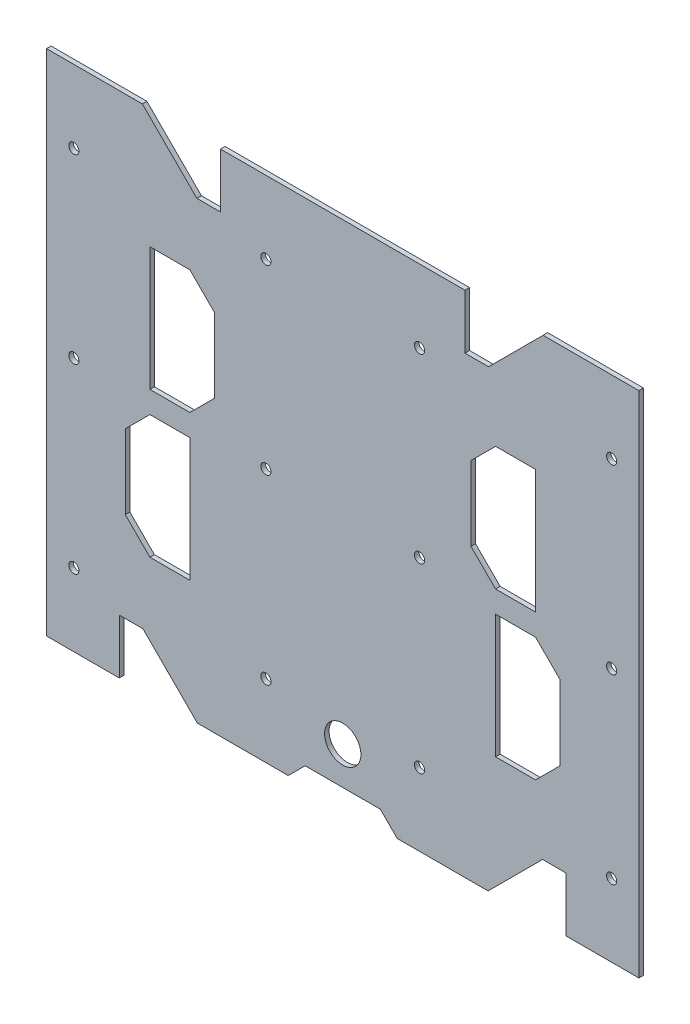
ISO-10303-21;
HEADER;
FILE_DESCRIPTION(('STEP AP214'),'2;1');
FILE_NAME('part.step','',(''),(''),'','','');
FILE_SCHEMA(('AUTOMOTIVE_DESIGN { 1 0 10303 214 1 1 1 1 }'));
ENDSEC;
DATA;
#1=APPLICATION_CONTEXT('core data for automotive mechanical design processes');
#2=APPLICATION_PROTOCOL_DEFINITION('international standard','automotive_design',2000,#1);
#3=PRODUCT_CONTEXT('',#1,'mechanical');
#4=PRODUCT('Part','Part','',(#3));
#5=PRODUCT_RELATED_PRODUCT_CATEGORY('part','',(#4));
#6=PRODUCT_DEFINITION_FORMATION('','',#4);
#7=PRODUCT_DEFINITION_CONTEXT('part definition',#1,'design');
#8=PRODUCT_DEFINITION('design','',#6,#7);
#9=PRODUCT_DEFINITION_SHAPE('','',#8);
#10=(LENGTH_UNIT() NAMED_UNIT(*) SI_UNIT(.MILLI.,.METRE.));
#11=(NAMED_UNIT(*) PLANE_ANGLE_UNIT() SI_UNIT($,.RADIAN.));
#12=(NAMED_UNIT(*) SI_UNIT($,.STERADIAN.) SOLID_ANGLE_UNIT());
#13=UNCERTAINTY_MEASURE_WITH_UNIT(LENGTH_MEASURE(1.E-05),#10,'distance_accuracy_value','');
#14=(GEOMETRIC_REPRESENTATION_CONTEXT(3) GLOBAL_UNCERTAINTY_ASSIGNED_CONTEXT((#13)) GLOBAL_UNIT_ASSIGNED_CONTEXT((#10,
#11,#12)) REPRESENTATION_CONTEXT('',''));
#15=CARTESIAN_POINT('',(0.,0.,0.));
#16=DIRECTION('',(0.,0.,1.));
#17=DIRECTION('',(1.,0.,0.));
#18=AXIS2_PLACEMENT_3D('',#15,#16,#17);
#19=CARTESIAN_POINT('',(-103.505,-88.9,-1.5875));
#20=DIRECTION('',(0.,-1.,0.));
#21=DIRECTION('',(0.,0.,-1.));
#22=AXIS2_PLACEMENT_3D('',#19,#20,#21);
#23=PLANE('',#22);
#24=DIRECTION('',(0.,0.,1.));
#25=VECTOR('',#24,1.);
#26=CARTESIAN_POINT('',(-78.105,-88.8999999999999,-1.5875));
#27=LINE('',#26,#25);
#28=CARTESIAN_POINT('',(-78.105,-88.8999999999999,-1.5875));
#29=VERTEX_POINT('',#28);
#30=CARTESIAN_POINT('',(-78.105,-88.8999999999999,0.));
#31=VERTEX_POINT('',#30);
#32=EDGE_CURVE('E1584',#29,#31,#27,.T.);
#33=ORIENTED_EDGE('',*,*,#32,.T.);
#34=DIRECTION('',(1.,0.,0.));
#35=VECTOR('',#34,1.);
#36=CARTESIAN_POINT('',(-103.505,-88.9,0.));
#37=LINE('',#36,#35);
#38=CARTESIAN_POINT('',(-103.505,-88.9,0.));
#39=VERTEX_POINT('',#38);
#40=EDGE_CURVE('E399',#39,#31,#37,.T.);
#41=ORIENTED_EDGE('',*,*,#40,.F.);
#42=DIRECTION('',(0.,0.,1.));
#43=VECTOR('',#42,1.);
#44=CARTESIAN_POINT('',(-103.505,-88.9,-1.5875));
#45=LINE('',#44,#43);
#46=CARTESIAN_POINT('',(-103.505,-88.9,-1.5875));
#47=VERTEX_POINT('',#46);
#48=EDGE_CURVE('E47',#47,#39,#45,.T.);
#49=ORIENTED_EDGE('',*,*,#48,.F.);
#50=DIRECTION('',(1.,0.,0.));
#51=VECTOR('',#50,1.);
#52=CARTESIAN_POINT('',(-103.505,-88.9,-1.5875));
#53=LINE('',#52,#51);
#54=EDGE_CURVE('E379',#47,#29,#53,.T.);
#55=ORIENTED_EDGE('',*,*,#54,.T.);
#56=EDGE_LOOP('',(#33,#41,#49,#55));
#57=FACE_BOUND('',#56,.T.);
#58=ADVANCED_FACE('F38',(#57),#23,.T.);
#59=DIRECTION('',(0.,0.,1.));
#60=VECTOR('',#59,1.);
#61=CARTESIAN_POINT('',(-50.8000000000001,-88.9,-1.5875));
#62=LINE('',#61,#60);
#63=CARTESIAN_POINT('',(-50.8000000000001,-88.9,-1.5875));
#64=VERTEX_POINT('',#63);
#65=CARTESIAN_POINT('',(-50.8000000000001,-88.9,0.));
#66=VERTEX_POINT('',#65);
#67=EDGE_CURVE('E1446',#64,#66,#62,.T.);
#68=ORIENTED_EDGE('',*,*,#67,.F.);
#69=CARTESIAN_POINT('',(-19.05,-88.9,-1.5875));
#70=VERTEX_POINT('',#69);
#71=EDGE_CURVE('E375',#64,#70,#53,.T.);
#72=ORIENTED_EDGE('',*,*,#71,.T.);
#73=DIRECTION('',(0.,0.,1.));
#74=VECTOR('',#73,1.);
#75=CARTESIAN_POINT('',(-19.05,-88.9,-1.5875));
#76=LINE('',#75,#74);
#77=CARTESIAN_POINT('',(-19.05,-88.9,0.));
#78=VERTEX_POINT('',#77);
#79=EDGE_CURVE('E1448',#70,#78,#76,.T.);
#80=ORIENTED_EDGE('',*,*,#79,.T.);
#81=EDGE_CURVE('E402',#66,#78,#37,.T.);
#82=ORIENTED_EDGE('',*,*,#81,.F.);
#83=EDGE_LOOP('',(#68,#72,#80,#82));
#84=FACE_BOUND('',#83,.T.);
#85=ADVANCED_FACE('F667',(#84),#23,.T.);
#86=DIRECTION('',(0.,0.,1.));
#87=VECTOR('',#86,1.);
#88=CARTESIAN_POINT('',(19.05,-88.9,-1.5875));
#89=LINE('',#88,#87);
#90=CARTESIAN_POINT('',(19.05,-88.9,-1.5875));
#91=VERTEX_POINT('',#90);
#92=CARTESIAN_POINT('',(19.05,-88.9,0.));
#93=VERTEX_POINT('',#92);
#94=EDGE_CURVE('E348',#91,#93,#89,.T.);
#95=ORIENTED_EDGE('',*,*,#94,.F.);
#96=CARTESIAN_POINT('',(50.8000000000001,-88.9,-1.5875));
#97=VERTEX_POINT('',#96);
#98=EDGE_CURVE('E363',#91,#97,#53,.T.);
#99=ORIENTED_EDGE('',*,*,#98,.T.);
#100=DIRECTION('',(0.,0.,1.));
#101=VECTOR('',#100,1.);
#102=CARTESIAN_POINT('',(50.8000000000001,-88.9,-1.5875));
#103=LINE('',#102,#101);
#104=CARTESIAN_POINT('',(50.8000000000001,-88.9,0.));
#105=VERTEX_POINT('',#104);
#106=EDGE_CURVE('E1429',#97,#105,#103,.T.);
#107=ORIENTED_EDGE('',*,*,#106,.T.);
#108=EDGE_CURVE('E365',#93,#105,#37,.T.);
#109=ORIENTED_EDGE('',*,*,#108,.F.);
#110=EDGE_LOOP('',(#95,#99,#107,#109));
#111=FACE_BOUND('',#110,.T.);
#112=ADVANCED_FACE('F361',(#111),#23,.T.);
#113=CARTESIAN_POINT('',(-103.505,88.9,-1.5875));
#114=DIRECTION('',(0.,1.,0.));
#115=DIRECTION('',(0.,0.,1.));
#116=AXIS2_PLACEMENT_3D('',#113,#114,#115);
#117=PLANE('',#116);
#118=DIRECTION('',(0.,0.,1.));
#119=VECTOR('',#118,1.);
#120=CARTESIAN_POINT('',(-42.7227999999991,88.8999999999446,-1.5875));
#121=LINE('',#120,#119);
#122=CARTESIAN_POINT('',(-42.7227999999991,88.8999999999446,-1.5875));
#123=VERTEX_POINT('',#122);
#124=CARTESIAN_POINT('',(-42.7227999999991,88.8999999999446,0.));
#125=VERTEX_POINT('',#124);
#126=EDGE_CURVE('E447',#123,#125,#121,.T.);
#127=ORIENTED_EDGE('',*,*,#126,.T.);
#128=DIRECTION('',(-1.,0.,0.));
#129=VECTOR('',#128,1.);
#130=CARTESIAN_POINT('',(-103.505,88.9,0.));
#131=LINE('',#130,#129);
#132=CARTESIAN_POINT('',(42.7227999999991,88.8999999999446,0.));
#133=VERTEX_POINT('',#132);
#134=EDGE_CURVE('E395',#133,#125,#131,.T.);
#135=ORIENTED_EDGE('',*,*,#134,.F.);
#136=DIRECTION('',(0.,0.,1.));
#137=VECTOR('',#136,1.);
#138=CARTESIAN_POINT('',(42.7227999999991,88.8999999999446,-1.5875));
#139=LINE('',#138,#137);
#140=CARTESIAN_POINT('',(42.7227999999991,88.8999999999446,-1.5875));
#141=VERTEX_POINT('',#140);
#142=EDGE_CURVE('E449',#141,#133,#139,.T.);
#143=ORIENTED_EDGE('',*,*,#142,.F.);
#144=DIRECTION('',(-1.,0.,0.));
#145=VECTOR('',#144,1.);
#146=CARTESIAN_POINT('',(-103.505,88.9,-1.5875));
#147=LINE('',#146,#145);
#148=EDGE_CURVE('E436',#141,#123,#147,.T.);
#149=ORIENTED_EDGE('',*,*,#148,.T.);
#150=EDGE_LOOP('',(#127,#135,#143,#149));
#151=FACE_BOUND('',#150,.T.);
#152=ADVANCED_FACE('F445',(#151),#117,.T.);
#153=DIRECTION('',(0.,0.,1.));
#154=VECTOR('',#153,1.);
#155=CARTESIAN_POINT('',(-70.0277999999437,88.9,-1.5875));
#156=LINE('',#155,#154);
#157=CARTESIAN_POINT('',(-70.0277999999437,88.9,-1.5875));
#158=VERTEX_POINT('',#157);
#159=CARTESIAN_POINT('',(-70.0277999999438,88.9,0.));
#160=VERTEX_POINT('',#159);
#161=EDGE_CURVE('E461',#158,#160,#156,.T.);
#162=ORIENTED_EDGE('',*,*,#161,.F.);
#163=CARTESIAN_POINT('',(-103.505,88.9,-1.5875));
#164=VERTEX_POINT('',#163);
#165=EDGE_CURVE('E434',#158,#164,#147,.T.);
#166=ORIENTED_EDGE('',*,*,#165,.T.);
#167=DIRECTION('',(0.,0.,1.));
#168=VECTOR('',#167,1.);
#169=CARTESIAN_POINT('',(-103.505,88.9,-1.5875));
#170=LINE('',#169,#168);
#171=CARTESIAN_POINT('',(-103.505,88.9,0.));
#172=VERTEX_POINT('',#171);
#173=EDGE_CURVE('E405',#164,#172,#170,.T.);
#174=ORIENTED_EDGE('',*,*,#173,.T.);
#175=EDGE_CURVE('E389',#160,#172,#131,.T.);
#176=ORIENTED_EDGE('',*,*,#175,.F.);
#177=EDGE_LOOP('',(#162,#166,#174,#176));
#178=FACE_BOUND('',#177,.T.);
#179=ADVANCED_FACE('F682',(#178),#117,.T.);
#180=CARTESIAN_POINT('',(103.505,-88.9,-1.5875));
#181=DIRECTION('',(1.,0.,0.));
#182=DIRECTION('',(0.,0.,-1.));
#183=AXIS2_PLACEMENT_3D('',#180,#181,#182);
#184=PLANE('',#183);
#185=DIRECTION('',(0.,1.,0.));
#186=VECTOR('',#185,1.);
#187=CARTESIAN_POINT('',(103.505,-88.9,0.));
#188=LINE('',#187,#186);
#189=CARTESIAN_POINT('',(103.505,-88.9,0.));
#190=VERTEX_POINT('',#189);
#191=CARTESIAN_POINT('',(103.505,88.9,0.));
#192=VERTEX_POINT('',#191);
#193=EDGE_CURVE('E386',#190,#192,#188,.T.);
#194=ORIENTED_EDGE('',*,*,#193,.F.);
#195=DIRECTION('',(0.,0.,1.));
#196=VECTOR('',#195,1.);
#197=CARTESIAN_POINT('',(103.505,-88.9,-1.5875));
#198=LINE('',#197,#196);
#199=CARTESIAN_POINT('',(103.505,-88.9,-1.5875));
#200=VERTEX_POINT('',#199);
#201=EDGE_CURVE('E11',#200,#190,#198,.T.);
#202=ORIENTED_EDGE('',*,*,#201,.F.);
#203=DIRECTION('',(0.,1.,0.));
#204=VECTOR('',#203,1.);
#205=CARTESIAN_POINT('',(103.505,-88.9,-1.5875));
#206=LINE('',#205,#204);
#207=CARTESIAN_POINT('',(103.505,88.9,-1.5875));
#208=VERTEX_POINT('',#207);
#209=EDGE_CURVE('E401',#200,#208,#206,.T.);
#210=ORIENTED_EDGE('',*,*,#209,.T.);
#211=DIRECTION('',(0.,0.,1.));
#212=VECTOR('',#211,1.);
#213=CARTESIAN_POINT('',(103.505,88.9,-1.5875));
#214=LINE('',#213,#212);
#215=EDGE_CURVE('E384',#208,#192,#214,.T.);
#216=ORIENTED_EDGE('',*,*,#215,.T.);
#217=EDGE_LOOP('',(#194,#202,#210,#216));
#218=FACE_BOUND('',#217,.T.);
#219=ADVANCED_FACE('F40',(#218),#184,.T.);
#220=DIRECTION('',(0.,0.,1.));
#221=VECTOR('',#220,1.);
#222=CARTESIAN_POINT('',(78.105,-88.8999999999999,-1.5875));
#223=LINE('',#222,#221);
#224=CARTESIAN_POINT('',(78.105,-88.8999999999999,-1.5875));
#225=VERTEX_POINT('',#224);
#226=CARTESIAN_POINT('',(78.105,-88.9,0.));
#227=VERTEX_POINT('',#226);
#228=EDGE_CURVE('E1433',#225,#227,#223,.T.);
#229=ORIENTED_EDGE('',*,*,#228,.F.);
#230=EDGE_CURVE('E376',#225,#200,#53,.T.);
#231=ORIENTED_EDGE('',*,*,#230,.T.);
#232=ORIENTED_EDGE('',*,*,#201,.T.);
#233=EDGE_CURVE('E398',#227,#190,#37,.T.);
#234=ORIENTED_EDGE('',*,*,#233,.F.);
#235=EDGE_LOOP('',(#229,#231,#232,#234));
#236=FACE_BOUND('',#235,.T.);
#237=ADVANCED_FACE('F429',(#236),#23,.T.);
#238=CARTESIAN_POINT('',(-103.505,-88.9,-1.5875));
#239=DIRECTION('',(-1.,0.,0.));
#240=DIRECTION('',(0.,0.,1.));
#241=AXIS2_PLACEMENT_3D('',#238,#239,#240);
#242=PLANE('',#241);
#243=DIRECTION('',(0.,-1.,0.));
#244=VECTOR('',#243,1.);
#245=CARTESIAN_POINT('',(-103.505,-88.9,0.));
#246=LINE('',#245,#244);
#247=EDGE_CURVE('E394',#172,#39,#246,.T.);
#248=ORIENTED_EDGE('',*,*,#247,.F.);
#249=ORIENTED_EDGE('',*,*,#173,.F.);
#250=DIRECTION('',(0.,-1.,0.));
#251=VECTOR('',#250,1.);
#252=CARTESIAN_POINT('',(-103.505,-88.9,-1.5875));
#253=LINE('',#252,#251);
#254=EDGE_CURVE('E380',#164,#47,#253,.T.);
#255=ORIENTED_EDGE('',*,*,#254,.T.);
#256=ORIENTED_EDGE('',*,*,#48,.T.);
#257=EDGE_LOOP('',(#248,#249,#255,#256));
#258=FACE_BOUND('',#257,.T.);
#259=ADVANCED_FACE('F676',(#258),#242,.T.);
#260=DIRECTION('',(0.,0.,1.));
#261=VECTOR('',#260,1.);
#262=CARTESIAN_POINT('',(70.0277999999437,88.9,-1.5875));
#263=LINE('',#262,#261);
#264=CARTESIAN_POINT('',(70.0277999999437,88.9,-1.5875));
#265=VERTEX_POINT('',#264);
#266=CARTESIAN_POINT('',(70.0277999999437,88.9,0.));
#267=VERTEX_POINT('',#266);
#268=EDGE_CURVE('E418',#265,#267,#263,.T.);
#269=ORIENTED_EDGE('',*,*,#268,.T.);
#270=EDGE_CURVE('E391',#192,#267,#131,.T.);
#271=ORIENTED_EDGE('',*,*,#270,.F.);
#272=ORIENTED_EDGE('',*,*,#215,.F.);
#273=EDGE_CURVE('E433',#208,#265,#147,.T.);
#274=ORIENTED_EDGE('',*,*,#273,.T.);
#275=EDGE_LOOP('',(#269,#271,#272,#274));
#276=FACE_BOUND('',#275,.T.);
#277=ADVANCED_FACE('F417',(#276),#117,.T.);
#278=CARTESIAN_POINT('',(0.,0.,-1.5875));
#279=DIRECTION('',(0.,0.,-1.));
#280=DIRECTION('',(-1.,0.,0.));
#281=AXIS2_PLACEMENT_3D('',#278,#279,#280);
#282=PLANE('',#281);
#283=CARTESIAN_POINT('',(0.,-69.8500000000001,-1.5875));
#284=DIRECTION('',(0.,0.,-1.));
#285=DIRECTION('',(-1.,0.,0.));
#286=AXIS2_PLACEMENT_3D('',#283,#284,#285);
#287=CIRCLE('',#286,6.35);
#288=CARTESIAN_POINT('',(-6.34999999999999,-69.8500000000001,-1.5875));
#289=VERTEX_POINT('',#288);
#290=EDGE_CURVE('E1482',#289,#289,#287,.F.);
#291=ORIENTED_EDGE('',*,*,#290,.T.);
#292=EDGE_LOOP('',(#291));
#293=FACE_BOUND('',#292,.T.);
#294=DIRECTION('',(-1.,0.,0.));
#295=VECTOR('',#294,1.);
#296=CARTESIAN_POINT('',(-53.4288999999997,-3.80999999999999,-1.5875));
#297=LINE('',#296,#295);
#298=CARTESIAN_POINT('',(-53.4288999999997,-3.80999999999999,-1.5875));
#299=VERTEX_POINT('',#298);
#300=CARTESIAN_POINT('',(-67.3988999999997,-3.80999999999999,-1.5875));
#301=VERTEX_POINT('',#300);
#302=EDGE_CURVE('E1563',#299,#301,#297,.T.);
#303=ORIENTED_EDGE('',*,*,#302,.T.);
#304=DIRECTION('',(-0.707106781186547,-0.707106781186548,0.));
#305=VECTOR('',#304,1.);
#306=CARTESIAN_POINT('',(-67.3988999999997,-3.80999999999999,-1.5875));
#307=LINE('',#306,#305);
#308=CARTESIAN_POINT('',(-76.0031499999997,-12.41425,-1.5875));
#309=VERTEX_POINT('',#308);
#310=EDGE_CURVE('E1566',#301,#309,#307,.T.);
#311=ORIENTED_EDGE('',*,*,#310,.T.);
#312=DIRECTION('',(0.,-1.,0.));
#313=VECTOR('',#312,1.);
#314=CARTESIAN_POINT('',(-76.0031499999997,-12.41425,-1.5875));
#315=LINE('',#314,#313);
#316=CARTESIAN_POINT('',(-76.0031499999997,-38.38575,-1.5875));
#317=VERTEX_POINT('',#316);
#318=EDGE_CURVE('E55',#309,#317,#315,.T.);
#319=ORIENTED_EDGE('',*,*,#318,.T.);
#320=DIRECTION('',(0.707106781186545,-0.70710678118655,0.));
#321=VECTOR('',#320,1.);
#322=CARTESIAN_POINT('',(-76.0031499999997,-38.38575,-1.5875));
#323=LINE('',#322,#321);
#324=CARTESIAN_POINT('',(-67.3988999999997,-46.99,-1.5875));
#325=VERTEX_POINT('',#324);
#326=EDGE_CURVE('E1571',#317,#325,#323,.T.);
#327=ORIENTED_EDGE('',*,*,#326,.T.);
#328=DIRECTION('',(1.,0.,0.));
#329=VECTOR('',#328,1.);
#330=CARTESIAN_POINT('',(-67.3988999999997,-46.99,-1.5875));
#331=LINE('',#330,#329);
#332=CARTESIAN_POINT('',(-53.4288999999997,-46.99,-1.5875));
#333=VERTEX_POINT('',#332);
#334=EDGE_CURVE('E1574',#325,#333,#331,.T.);
#335=ORIENTED_EDGE('',*,*,#334,.T.);
#336=DIRECTION('',(0.,1.,0.));
#337=VECTOR('',#336,1.);
#338=CARTESIAN_POINT('',(-53.4288999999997,-46.99,-1.5875));
#339=LINE('',#338,#337);
#340=EDGE_CURVE('E1577',#333,#299,#339,.T.);
#341=ORIENTED_EDGE('',*,*,#340,.T.);
#342=EDGE_LOOP('',(#303,#311,#319,#327,#335,#341));
#343=FACE_BOUND('',#342,.T.);
#344=DIRECTION('',(0.,-1.,0.));
#345=VECTOR('',#344,1.);
#346=CARTESIAN_POINT('',(-78.105,-88.8999999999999,-1.5875));
#347=LINE('',#346,#345);
#348=CARTESIAN_POINT('',(-78.105,-69.85,-1.5875));
#349=VERTEX_POINT('',#348);
#350=EDGE_CURVE('E1616',#349,#29,#347,.T.);
#351=ORIENTED_EDGE('',*,*,#350,.T.);
#352=ORIENTED_EDGE('',*,*,#54,.F.);
#353=ORIENTED_EDGE('',*,*,#254,.F.);
#354=ORIENTED_EDGE('',*,*,#165,.F.);
#355=DIRECTION('',(0.707106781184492,-0.707106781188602,0.));
#356=VECTOR('',#355,1.);
#357=CARTESIAN_POINT('',(-50.9777999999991,69.8499999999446,-1.5875));
#358=LINE('',#357,#356);
#359=CARTESIAN_POINT('',(-50.9777999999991,69.8499999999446,-1.5875));
#360=VERTEX_POINT('',#359);
#361=EDGE_CURVE('E465',#158,#360,#358,.T.);
#362=ORIENTED_EDGE('',*,*,#361,.T.);
#363=DIRECTION('',(1.,0.,0.));
#364=VECTOR('',#363,1.);
#365=CARTESIAN_POINT('',(-42.7227999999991,69.8499999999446,-1.5875));
#366=LINE('',#365,#364);
#367=CARTESIAN_POINT('',(-42.7227999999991,69.8499999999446,-1.5875));
#368=VERTEX_POINT('',#367);
#369=EDGE_CURVE('E459',#360,#368,#366,.T.);
#370=ORIENTED_EDGE('',*,*,#369,.T.);
#371=DIRECTION('',(0.,1.,0.));
#372=VECTOR('',#371,1.);
#373=CARTESIAN_POINT('',(-42.7227999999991,88.8999999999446,-1.5875));
#374=LINE('',#373,#372);
#375=EDGE_CURVE('E456',#368,#123,#374,.T.);
#376=ORIENTED_EDGE('',*,*,#375,.T.);
#377=ORIENTED_EDGE('',*,*,#148,.F.);
#378=DIRECTION('',(0.,-1.,0.));
#379=VECTOR('',#378,1.);
#380=CARTESIAN_POINT('',(42.7227999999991,88.8999999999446,-1.5875));
#381=LINE('',#380,#379);
#382=CARTESIAN_POINT('',(42.7227999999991,69.8499999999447,-1.5875));
#383=VERTEX_POINT('',#382);
#384=EDGE_CURVE('E453',#141,#383,#381,.T.);
#385=ORIENTED_EDGE('',*,*,#384,.T.);
#386=DIRECTION('',(1.,0.,0.));
#387=VECTOR('',#386,1.);
#388=CARTESIAN_POINT('',(42.7227999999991,69.8499999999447,-1.5875));
#389=LINE('',#388,#387);
#390=CARTESIAN_POINT('',(50.9777999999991,69.8499999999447,-1.5875));
#391=VERTEX_POINT('',#390);
#392=EDGE_CURVE('E483',#383,#391,#389,.T.);
#393=ORIENTED_EDGE('',*,*,#392,.T.);
#394=DIRECTION('',(0.707106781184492,0.707106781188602,0.));
#395=VECTOR('',#394,1.);
#396=CARTESIAN_POINT('',(50.9777999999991,69.8499999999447,-1.5875));
#397=LINE('',#396,#395);
#398=EDGE_CURVE('E486',#391,#265,#397,.T.);
#399=ORIENTED_EDGE('',*,*,#398,.T.);
#400=ORIENTED_EDGE('',*,*,#273,.F.);
#401=ORIENTED_EDGE('',*,*,#209,.F.);
#402=ORIENTED_EDGE('',*,*,#230,.F.);
#403=DIRECTION('',(0.,1.,0.));
#404=VECTOR('',#403,1.);
#405=CARTESIAN_POINT('',(78.105,-88.8999999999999,-1.5875));
#406=LINE('',#405,#404);
#407=CARTESIAN_POINT('',(78.105,-69.85,-1.5875));
#408=VERTEX_POINT('',#407);
#409=EDGE_CURVE('E1509',#225,#408,#406,.T.);
#410=ORIENTED_EDGE('',*,*,#409,.T.);
#411=DIRECTION('',(-1.,0.,0.));
#412=VECTOR('',#411,1.);
#413=CARTESIAN_POINT('',(78.105,-69.85,-1.5875));
#414=LINE('',#413,#412);
#415=CARTESIAN_POINT('',(69.85,-69.85,-1.5875));
#416=VERTEX_POINT('',#415);
#417=EDGE_CURVE('E1434',#408,#416,#414,.T.);
#418=ORIENTED_EDGE('',*,*,#417,.T.);
#419=DIRECTION('',(-0.707106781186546,-0.707106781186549,0.));
#420=VECTOR('',#419,1.);
#421=CARTESIAN_POINT('',(69.85,-69.85,-1.5875));
#422=LINE('',#421,#420);
#423=EDGE_CURVE('E374',#416,#97,#422,.T.);
#424=ORIENTED_EDGE('',*,*,#423,.T.);
#425=ORIENTED_EDGE('',*,*,#98,.F.);
#426=DIRECTION('',(-0.707106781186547,0.707106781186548,0.));
#427=VECTOR('',#426,1.);
#428=CARTESIAN_POINT('',(13.1383466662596,-82.9883466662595,-1.5875));
#429=LINE('',#428,#427);
#430=CARTESIAN_POINT('',(13.1383466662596,-82.9883466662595,-1.5875));
#431=VERTEX_POINT('',#430);
#432=EDGE_CURVE('E344',#91,#431,#429,.T.);
#433=ORIENTED_EDGE('',*,*,#432,.T.);
#434=DIRECTION('',(-1.,0.,0.));
#435=VECTOR('',#434,1.);
#436=CARTESIAN_POINT('',(-13.1383466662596,-82.9883466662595,-1.5875));
#437=LINE('',#436,#435);
#438=CARTESIAN_POINT('',(-13.1383466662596,-82.9883466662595,-1.5875));
#439=VERTEX_POINT('',#438);
#440=EDGE_CURVE('E355',#431,#439,#437,.T.);
#441=ORIENTED_EDGE('',*,*,#440,.T.);
#442=DIRECTION('',(-0.707106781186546,-0.707106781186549,0.));
#443=VECTOR('',#442,1.);
#444=CARTESIAN_POINT('',(-19.05,-88.9,-1.5875));
#445=LINE('',#444,#443);
#446=EDGE_CURVE('E366',#439,#70,#445,.T.);
#447=ORIENTED_EDGE('',*,*,#446,.T.);
#448=ORIENTED_EDGE('',*,*,#71,.F.);
#449=DIRECTION('',(-0.707106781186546,0.707106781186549,0.));
#450=VECTOR('',#449,1.);
#451=CARTESIAN_POINT('',(-69.85,-69.85,-1.5875));
#452=LINE('',#451,#450);
#453=CARTESIAN_POINT('',(-69.85,-69.85,-1.5875));
#454=VERTEX_POINT('',#453);
#455=EDGE_CURVE('E1609',#64,#454,#452,.T.);
#456=ORIENTED_EDGE('',*,*,#455,.T.);
#457=DIRECTION('',(-1.,0.,0.));
#458=VECTOR('',#457,1.);
#459=CARTESIAN_POINT('',(-78.105,-69.85,-1.5875));
#460=LINE('',#459,#458);
#461=EDGE_CURVE('E1612',#454,#349,#460,.T.);
#462=ORIENTED_EDGE('',*,*,#461,.T.);
#463=EDGE_LOOP('',(#351,#352,#353,#354,#362,#370,#376,#377,#385,#393,#399,#400,#401,#402,#410,
#418,#424,#425,#433,#441,#447,#448,#456,#462));
#464=FACE_BOUND('',#463,.T.);
#465=DIRECTION('',(0.,-1.,0.));
#466=VECTOR('',#465,1.);
#467=CARTESIAN_POINT('',(53.4288999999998,-46.99,-1.5875));
#468=LINE('',#467,#466);
#469=CARTESIAN_POINT('',(53.4288999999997,-3.80999999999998,-1.5875));
#470=VERTEX_POINT('',#469);
#471=CARTESIAN_POINT('',(53.4288999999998,-46.99,-1.5875));
#472=VERTEX_POINT('',#471);
#473=EDGE_CURVE('E1461',#470,#472,#468,.T.);
#474=ORIENTED_EDGE('',*,*,#473,.T.);
#475=DIRECTION('',(1.,0.,0.));
#476=VECTOR('',#475,1.);
#477=CARTESIAN_POINT('',(67.3988999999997,-46.99,-1.5875));
#478=LINE('',#477,#476);
#479=CARTESIAN_POINT('',(67.3988999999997,-46.99,-1.5875));
#480=VERTEX_POINT('',#479);
#481=EDGE_CURVE('E1464',#472,#480,#478,.T.);
#482=ORIENTED_EDGE('',*,*,#481,.T.);
#483=DIRECTION('',(0.707106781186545,0.70710678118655,0.));
#484=VECTOR('',#483,1.);
#485=CARTESIAN_POINT('',(76.0031499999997,-38.3857499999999,-1.5875));
#486=LINE('',#485,#484);
#487=CARTESIAN_POINT('',(76.0031499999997,-38.3857499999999,-1.5875));
#488=VERTEX_POINT('',#487);
#489=EDGE_CURVE('E63',#480,#488,#486,.T.);
#490=ORIENTED_EDGE('',*,*,#489,.T.);
#491=DIRECTION('',(0.,1.,0.));
#492=VECTOR('',#491,1.);
#493=CARTESIAN_POINT('',(76.0031499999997,-12.41425,-1.5875));
#494=LINE('',#493,#492);
#495=CARTESIAN_POINT('',(76.0031499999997,-12.41425,-1.5875));
#496=VERTEX_POINT('',#495);
#497=EDGE_CURVE('E1469',#488,#496,#494,.T.);
#498=ORIENTED_EDGE('',*,*,#497,.T.);
#499=DIRECTION('',(-0.707106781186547,0.707106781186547,0.));
#500=VECTOR('',#499,1.);
#501=CARTESIAN_POINT('',(67.3988999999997,-3.80999999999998,-1.5875));
#502=LINE('',#501,#500);
#503=CARTESIAN_POINT('',(67.3988999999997,-3.80999999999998,-1.5875));
#504=VERTEX_POINT('',#503);
#505=EDGE_CURVE('E1472',#496,#504,#502,.T.);
#506=ORIENTED_EDGE('',*,*,#505,.T.);
#507=DIRECTION('',(-1.,0.,0.));
#508=VECTOR('',#507,1.);
#509=CARTESIAN_POINT('',(53.4288999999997,-3.80999999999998,-1.5875));
#510=LINE('',#509,#508);
#511=EDGE_CURVE('E1475',#504,#470,#510,.T.);
#512=ORIENTED_EDGE('',*,*,#511,.T.);
#513=EDGE_LOOP('',(#474,#482,#490,#498,#506,#512));
#514=FACE_BOUND('',#513,.T.);
#515=DIRECTION('',(-0.707106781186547,-0.707106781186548,0.));
#516=VECTOR('',#515,1.);
#517=CARTESIAN_POINT('',(53.4288999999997,46.99,-1.5875));
#518=LINE('',#517,#516);
#519=CARTESIAN_POINT('',(53.4288999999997,46.99,-1.5875));
#520=VERTEX_POINT('',#519);
#521=CARTESIAN_POINT('',(44.8246499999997,38.38575,-1.5875));
#522=VERTEX_POINT('',#521);
#523=EDGE_CURVE('E1519',#520,#522,#518,.T.);
#524=ORIENTED_EDGE('',*,*,#523,.T.);
#525=DIRECTION('',(0.,-1.,0.));
#526=VECTOR('',#525,1.);
#527=CARTESIAN_POINT('',(44.8246499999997,38.38575,-1.5875));
#528=LINE('',#527,#526);
#529=CARTESIAN_POINT('',(44.8246499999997,12.41425,-1.5875));
#530=VERTEX_POINT('',#529);
#531=EDGE_CURVE('E1522',#522,#530,#528,.T.);
#532=ORIENTED_EDGE('',*,*,#531,.T.);
#533=DIRECTION('',(0.707106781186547,-0.707106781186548,0.));
#534=VECTOR('',#533,1.);
#535=CARTESIAN_POINT('',(44.8246499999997,12.41425,-1.5875));
#536=LINE('',#535,#534);
#537=CARTESIAN_POINT('',(53.4288999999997,3.80999999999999,-1.5875));
#538=VERTEX_POINT('',#537);
#539=EDGE_CURVE('E1526',#530,#538,#536,.T.);
#540=ORIENTED_EDGE('',*,*,#539,.T.);
#541=DIRECTION('',(1.,0.,0.));
#542=VECTOR('',#541,1.);
#543=CARTESIAN_POINT('',(67.3988999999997,3.81,-1.5875));
#544=LINE('',#543,#542);
#545=CARTESIAN_POINT('',(67.3988999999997,3.81,-1.5875));
#546=VERTEX_POINT('',#545);
#547=EDGE_CURVE('E1529',#538,#546,#544,.T.);
#548=ORIENTED_EDGE('',*,*,#547,.T.);
#549=DIRECTION('',(0.,1.,0.));
#550=VECTOR('',#549,1.);
#551=CARTESIAN_POINT('',(67.3988999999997,46.99,-1.5875));
#552=LINE('',#551,#550);
#553=CARTESIAN_POINT('',(67.3988999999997,46.99,-1.5875));
#554=VERTEX_POINT('',#553);
#555=EDGE_CURVE('E1532',#546,#554,#552,.T.);
#556=ORIENTED_EDGE('',*,*,#555,.T.);
#557=DIRECTION('',(-1.,0.,0.));
#558=VECTOR('',#557,1.);
#559=CARTESIAN_POINT('',(67.3988999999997,46.99,-1.5875));
#560=LINE('',#559,#558);
#561=EDGE_CURVE('E1535',#554,#520,#560,.T.);
#562=ORIENTED_EDGE('',*,*,#561,.T.);
#563=EDGE_LOOP('',(#524,#532,#540,#548,#556,#562));
#564=FACE_BOUND('',#563,.T.);
#565=DIRECTION('',(0.,-1.,0.));
#566=VECTOR('',#565,1.);
#567=CARTESIAN_POINT('',(-67.3988999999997,46.99,-1.5875));
#568=LINE('',#567,#566);
#569=CARTESIAN_POINT('',(-67.3988999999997,46.99,-1.5875));
#570=VERTEX_POINT('',#569);
#571=CARTESIAN_POINT('',(-67.3988999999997,3.80999999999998,-1.5875));
#572=VERTEX_POINT('',#571);
#573=EDGE_CURVE('E502',#570,#572,#568,.T.);
#574=ORIENTED_EDGE('',*,*,#573,.T.);
#575=DIRECTION('',(1.,0.,0.));
#576=VECTOR('',#575,1.);
#577=CARTESIAN_POINT('',(-67.3988999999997,3.80999999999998,-1.5875));
#578=LINE('',#577,#576);
#579=CARTESIAN_POINT('',(-53.4288999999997,3.80999999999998,-1.5875));
#580=VERTEX_POINT('',#579);
#581=EDGE_CURVE('E505',#572,#580,#578,.T.);
#582=ORIENTED_EDGE('',*,*,#581,.T.);
#583=DIRECTION('',(0.707106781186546,0.707106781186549,0.));
#584=VECTOR('',#583,1.);
#585=CARTESIAN_POINT('',(-44.8246499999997,12.41425,-1.5875));
#586=LINE('',#585,#584);
#587=CARTESIAN_POINT('',(-44.8246499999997,12.41425,-1.5875));
#588=VERTEX_POINT('',#587);
#589=EDGE_CURVE('E509',#580,#588,#586,.T.);
#590=ORIENTED_EDGE('',*,*,#589,.T.);
#591=DIRECTION('',(0.,1.,0.));
#592=VECTOR('',#591,1.);
#593=CARTESIAN_POINT('',(-44.8246499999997,38.3857499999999,-1.5875));
#594=LINE('',#593,#592);
#595=CARTESIAN_POINT('',(-44.8246499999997,38.3857499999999,-1.5875));
#596=VERTEX_POINT('',#595);
#597=EDGE_CURVE('E512',#588,#596,#594,.T.);
#598=ORIENTED_EDGE('',*,*,#597,.T.);
#599=DIRECTION('',(-0.707106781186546,0.707106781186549,0.));
#600=VECTOR('',#599,1.);
#601=CARTESIAN_POINT('',(-53.4288999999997,46.99,-1.5875));
#602=LINE('',#601,#600);
#603=CARTESIAN_POINT('',(-53.4288999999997,46.99,-1.5875));
#604=VERTEX_POINT('',#603);
#605=EDGE_CURVE('E515',#596,#604,#602,.T.);
#606=ORIENTED_EDGE('',*,*,#605,.T.);
#607=DIRECTION('',(-1.,0.,0.));
#608=VECTOR('',#607,1.);
#609=CARTESIAN_POINT('',(-67.3988999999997,46.99,-1.5875));
#610=LINE('',#609,#608);
#611=EDGE_CURVE('E518',#604,#570,#610,.T.);
#612=ORIENTED_EDGE('',*,*,#611,.T.);
#613=EDGE_LOOP('',(#574,#582,#590,#598,#606,#612));
#614=FACE_BOUND('',#613,.T.);
#615=CARTESIAN_POINT('',(-93.98,-63.5,-1.5875));
#616=DIRECTION('',(0.,0.,-1.));
#617=DIRECTION('',(-1.,0.,0.));
#618=AXIS2_PLACEMENT_3D('',#615,#616,#617);
#619=CIRCLE('',#618,1.778);
#620=CARTESIAN_POINT('',(-92.202,-63.5,-1.5875));
#621=VERTEX_POINT('',#620);
#622=EDGE_CURVE('E390',#621,#621,#619,.T.);
#623=ORIENTED_EDGE('',*,*,#622,.F.);
#624=EDGE_LOOP('',(#623));
#625=FACE_BOUND('',#624,.T.);
#626=CARTESIAN_POINT('',(93.98,-63.5,-1.5875));
#627=DIRECTION('',(0.,0.,-1.));
#628=DIRECTION('',(-1.,0.,0.));
#629=AXIS2_PLACEMENT_3D('',#626,#627,#628);
#630=CIRCLE('',#629,1.778);
#631=CARTESIAN_POINT('',(95.758,-63.5,-1.5875));
#632=VERTEX_POINT('',#631);
#633=EDGE_CURVE('E616',#632,#632,#630,.T.);
#634=ORIENTED_EDGE('',*,*,#633,.F.);
#635=EDGE_LOOP('',(#634));
#636=FACE_BOUND('',#635,.T.);
#637=CARTESIAN_POINT('',(26.8478,-63.5,-1.5875));
#638=DIRECTION('',(0.,0.,-1.));
#639=DIRECTION('',(-1.,0.,0.));
#640=AXIS2_PLACEMENT_3D('',#637,#638,#639);
#641=CIRCLE('',#640,1.77799999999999);
#642=CARTESIAN_POINT('',(28.6258,-63.5,-1.5875));
#643=VERTEX_POINT('',#642);
#644=EDGE_CURVE('E614',#643,#643,#641,.T.);
#645=ORIENTED_EDGE('',*,*,#644,.F.);
#646=EDGE_LOOP('',(#645));
#647=FACE_BOUND('',#646,.T.);
#648=CARTESIAN_POINT('',(26.8478,0.,-1.5875));
#649=DIRECTION('',(0.,0.,-1.));
#650=DIRECTION('',(-1.,0.,0.));
#651=AXIS2_PLACEMENT_3D('',#648,#649,#650);
#652=CIRCLE('',#651,1.77799999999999);
#653=CARTESIAN_POINT('',(28.6258,0.,-1.5875));
#654=VERTEX_POINT('',#653);
#655=EDGE_CURVE('E611',#654,#654,#652,.T.);
#656=ORIENTED_EDGE('',*,*,#655,.F.);
#657=EDGE_LOOP('',(#656));
#658=FACE_BOUND('',#657,.T.);
#659=CARTESIAN_POINT('',(-93.98,0.,-1.5875));
#660=DIRECTION('',(0.,0.,-1.));
#661=DIRECTION('',(-1.,0.,0.));
#662=AXIS2_PLACEMENT_3D('',#659,#660,#661);
#663=CIRCLE('',#662,1.77800000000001);
#664=CARTESIAN_POINT('',(-92.202,0.,-1.5875));
#665=VERTEX_POINT('',#664);
#666=EDGE_CURVE('E608',#665,#665,#663,.T.);
#667=ORIENTED_EDGE('',*,*,#666,.F.);
#668=EDGE_LOOP('',(#667));
#669=FACE_BOUND('',#668,.T.);
#670=CARTESIAN_POINT('',(-93.98,63.5,-1.5875));
#671=DIRECTION('',(0.,0.,-1.));
#672=DIRECTION('',(-1.,0.,0.));
#673=AXIS2_PLACEMENT_3D('',#670,#671,#672);
#674=CIRCLE('',#673,1.778);
#675=CARTESIAN_POINT('',(-92.202,63.5,-1.5875));
#676=VERTEX_POINT('',#675);
#677=EDGE_CURVE('E605',#676,#676,#674,.T.);
#678=ORIENTED_EDGE('',*,*,#677,.F.);
#679=EDGE_LOOP('',(#678));
#680=FACE_BOUND('',#679,.T.);
#681=CARTESIAN_POINT('',(-26.8478,-63.5,-1.5875));
#682=DIRECTION('',(0.,0.,-1.));
#683=DIRECTION('',(-1.,0.,0.));
#684=AXIS2_PLACEMENT_3D('',#681,#682,#683);
#685=CIRCLE('',#684,1.77799999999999);
#686=CARTESIAN_POINT('',(-25.0698,-63.5,-1.5875));
#687=VERTEX_POINT('',#686);
#688=EDGE_CURVE('E602',#687,#687,#685,.T.);
#689=ORIENTED_EDGE('',*,*,#688,.F.);
#690=EDGE_LOOP('',(#689));
#691=FACE_BOUND('',#690,.T.);
#692=CARTESIAN_POINT('',(-26.8478,0.,-1.5875));
#693=DIRECTION('',(0.,0.,-1.));
#694=DIRECTION('',(-1.,0.,0.));
#695=AXIS2_PLACEMENT_3D('',#692,#693,#694);
#696=CIRCLE('',#695,1.778);
#697=CARTESIAN_POINT('',(-25.0698,0.,-1.5875));
#698=VERTEX_POINT('',#697);
#699=EDGE_CURVE('E599',#698,#698,#696,.T.);
#700=ORIENTED_EDGE('',*,*,#699,.F.);
#701=EDGE_LOOP('',(#700));
#702=FACE_BOUND('',#701,.T.);
#703=CARTESIAN_POINT('',(93.98,63.5,-1.5875));
#704=DIRECTION('',(0.,0.,-1.));
#705=DIRECTION('',(-1.,0.,0.));
#706=AXIS2_PLACEMENT_3D('',#703,#704,#705);
#707=CIRCLE('',#706,1.778);
#708=CARTESIAN_POINT('',(95.758,63.5,-1.5875));
#709=VERTEX_POINT('',#708);
#710=EDGE_CURVE('E596',#709,#709,#707,.T.);
#711=ORIENTED_EDGE('',*,*,#710,.F.);
#712=EDGE_LOOP('',(#711));
#713=FACE_BOUND('',#712,.T.);
#714=CARTESIAN_POINT('',(26.8478,63.5,-1.5875));
#715=DIRECTION('',(0.,0.,-1.));
#716=DIRECTION('',(-1.,0.,0.));
#717=AXIS2_PLACEMENT_3D('',#714,#715,#716);
#718=CIRCLE('',#717,1.77799999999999);
#719=CARTESIAN_POINT('',(28.6258,63.5,-1.5875));
#720=VERTEX_POINT('',#719);
#721=EDGE_CURVE('E593',#720,#720,#718,.T.);
#722=ORIENTED_EDGE('',*,*,#721,.F.);
#723=EDGE_LOOP('',(#722));
#724=FACE_BOUND('',#723,.T.);
#725=CARTESIAN_POINT('',(93.98,0.,-1.5875));
#726=DIRECTION('',(0.,0.,-1.));
#727=DIRECTION('',(-1.,0.,0.));
#728=AXIS2_PLACEMENT_3D('',#725,#726,#727);
#729=CIRCLE('',#728,1.77800000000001);
#730=CARTESIAN_POINT('',(95.758,0.,-1.5875));
#731=VERTEX_POINT('',#730);
#732=EDGE_CURVE('E590',#731,#731,#729,.T.);
#733=ORIENTED_EDGE('',*,*,#732,.F.);
#734=EDGE_LOOP('',(#733));
#735=FACE_BOUND('',#734,.T.);
#736=CARTESIAN_POINT('',(-26.8478,63.5,-1.5875));
#737=DIRECTION('',(0.,0.,-1.));
#738=DIRECTION('',(-1.,0.,0.));
#739=AXIS2_PLACEMENT_3D('',#736,#737,#738);
#740=CIRCLE('',#739,1.77799999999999);
#741=CARTESIAN_POINT('',(-25.0698,63.5,-1.5875));
#742=VERTEX_POINT('',#741);
#743=EDGE_CURVE('E587',#742,#742,#740,.T.);
#744=ORIENTED_EDGE('',*,*,#743,.F.);
#745=EDGE_LOOP('',(#744));
#746=FACE_BOUND('',#745,.T.);
#747=ADVANCED_FACE('F370',(#293,#343,#464,#514,#564,#614,#625,#636,#647,#658,#669,#680,#691,
#702,#713,#724,#735,#746),#282,.T.);
#748=CARTESIAN_POINT('',(0.,0.,0.));
#749=DIRECTION('',(0.,0.,-1.));
#750=DIRECTION('',(-1.,0.,0.));
#751=AXIS2_PLACEMENT_3D('',#748,#749,#750);
#752=PLANE('',#751);
#753=CARTESIAN_POINT('',(0.,-69.8500000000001,0.));
#754=DIRECTION('',(0.,0.,-1.));
#755=DIRECTION('',(-1.,0.,0.));
#756=AXIS2_PLACEMENT_3D('',#753,#754,#755);
#757=CIRCLE('',#756,6.35);
#758=CARTESIAN_POINT('',(-6.34999999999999,-69.8500000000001,0.));
#759=VERTEX_POINT('',#758);
#760=EDGE_CURVE('E42',#759,#759,#757,.F.);
#761=ORIENTED_EDGE('',*,*,#760,.F.);
#762=EDGE_LOOP('',(#761));
#763=FACE_BOUND('',#762,.T.);
#764=DIRECTION('',(-0.707106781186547,-0.707106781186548,0.));
#765=VECTOR('',#764,1.);
#766=CARTESIAN_POINT('',(-67.3988999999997,-3.80999999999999,0.));
#767=LINE('',#766,#765);
#768=CARTESIAN_POINT('',(-67.3988999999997,-3.80999999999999,0.));
#769=VERTEX_POINT('',#768);
#770=CARTESIAN_POINT('',(-76.0031499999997,-12.41425,0.));
#771=VERTEX_POINT('',#770);
#772=EDGE_CURVE('E1583',#769,#771,#767,.T.);
#773=ORIENTED_EDGE('',*,*,#772,.F.);
#774=DIRECTION('',(-1.,0.,0.));
#775=VECTOR('',#774,1.);
#776=CARTESIAN_POINT('',(-53.4288999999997,-3.80999999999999,0.));
#777=LINE('',#776,#775);
#778=CARTESIAN_POINT('',(-53.4288999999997,-3.80999999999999,0.));
#779=VERTEX_POINT('',#778);
#780=EDGE_CURVE('E1581',#779,#769,#777,.T.);
#781=ORIENTED_EDGE('',*,*,#780,.F.);
#782=DIRECTION('',(0.,1.,0.));
#783=VECTOR('',#782,1.);
#784=CARTESIAN_POINT('',(-53.4288999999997,-46.99,0.));
#785=LINE('',#784,#783);
#786=CARTESIAN_POINT('',(-53.4288999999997,-46.99,0.));
#787=VERTEX_POINT('',#786);
#788=EDGE_CURVE('E1567',#787,#779,#785,.T.);
#789=ORIENTED_EDGE('',*,*,#788,.F.);
#790=DIRECTION('',(1.,0.,0.));
#791=VECTOR('',#790,1.);
#792=CARTESIAN_POINT('',(-67.3988999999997,-46.99,0.));
#793=LINE('',#792,#791);
#794=CARTESIAN_POINT('',(-67.3988999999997,-46.99,0.));
#795=VERTEX_POINT('',#794);
#796=EDGE_CURVE('E1593',#795,#787,#793,.T.);
#797=ORIENTED_EDGE('',*,*,#796,.F.);
#798=DIRECTION('',(0.707106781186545,-0.70710678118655,0.));
#799=VECTOR('',#798,1.);
#800=CARTESIAN_POINT('',(-76.0031499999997,-38.38575,0.));
#801=LINE('',#800,#799);
#802=CARTESIAN_POINT('',(-76.0031499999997,-38.38575,0.));
#803=VERTEX_POINT('',#802);
#804=EDGE_CURVE('E1590',#803,#795,#801,.T.);
#805=ORIENTED_EDGE('',*,*,#804,.F.);
#806=DIRECTION('',(0.,-1.,0.));
#807=VECTOR('',#806,1.);
#808=CARTESIAN_POINT('',(-76.0031499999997,-12.41425,0.));
#809=LINE('',#808,#807);
#810=EDGE_CURVE('E1587',#771,#803,#809,.T.);
#811=ORIENTED_EDGE('',*,*,#810,.F.);
#812=EDGE_LOOP('',(#773,#781,#789,#797,#805,#811));
#813=FACE_BOUND('',#812,.T.);
#814=DIRECTION('',(1.,0.,0.));
#815=VECTOR('',#814,1.);
#816=CARTESIAN_POINT('',(67.3988999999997,-46.99,0.));
#817=LINE('',#816,#815);
#818=CARTESIAN_POINT('',(53.4288999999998,-46.99,0.));
#819=VERTEX_POINT('',#818);
#820=CARTESIAN_POINT('',(67.3988999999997,-46.99,0.));
#821=VERTEX_POINT('',#820);
#822=EDGE_CURVE('E1481',#819,#821,#817,.T.);
#823=ORIENTED_EDGE('',*,*,#822,.F.);
#824=DIRECTION('',(0.,-1.,0.));
#825=VECTOR('',#824,1.);
#826=CARTESIAN_POINT('',(53.4288999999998,-46.99,0.));
#827=LINE('',#826,#825);
#828=CARTESIAN_POINT('',(53.4288999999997,-3.80999999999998,0.));
#829=VERTEX_POINT('',#828);
#830=EDGE_CURVE('E1479',#829,#819,#827,.T.);
#831=ORIENTED_EDGE('',*,*,#830,.F.);
#832=DIRECTION('',(-1.,0.,0.));
#833=VECTOR('',#832,1.);
#834=CARTESIAN_POINT('',(53.4288999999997,-3.80999999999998,0.));
#835=LINE('',#834,#833);
#836=CARTESIAN_POINT('',(67.3988999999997,-3.80999999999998,0.));
#837=VERTEX_POINT('',#836);
#838=EDGE_CURVE('E1465',#837,#829,#835,.T.);
#839=ORIENTED_EDGE('',*,*,#838,.F.);
#840=DIRECTION('',(-0.707106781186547,0.707106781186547,0.));
#841=VECTOR('',#840,1.);
#842=CARTESIAN_POINT('',(67.3988999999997,-3.80999999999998,0.));
#843=LINE('',#842,#841);
#844=CARTESIAN_POINT('',(76.0031499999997,-12.41425,0.));
#845=VERTEX_POINT('',#844);
#846=EDGE_CURVE('E1491',#845,#837,#843,.T.);
#847=ORIENTED_EDGE('',*,*,#846,.F.);
#848=DIRECTION('',(0.,1.,0.));
#849=VECTOR('',#848,1.);
#850=CARTESIAN_POINT('',(76.0031499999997,-12.41425,0.));
#851=LINE('',#850,#849);
#852=CARTESIAN_POINT('',(76.0031499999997,-38.3857499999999,0.));
#853=VERTEX_POINT('',#852);
#854=EDGE_CURVE('E1488',#853,#845,#851,.T.);
#855=ORIENTED_EDGE('',*,*,#854,.F.);
#856=DIRECTION('',(0.707106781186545,0.70710678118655,0.));
#857=VECTOR('',#856,1.);
#858=CARTESIAN_POINT('',(76.0031499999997,-38.3857499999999,0.));
#859=LINE('',#858,#857);
#860=EDGE_CURVE('E1485',#821,#853,#859,.T.);
#861=ORIENTED_EDGE('',*,*,#860,.F.);
#862=EDGE_LOOP('',(#823,#831,#839,#847,#855,#861));
#863=FACE_BOUND('',#862,.T.);
#864=DIRECTION('',(0.,-1.,0.));
#865=VECTOR('',#864,1.);
#866=CARTESIAN_POINT('',(44.8246499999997,38.38575,0.));
#867=LINE('',#866,#865);
#868=CARTESIAN_POINT('',(44.8246499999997,38.38575,0.));
#869=VERTEX_POINT('',#868);
#870=CARTESIAN_POINT('',(44.8246499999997,12.41425,0.));
#871=VERTEX_POINT('',#870);
#872=EDGE_CURVE('E1454',#869,#871,#867,.T.);
#873=ORIENTED_EDGE('',*,*,#872,.F.);
#874=DIRECTION('',(-0.707106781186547,-0.707106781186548,0.));
#875=VECTOR('',#874,1.);
#876=CARTESIAN_POINT('',(53.4288999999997,46.99,0.));
#877=LINE('',#876,#875);
#878=CARTESIAN_POINT('',(53.4288999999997,46.99,0.));
#879=VERTEX_POINT('',#878);
#880=EDGE_CURVE('E1451',#879,#869,#877,.T.);
#881=ORIENTED_EDGE('',*,*,#880,.F.);
#882=DIRECTION('',(-1.,0.,0.));
#883=VECTOR('',#882,1.);
#884=CARTESIAN_POINT('',(67.3988999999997,46.99,0.));
#885=LINE('',#884,#883);
#886=CARTESIAN_POINT('',(67.3988999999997,46.99,0.));
#887=VERTEX_POINT('',#886);
#888=EDGE_CURVE('E1523',#887,#879,#885,.T.);
#889=ORIENTED_EDGE('',*,*,#888,.F.);
#890=DIRECTION('',(0.,1.,0.));
#891=VECTOR('',#890,1.);
#892=CARTESIAN_POINT('',(67.3988999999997,46.99,0.));
#893=LINE('',#892,#891);
#894=CARTESIAN_POINT('',(67.3988999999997,3.81,0.));
#895=VERTEX_POINT('',#894);
#896=EDGE_CURVE('E1547',#895,#887,#893,.T.);
#897=ORIENTED_EDGE('',*,*,#896,.F.);
#898=DIRECTION('',(1.,0.,0.));
#899=VECTOR('',#898,1.);
#900=CARTESIAN_POINT('',(67.3988999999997,3.81,0.));
#901=LINE('',#900,#899);
#902=CARTESIAN_POINT('',(53.4288999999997,3.80999999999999,0.));
#903=VERTEX_POINT('',#902);
#904=EDGE_CURVE('E1544',#903,#895,#901,.T.);
#905=ORIENTED_EDGE('',*,*,#904,.F.);
#906=DIRECTION('',(0.707106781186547,-0.707106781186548,0.));
#907=VECTOR('',#906,1.);
#908=CARTESIAN_POINT('',(44.8246499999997,12.41425,0.));
#909=LINE('',#908,#907);
#910=EDGE_CURVE('E1541',#871,#903,#909,.T.);
#911=ORIENTED_EDGE('',*,*,#910,.F.);
#912=EDGE_LOOP('',(#873,#881,#889,#897,#905,#911));
#913=FACE_BOUND('',#912,.T.);
#914=DIRECTION('',(1.,0.,0.));
#915=VECTOR('',#914,1.);
#916=CARTESIAN_POINT('',(-67.3988999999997,3.80999999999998,0.));
#917=LINE('',#916,#915);
#918=CARTESIAN_POINT('',(-67.3988999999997,3.80999999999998,0.));
#919=VERTEX_POINT('',#918);
#920=CARTESIAN_POINT('',(-53.4288999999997,3.80999999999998,0.));
#921=VERTEX_POINT('',#920);
#922=EDGE_CURVE('E524',#919,#921,#917,.T.);
#923=ORIENTED_EDGE('',*,*,#922,.F.);
#924=DIRECTION('',(0.,-1.,0.));
#925=VECTOR('',#924,1.);
#926=CARTESIAN_POINT('',(-67.3988999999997,46.99,0.));
#927=LINE('',#926,#925);
#928=CARTESIAN_POINT('',(-67.3988999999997,46.99,0.));
#929=VERTEX_POINT('',#928);
#930=EDGE_CURVE('E522',#929,#919,#927,.T.);
#931=ORIENTED_EDGE('',*,*,#930,.F.);
#932=DIRECTION('',(-1.,0.,0.));
#933=VECTOR('',#932,1.);
#934=CARTESIAN_POINT('',(-67.3988999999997,46.99,0.));
#935=LINE('',#934,#933);
#936=CARTESIAN_POINT('',(-53.4288999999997,46.99,0.));
#937=VERTEX_POINT('',#936);
#938=EDGE_CURVE('E506',#937,#929,#935,.T.);
#939=ORIENTED_EDGE('',*,*,#938,.F.);
#940=DIRECTION('',(-0.707106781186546,0.707106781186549,0.));
#941=VECTOR('',#940,1.);
#942=CARTESIAN_POINT('',(-53.4288999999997,46.99,0.));
#943=LINE('',#942,#941);
#944=CARTESIAN_POINT('',(-44.8246499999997,38.3857499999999,0.));
#945=VERTEX_POINT('',#944);
#946=EDGE_CURVE('E534',#945,#937,#943,.T.);
#947=ORIENTED_EDGE('',*,*,#946,.F.);
#948=DIRECTION('',(0.,1.,0.));
#949=VECTOR('',#948,1.);
#950=CARTESIAN_POINT('',(-44.8246499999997,38.3857499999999,0.));
#951=LINE('',#950,#949);
#952=CARTESIAN_POINT('',(-44.8246499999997,12.41425,0.));
#953=VERTEX_POINT('',#952);
#954=EDGE_CURVE('E531',#953,#945,#951,.T.);
#955=ORIENTED_EDGE('',*,*,#954,.F.);
#956=DIRECTION('',(0.707106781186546,0.707106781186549,0.));
#957=VECTOR('',#956,1.);
#958=CARTESIAN_POINT('',(-44.8246499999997,12.41425,0.));
#959=LINE('',#958,#957);
#960=EDGE_CURVE('E528',#921,#953,#959,.T.);
#961=ORIENTED_EDGE('',*,*,#960,.F.);
#962=EDGE_LOOP('',(#923,#931,#939,#947,#955,#961));
#963=FACE_BOUND('',#962,.T.);
#964=CARTESIAN_POINT('',(-93.98,-63.5,0.));
#965=DIRECTION('',(0.,0.,1.));
#966=DIRECTION('',(1.,0.,0.));
#967=AXIS2_PLACEMENT_3D('',#964,#965,#966);
#968=CIRCLE('',#967,1.778);
#969=CARTESIAN_POINT('',(-92.202,-63.5,0.));
#970=VERTEX_POINT('',#969);
#971=EDGE_CURVE('E567',#970,#970,#968,.T.);
#972=ORIENTED_EDGE('',*,*,#971,.F.);
#973=EDGE_LOOP('',(#972));
#974=FACE_BOUND('',#973,.T.);
#975=CARTESIAN_POINT('',(93.98,-63.5,0.));
#976=DIRECTION('',(0.,0.,1.));
#977=DIRECTION('',(-1.,0.,0.));
#978=AXIS2_PLACEMENT_3D('',#975,#976,#977);
#979=CIRCLE('',#978,1.778);
#980=CARTESIAN_POINT('',(95.758,-63.5,0.));
#981=VERTEX_POINT('',#980);
#982=EDGE_CURVE('E564',#981,#981,#979,.T.);
#983=ORIENTED_EDGE('',*,*,#982,.F.);
#984=EDGE_LOOP('',(#983));
#985=FACE_BOUND('',#984,.T.);
#986=CARTESIAN_POINT('',(26.8478,-63.5,0.));
#987=DIRECTION('',(0.,0.,1.));
#988=DIRECTION('',(-1.,0.,0.));
#989=AXIS2_PLACEMENT_3D('',#986,#987,#988);
#990=CIRCLE('',#989,1.77799999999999);
#991=CARTESIAN_POINT('',(28.6258,-63.5,0.));
#992=VERTEX_POINT('',#991);
#993=EDGE_CURVE('E561',#992,#992,#990,.T.);
#994=ORIENTED_EDGE('',*,*,#993,.F.);
#995=EDGE_LOOP('',(#994));
#996=FACE_BOUND('',#995,.T.);
#997=CARTESIAN_POINT('',(26.8478,0.,0.));
#998=DIRECTION('',(0.,0.,1.));
#999=DIRECTION('',(-1.,0.,0.));
#1000=AXIS2_PLACEMENT_3D('',#997,#998,#999);
#1001=CIRCLE('',#1000,1.77799999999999);
#1002=CARTESIAN_POINT('',(28.6258,0.,0.));
#1003=VERTEX_POINT('',#1002);
#1004=EDGE_CURVE('E558',#1003,#1003,#1001,.T.);
#1005=ORIENTED_EDGE('',*,*,#1004,.F.);
#1006=EDGE_LOOP('',(#1005));
#1007=FACE_BOUND('',#1006,.T.);
#1008=CARTESIAN_POINT('',(-93.98,0.,0.));
#1009=DIRECTION('',(0.,0.,1.));
#1010=DIRECTION('',(1.,0.,0.));
#1011=AXIS2_PLACEMENT_3D('',#1008,#1009,#1010);
#1012=CIRCLE('',#1011,1.77800000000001);
#1013=CARTESIAN_POINT('',(-92.202,0.,0.));
#1014=VERTEX_POINT('',#1013);
#1015=EDGE_CURVE('E570',#1014,#1014,#1012,.T.);
#1016=ORIENTED_EDGE('',*,*,#1015,.F.);
#1017=EDGE_LOOP('',(#1016));
#1018=FACE_BOUND('',#1017,.T.);
#1019=CARTESIAN_POINT('',(-93.98,63.5,0.));
#1020=DIRECTION('',(0.,0.,1.));
#1021=DIRECTION('',(1.,0.,0.));
#1022=AXIS2_PLACEMENT_3D('',#1019,#1020,#1021);
#1023=CIRCLE('',#1022,1.778);
#1024=CARTESIAN_POINT('',(-92.202,63.5,0.));
#1025=VERTEX_POINT('',#1024);
#1026=EDGE_CURVE('E580',#1025,#1025,#1023,.T.);
#1027=ORIENTED_EDGE('',*,*,#1026,.F.);
#1028=EDGE_LOOP('',(#1027));
#1029=FACE_BOUND('',#1028,.T.);
#1030=CARTESIAN_POINT('',(-26.8478,-63.5,0.));
#1031=DIRECTION('',(0.,0.,1.));
#1032=DIRECTION('',(1.,0.,0.));
#1033=AXIS2_PLACEMENT_3D('',#1030,#1031,#1032);
#1034=CIRCLE('',#1033,1.77799999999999);
#1035=CARTESIAN_POINT('',(-25.0698,-63.5,0.));
#1036=VERTEX_POINT('',#1035);
#1037=EDGE_CURVE('E577',#1036,#1036,#1034,.T.);
#1038=ORIENTED_EDGE('',*,*,#1037,.F.);
#1039=EDGE_LOOP('',(#1038));
#1040=FACE_BOUND('',#1039,.T.);
#1041=CARTESIAN_POINT('',(-26.8478,0.,0.));
#1042=DIRECTION('',(0.,0.,1.));
#1043=DIRECTION('',(1.,0.,0.));
#1044=AXIS2_PLACEMENT_3D('',#1041,#1042,#1043);
#1045=CIRCLE('',#1044,1.778);
#1046=CARTESIAN_POINT('',(-25.0698,0.,0.));
#1047=VERTEX_POINT('',#1046);
#1048=EDGE_CURVE('E573',#1047,#1047,#1045,.T.);
#1049=ORIENTED_EDGE('',*,*,#1048,.F.);
#1050=EDGE_LOOP('',(#1049));
#1051=FACE_BOUND('',#1050,.T.);
#1052=CARTESIAN_POINT('',(93.98,63.5,0.));
#1053=DIRECTION('',(0.,0.,1.));
#1054=DIRECTION('',(-1.,0.,0.));
#1055=AXIS2_PLACEMENT_3D('',#1052,#1053,#1054);
#1056=CIRCLE('',#1055,1.778);
#1057=CARTESIAN_POINT('',(95.758,63.5,0.));
#1058=VERTEX_POINT('',#1057);
#1059=EDGE_CURVE('E541',#1058,#1058,#1056,.T.);
#1060=ORIENTED_EDGE('',*,*,#1059,.F.);
#1061=EDGE_LOOP('',(#1060));
#1062=FACE_BOUND('',#1061,.T.);
#1063=CARTESIAN_POINT('',(26.8478,63.5,0.));
#1064=DIRECTION('',(0.,0.,1.));
#1065=DIRECTION('',(-1.,0.,0.));
#1066=AXIS2_PLACEMENT_3D('',#1063,#1064,#1065);
#1067=CIRCLE('',#1066,1.77799999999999);
#1068=CARTESIAN_POINT('',(28.6258,63.5,0.));
#1069=VERTEX_POINT('',#1068);
#1070=EDGE_CURVE('E554',#1069,#1069,#1067,.T.);
#1071=ORIENTED_EDGE('',*,*,#1070,.F.);
#1072=EDGE_LOOP('',(#1071));
#1073=FACE_BOUND('',#1072,.T.);
#1074=CARTESIAN_POINT('',(93.98,0.,0.));
#1075=DIRECTION('',(0.,0.,1.));
#1076=DIRECTION('',(-1.,0.,0.));
#1077=AXIS2_PLACEMENT_3D('',#1074,#1075,#1076);
#1078=CIRCLE('',#1077,1.77800000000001);
#1079=CARTESIAN_POINT('',(95.758,0.,0.));
#1080=VERTEX_POINT('',#1079);
#1081=EDGE_CURVE('E555',#1080,#1080,#1078,.T.);
#1082=ORIENTED_EDGE('',*,*,#1081,.F.);
#1083=EDGE_LOOP('',(#1082));
#1084=FACE_BOUND('',#1083,.T.);
#1085=CARTESIAN_POINT('',(-26.8478,63.5,0.));
#1086=DIRECTION('',(0.,0.,1.));
#1087=DIRECTION('',(1.,0.,0.));
#1088=AXIS2_PLACEMENT_3D('',#1085,#1086,#1087);
#1089=CIRCLE('',#1088,1.77799999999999);
#1090=CARTESIAN_POINT('',(-25.0698,63.5,0.));
#1091=VERTEX_POINT('',#1090);
#1092=EDGE_CURVE('E576',#1091,#1091,#1089,.T.);
#1093=ORIENTED_EDGE('',*,*,#1092,.F.);
#1094=EDGE_LOOP('',(#1093));
#1095=FACE_BOUND('',#1094,.T.);
#1096=ORIENTED_EDGE('',*,*,#40,.T.);
#1097=DIRECTION('',(0.,-1.,0.));
#1098=VECTOR('',#1097,1.);
#1099=CARTESIAN_POINT('',(-78.105,-88.8999999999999,0.));
#1100=LINE('',#1099,#1098);
#1101=CARTESIAN_POINT('',(-78.105,-69.85,0.));
#1102=VERTEX_POINT('',#1101);
#1103=EDGE_CURVE('E1613',#1102,#31,#1100,.T.);
#1104=ORIENTED_EDGE('',*,*,#1103,.F.);
#1105=DIRECTION('',(-1.,0.,0.));
#1106=VECTOR('',#1105,1.);
#1107=CARTESIAN_POINT('',(-78.105,-69.85,0.));
#1108=LINE('',#1107,#1106);
#1109=CARTESIAN_POINT('',(-69.85,-69.85,0.));
#1110=VERTEX_POINT('',#1109);
#1111=EDGE_CURVE('E1619',#1110,#1102,#1108,.T.);
#1112=ORIENTED_EDGE('',*,*,#1111,.F.);
#1113=DIRECTION('',(-0.707106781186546,0.707106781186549,0.));
#1114=VECTOR('',#1113,1.);
#1115=CARTESIAN_POINT('',(-69.85,-69.85,0.));
#1116=LINE('',#1115,#1114);
#1117=EDGE_CURVE('E478',#66,#1110,#1116,.T.);
#1118=ORIENTED_EDGE('',*,*,#1117,.F.);
#1119=ORIENTED_EDGE('',*,*,#81,.T.);
#1120=DIRECTION('',(-0.707106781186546,-0.707106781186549,0.));
#1121=VECTOR('',#1120,1.);
#1122=CARTESIAN_POINT('',(-19.05,-88.9,0.));
#1123=LINE('',#1122,#1121);
#1124=CARTESIAN_POINT('',(-13.1383466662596,-82.9883466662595,0.));
#1125=VERTEX_POINT('',#1124);
#1126=EDGE_CURVE('E356',#1125,#78,#1123,.T.);
#1127=ORIENTED_EDGE('',*,*,#1126,.F.);
#1128=DIRECTION('',(-1.,0.,0.));
#1129=VECTOR('',#1128,1.);
#1130=CARTESIAN_POINT('',(-13.1383466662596,-82.9883466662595,0.));
#1131=LINE('',#1130,#1129);
#1132=CARTESIAN_POINT('',(13.1383466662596,-82.9883466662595,0.));
#1133=VERTEX_POINT('',#1132);
#1134=EDGE_CURVE('E1649',#1133,#1125,#1131,.T.);
#1135=ORIENTED_EDGE('',*,*,#1134,.F.);
#1136=DIRECTION('',(-0.707106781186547,0.707106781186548,0.));
#1137=VECTOR('',#1136,1.);
#1138=CARTESIAN_POINT('',(13.1383466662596,-82.9883466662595,0.));
#1139=LINE('',#1138,#1137);
#1140=EDGE_CURVE('E1437',#93,#1133,#1139,.T.);
#1141=ORIENTED_EDGE('',*,*,#1140,.F.);
#1142=ORIENTED_EDGE('',*,*,#108,.T.);
#1143=DIRECTION('',(-0.707106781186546,-0.707106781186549,0.));
#1144=VECTOR('',#1143,1.);
#1145=CARTESIAN_POINT('',(69.85,-69.85,0.));
#1146=LINE('',#1145,#1144);
#1147=CARTESIAN_POINT('',(69.85,-69.85,0.));
#1148=VERTEX_POINT('',#1147);
#1149=EDGE_CURVE('E1428',#1148,#105,#1146,.T.);
#1150=ORIENTED_EDGE('',*,*,#1149,.F.);
#1151=DIRECTION('',(-1.,0.,0.));
#1152=VECTOR('',#1151,1.);
#1153=CARTESIAN_POINT('',(78.105,-69.85,0.));
#1154=LINE('',#1153,#1152);
#1155=CARTESIAN_POINT('',(78.105,-69.85,0.));
#1156=VERTEX_POINT('',#1155);
#1157=EDGE_CURVE('E1510',#1156,#1148,#1154,.T.);
#1158=ORIENTED_EDGE('',*,*,#1157,.F.);
#1159=DIRECTION('',(0.,1.,0.));
#1160=VECTOR('',#1159,1.);
#1161=CARTESIAN_POINT('',(78.105,-88.8999999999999,0.));
#1162=LINE('',#1161,#1160);
#1163=EDGE_CURVE('E426',#227,#1156,#1162,.T.);
#1164=ORIENTED_EDGE('',*,*,#1163,.F.);
#1165=ORIENTED_EDGE('',*,*,#233,.T.);
#1166=ORIENTED_EDGE('',*,*,#193,.T.);
#1167=ORIENTED_EDGE('',*,*,#270,.T.);
#1168=DIRECTION('',(0.707106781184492,0.707106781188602,0.));
#1169=VECTOR('',#1168,1.);
#1170=CARTESIAN_POINT('',(50.9777999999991,69.8499999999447,0.));
#1171=LINE('',#1170,#1169);
#1172=CARTESIAN_POINT('',(50.9777999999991,69.8499999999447,0.));
#1173=VERTEX_POINT('',#1172);
#1174=EDGE_CURVE('E484',#1173,#267,#1171,.T.);
#1175=ORIENTED_EDGE('',*,*,#1174,.F.);
#1176=DIRECTION('',(1.,0.,0.));
#1177=VECTOR('',#1176,1.);
#1178=CARTESIAN_POINT('',(42.7227999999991,69.8499999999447,0.));
#1179=LINE('',#1178,#1177);
#1180=CARTESIAN_POINT('',(42.7227999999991,69.8499999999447,0.));
#1181=VERTEX_POINT('',#1180);
#1182=EDGE_CURVE('E491',#1181,#1173,#1179,.T.);
#1183=ORIENTED_EDGE('',*,*,#1182,.F.);
#1184=DIRECTION('',(0.,-1.,0.));
#1185=VECTOR('',#1184,1.);
#1186=CARTESIAN_POINT('',(42.7227999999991,88.8999999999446,0.));
#1187=LINE('',#1186,#1185);
#1188=EDGE_CURVE('E489',#133,#1181,#1187,.T.);
#1189=ORIENTED_EDGE('',*,*,#1188,.F.);
#1190=ORIENTED_EDGE('',*,*,#134,.T.);
#1191=DIRECTION('',(0.,1.,0.));
#1192=VECTOR('',#1191,1.);
#1193=CARTESIAN_POINT('',(-42.7227999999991,88.8999999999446,0.));
#1194=LINE('',#1193,#1192);
#1195=CARTESIAN_POINT('',(-42.7227999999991,69.8499999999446,0.));
#1196=VERTEX_POINT('',#1195);
#1197=EDGE_CURVE('E475',#1196,#125,#1194,.T.);
#1198=ORIENTED_EDGE('',*,*,#1197,.F.);
#1199=DIRECTION('',(1.,0.,0.));
#1200=VECTOR('',#1199,1.);
#1201=CARTESIAN_POINT('',(-42.7227999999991,69.8499999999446,0.));
#1202=LINE('',#1201,#1200);
#1203=CARTESIAN_POINT('',(-50.9777999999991,69.8499999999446,0.));
#1204=VERTEX_POINT('',#1203);
#1205=EDGE_CURVE('E472',#1204,#1196,#1202,.T.);
#1206=ORIENTED_EDGE('',*,*,#1205,.F.);
#1207=DIRECTION('',(0.707106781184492,-0.707106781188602,0.));
#1208=VECTOR('',#1207,1.);
#1209=CARTESIAN_POINT('',(-50.9777999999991,69.8499999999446,0.));
#1210=LINE('',#1209,#1208);
#1211=EDGE_CURVE('E469',#160,#1204,#1210,.T.);
#1212=ORIENTED_EDGE('',*,*,#1211,.F.);
#1213=ORIENTED_EDGE('',*,*,#175,.T.);
#1214=ORIENTED_EDGE('',*,*,#247,.T.);
#1215=EDGE_LOOP('',(#1096,#1104,#1112,#1118,#1119,#1127,#1135,#1141,#1142,#1150,#1158,#1164,
#1165,#1166,#1167,#1175,#1183,#1189,#1190,#1198,#1206,#1212,#1213,#1214));
#1216=FACE_BOUND('',#1215,.T.);
#1217=ADVANCED_FACE('F421',(#763,#813,#863,#913,#963,#974,#985,#996,#1007,#1018,#1029,#1040,
#1051,#1062,#1073,#1084,#1095,#1216),#752,.F.);
#1218=CARTESIAN_POINT('',(-26.8478,63.5,-4.7625));
#1219=DIRECTION('',(0.,0.,1.));
#1220=DIRECTION('',(1.,0.,0.));
#1221=AXIS2_PLACEMENT_3D('',#1218,#1219,#1220);
#1222=CYLINDRICAL_SURFACE('',#1221,1.77799999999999);
#1223=CARTESIAN_POINT('',(-25.0698,63.5,-1.5875));
#1224=CARTESIAN_POINT('',(-25.0698,63.5,-1.57096354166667));
#1225=CARTESIAN_POINT('',(-25.0698,63.5,-1.55442708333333));
#1226=CARTESIAN_POINT('',(-25.0698,63.5,-1.52135416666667));
#1227=CARTESIAN_POINT('',(-25.0698,63.5,-1.50481770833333));
#1228=CARTESIAN_POINT('',(-25.0698,63.5,-1.47174479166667));
#1229=CARTESIAN_POINT('',(-25.0698,63.5,-1.45520833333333));
#1230=CARTESIAN_POINT('',(-25.0698,63.5,-1.42213541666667));
#1231=CARTESIAN_POINT('',(-25.0698,63.5,-1.40559895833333));
#1232=CARTESIAN_POINT('',(-25.0698,63.5,-1.37252604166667));
#1233=CARTESIAN_POINT('',(-25.0698,63.5,-1.35598958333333));
#1234=CARTESIAN_POINT('',(-25.0698,63.5,-1.32291666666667));
#1235=CARTESIAN_POINT('',(-25.0698,63.5,-1.30638020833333));
#1236=CARTESIAN_POINT('',(-25.0698,63.5,-1.27330729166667));
#1237=CARTESIAN_POINT('',(-25.0698,63.5,-1.25677083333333));
#1238=CARTESIAN_POINT('',(-25.0698,63.5,-1.22369791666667));
#1239=CARTESIAN_POINT('',(-25.0698,63.5,-1.20716145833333));
#1240=CARTESIAN_POINT('',(-25.0698,63.5,-1.17408854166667));
#1241=CARTESIAN_POINT('',(-25.0698,63.5,-1.15755208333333));
#1242=CARTESIAN_POINT('',(-25.0698,63.5,-1.12447916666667));
#1243=CARTESIAN_POINT('',(-25.0698,63.5,-1.10794270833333));
#1244=CARTESIAN_POINT('',(-25.0698,63.5,-1.07486979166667));
#1245=CARTESIAN_POINT('',(-25.0698,63.5,-1.05833333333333));
#1246=CARTESIAN_POINT('',(-25.0698,63.5,-1.02526041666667));
#1247=CARTESIAN_POINT('',(-25.0698,63.5,-1.00872395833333));
#1248=CARTESIAN_POINT('',(-25.0698,63.5,-0.975651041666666));
#1249=CARTESIAN_POINT('',(-25.0698,63.5,-0.959114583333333));
#1250=CARTESIAN_POINT('',(-25.0698,63.5,-0.926041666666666));
#1251=CARTESIAN_POINT('',(-25.0698,63.5,-0.909505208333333));
#1252=CARTESIAN_POINT('',(-25.0698,63.5,-0.876432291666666));
#1253=CARTESIAN_POINT('',(-25.0698,63.5,-0.859895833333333));
#1254=CARTESIAN_POINT('',(-25.0698,63.5,-0.826822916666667));
#1255=CARTESIAN_POINT('',(-25.0698,63.5,-0.810286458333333));
#1256=CARTESIAN_POINT('',(-25.0698,63.5,-0.777213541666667));
#1257=CARTESIAN_POINT('',(-25.0698,63.5,-0.760677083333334));
#1258=CARTESIAN_POINT('',(-25.0698,63.5,-0.727604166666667));
#1259=CARTESIAN_POINT('',(-25.0698,63.5,-0.711067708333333));
#1260=CARTESIAN_POINT('',(-25.0698,63.5,-0.677994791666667));
#1261=CARTESIAN_POINT('',(-25.0698,63.5,-0.661458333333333));
#1262=CARTESIAN_POINT('',(-25.0698,63.5,-0.628385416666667));
#1263=CARTESIAN_POINT('',(-25.0698,63.5,-0.611848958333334));
#1264=CARTESIAN_POINT('',(-25.0698,63.5,-0.578776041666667));
#1265=CARTESIAN_POINT('',(-25.0698,63.5,-0.562239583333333));
#1266=CARTESIAN_POINT('',(-25.0698,63.5,-0.529166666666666));
#1267=CARTESIAN_POINT('',(-25.0698,63.5,-0.512630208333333));
#1268=CARTESIAN_POINT('',(-25.0698,63.5,-0.479557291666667));
#1269=CARTESIAN_POINT('',(-25.0698,63.5,-0.463020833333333));
#1270=CARTESIAN_POINT('',(-25.0698,63.5,-0.429947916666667));
#1271=CARTESIAN_POINT('',(-25.0698,63.5,-0.413411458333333));
#1272=CARTESIAN_POINT('',(-25.0698,63.5,-0.380338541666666));
#1273=CARTESIAN_POINT('',(-25.0698,63.5,-0.363802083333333));
#1274=CARTESIAN_POINT('',(-25.0698,63.5,-0.330729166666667));
#1275=CARTESIAN_POINT('',(-25.0698,63.5,-0.314192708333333));
#1276=CARTESIAN_POINT('',(-25.0698,63.5,-0.281119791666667));
#1277=CARTESIAN_POINT('',(-25.0698,63.5,-0.264583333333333));
#1278=CARTESIAN_POINT('',(-25.0698,63.5,-0.231510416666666));
#1279=CARTESIAN_POINT('',(-25.0698,63.5,-0.214973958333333));
#1280=CARTESIAN_POINT('',(-25.0698,63.5,-0.181901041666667));
#1281=CARTESIAN_POINT('',(-25.0698,63.5,-0.165364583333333));
#1282=CARTESIAN_POINT('',(-25.0698,63.5,-0.132291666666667));
#1283=CARTESIAN_POINT('',(-25.0698,63.5,-0.115755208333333));
#1284=CARTESIAN_POINT('',(-25.0698,63.5,-0.0826822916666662));
#1285=CARTESIAN_POINT('',(-25.0698,63.5,-0.066145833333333));
#1286=CARTESIAN_POINT('',(-25.0698,63.5,-0.0330729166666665));
#1287=CARTESIAN_POINT('',(-25.0698,63.5,-0.0165364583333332));
#1288=CARTESIAN_POINT('',(-25.0698,63.5,0.));
#1289=B_SPLINE_CURVE_WITH_KNOTS('',3,(#1223,#1224,#1225,#1226,#1227,#1228,#1229,#1230,#1231,
#1232,#1233,#1234,#1235,#1236,#1237,#1238,#1239,#1240,#1241,#1242,#1243,#1244,#1245,#1246,#1247,
#1248,#1249,#1250,#1251,#1252,#1253,#1254,#1255,#1256,#1257,#1258,#1259,#1260,#1261,#1262,#1263,
#1264,#1265,#1266,#1267,#1268,#1269,#1270,#1271,#1272,#1273,#1274,#1275,#1276,#1277,#1278,#1279,
#1280,#1281,#1282,#1283,#1284,#1285,#1286,#1287,#1288),.UNSPECIFIED.,.F.,.F.,(4,2,2,2,2,2,2,2,2,
2,2,2,2,2,2,2,2,2,2,2,2,2,2,2,2,2,2,2,2,2,2,2,4),(0.,0.0496093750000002,0.0992187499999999,
0.148828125,0.1984375,0.248046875,0.29765625,0.347265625,0.396875,0.446484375,0.49609375,
0.545703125,0.5953125,0.644921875,0.69453125,0.744140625,0.79375,0.843359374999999,0.89296875,
0.942578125,0.9921875,1.041796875,1.09140625,1.141015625,1.190625,1.240234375,1.28984375,
1.339453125,1.3890625,1.438671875,1.48828125,1.537890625,1.5875),.UNSPECIFIED.);
#1290=EDGE_CURVE('BSEAM651',#742,#1091,#1289,.T.);
#1291=ORIENTED_EDGE('',*,*,#743,.T.);
#1292=ORIENTED_EDGE('',*,*,#1092,.T.);
#1293=ORIENTED_EDGE('',*,*,#1290,.T.);
#1294=ORIENTED_EDGE('',*,*,#1290,.F.);
#1295=EDGE_LOOP('',(#1291,#1293,#1292,#1294));
#1296=FACE_BOUND('',#1295,.T.);
#1297=ADVANCED_FACE('F651',(#1296),#1222,.F.);
#1298=CARTESIAN_POINT('',(93.98,0.,-4.7625));
#1299=DIRECTION('',(0.,0.,1.));
#1300=DIRECTION('',(1.,0.,0.));
#1301=AXIS2_PLACEMENT_3D('',#1298,#1299,#1300);
#1302=CYLINDRICAL_SURFACE('',#1301,1.77800000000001);
#1303=CARTESIAN_POINT('',(95.758,0.,-1.5875));
#1304=CARTESIAN_POINT('',(95.758,0.,-1.57096354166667));
#1305=CARTESIAN_POINT('',(95.758,0.,-1.55442708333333));
#1306=CARTESIAN_POINT('',(95.758,0.,-1.52135416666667));
#1307=CARTESIAN_POINT('',(95.758,0.,-1.50481770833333));
#1308=CARTESIAN_POINT('',(95.758,0.,-1.47174479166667));
#1309=CARTESIAN_POINT('',(95.758,0.,-1.45520833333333));
#1310=CARTESIAN_POINT('',(95.758,0.,-1.42213541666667));
#1311=CARTESIAN_POINT('',(95.758,0.,-1.40559895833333));
#1312=CARTESIAN_POINT('',(95.758,0.,-1.37252604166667));
#1313=CARTESIAN_POINT('',(95.758,0.,-1.35598958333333));
#1314=CARTESIAN_POINT('',(95.758,0.,-1.32291666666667));
#1315=CARTESIAN_POINT('',(95.758,0.,-1.30638020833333));
#1316=CARTESIAN_POINT('',(95.758,0.,-1.27330729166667));
#1317=CARTESIAN_POINT('',(95.758,0.,-1.25677083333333));
#1318=CARTESIAN_POINT('',(95.758,0.,-1.22369791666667));
#1319=CARTESIAN_POINT('',(95.758,0.,-1.20716145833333));
#1320=CARTESIAN_POINT('',(95.758,0.,-1.17408854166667));
#1321=CARTESIAN_POINT('',(95.758,0.,-1.15755208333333));
#1322=CARTESIAN_POINT('',(95.758,0.,-1.12447916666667));
#1323=CARTESIAN_POINT('',(95.758,0.,-1.10794270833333));
#1324=CARTESIAN_POINT('',(95.758,0.,-1.07486979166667));
#1325=CARTESIAN_POINT('',(95.758,0.,-1.05833333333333));
#1326=CARTESIAN_POINT('',(95.758,0.,-1.02526041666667));
#1327=CARTESIAN_POINT('',(95.758,0.,-1.00872395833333));
#1328=CARTESIAN_POINT('',(95.758,0.,-0.975651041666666));
#1329=CARTESIAN_POINT('',(95.758,0.,-0.959114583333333));
#1330=CARTESIAN_POINT('',(95.758,0.,-0.926041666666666));
#1331=CARTESIAN_POINT('',(95.758,0.,-0.909505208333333));
#1332=CARTESIAN_POINT('',(95.758,0.,-0.876432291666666));
#1333=CARTESIAN_POINT('',(95.758,0.,-0.859895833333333));
#1334=CARTESIAN_POINT('',(95.758,0.,-0.826822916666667));
#1335=CARTESIAN_POINT('',(95.758,0.,-0.810286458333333));
#1336=CARTESIAN_POINT('',(95.758,0.,-0.777213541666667));
#1337=CARTESIAN_POINT('',(95.758,0.,-0.760677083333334));
#1338=CARTESIAN_POINT('',(95.758,0.,-0.727604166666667));
#1339=CARTESIAN_POINT('',(95.758,0.,-0.711067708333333));
#1340=CARTESIAN_POINT('',(95.758,0.,-0.677994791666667));
#1341=CARTESIAN_POINT('',(95.758,0.,-0.661458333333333));
#1342=CARTESIAN_POINT('',(95.758,0.,-0.628385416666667));
#1343=CARTESIAN_POINT('',(95.758,0.,-0.611848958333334));
#1344=CARTESIAN_POINT('',(95.758,0.,-0.578776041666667));
#1345=CARTESIAN_POINT('',(95.758,0.,-0.562239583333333));
#1346=CARTESIAN_POINT('',(95.758,0.,-0.529166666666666));
#1347=CARTESIAN_POINT('',(95.758,0.,-0.512630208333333));
#1348=CARTESIAN_POINT('',(95.758,0.,-0.479557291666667));
#1349=CARTESIAN_POINT('',(95.758,0.,-0.463020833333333));
#1350=CARTESIAN_POINT('',(95.758,0.,-0.429947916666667));
#1351=CARTESIAN_POINT('',(95.758,0.,-0.413411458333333));
#1352=CARTESIAN_POINT('',(95.758,0.,-0.380338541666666));
#1353=CARTESIAN_POINT('',(95.758,0.,-0.363802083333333));
#1354=CARTESIAN_POINT('',(95.758,0.,-0.330729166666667));
#1355=CARTESIAN_POINT('',(95.758,0.,-0.314192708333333));
#1356=CARTESIAN_POINT('',(95.758,0.,-0.281119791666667));
#1357=CARTESIAN_POINT('',(95.758,0.,-0.264583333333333));
#1358=CARTESIAN_POINT('',(95.758,0.,-0.231510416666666));
#1359=CARTESIAN_POINT('',(95.758,0.,-0.214973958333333));
#1360=CARTESIAN_POINT('',(95.758,0.,-0.181901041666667));
#1361=CARTESIAN_POINT('',(95.758,0.,-0.165364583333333));
#1362=CARTESIAN_POINT('',(95.758,0.,-0.132291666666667));
#1363=CARTESIAN_POINT('',(95.758,0.,-0.115755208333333));
#1364=CARTESIAN_POINT('',(95.758,0.,-0.0826822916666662));
#1365=CARTESIAN_POINT('',(95.758,0.,-0.066145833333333));
#1366=CARTESIAN_POINT('',(95.758,0.,-0.0330729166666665));
#1367=CARTESIAN_POINT('',(95.758,0.,-0.0165364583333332));
#1368=CARTESIAN_POINT('',(95.758,0.,0.));
#1369=B_SPLINE_CURVE_WITH_KNOTS('',3,(#1303,#1304,#1305,#1306,#1307,#1308,#1309,#1310,#1311,
#1312,#1313,#1314,#1315,#1316,#1317,#1318,#1319,#1320,#1321,#1322,#1323,#1324,#1325,#1326,#1327,
#1328,#1329,#1330,#1331,#1332,#1333,#1334,#1335,#1336,#1337,#1338,#1339,#1340,#1341,#1342,#1343,
#1344,#1345,#1346,#1347,#1348,#1349,#1350,#1351,#1352,#1353,#1354,#1355,#1356,#1357,#1358,#1359,
#1360,#1361,#1362,#1363,#1364,#1365,#1366,#1367,#1368),.UNSPECIFIED.,.F.,.F.,(4,2,2,2,2,2,2,2,2,
2,2,2,2,2,2,2,2,2,2,2,2,2,2,2,2,2,2,2,2,2,2,2,4),(0.,0.0496093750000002,0.0992187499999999,
0.148828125,0.1984375,0.248046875,0.29765625,0.347265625,0.396875,0.446484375,0.49609375,
0.545703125,0.5953125,0.644921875,0.69453125,0.744140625,0.79375,0.843359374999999,0.89296875,
0.942578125,0.9921875,1.041796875,1.09140625,1.141015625,1.190625,1.240234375,1.28984375,
1.339453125,1.3890625,1.438671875,1.48828125,1.537890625,1.5875),.UNSPECIFIED.);
#1370=EDGE_CURVE('BSEAM654',#731,#1080,#1369,.T.);
#1371=ORIENTED_EDGE('',*,*,#732,.T.);
#1372=ORIENTED_EDGE('',*,*,#1081,.T.);
#1373=ORIENTED_EDGE('',*,*,#1370,.T.);
#1374=ORIENTED_EDGE('',*,*,#1370,.F.);
#1375=EDGE_LOOP('',(#1371,#1373,#1372,#1374));
#1376=FACE_BOUND('',#1375,.T.);
#1377=ADVANCED_FACE('F654',(#1376),#1302,.F.);
#1378=CARTESIAN_POINT('',(26.8478,63.5,-4.7625));
#1379=DIRECTION('',(0.,0.,1.));
#1380=DIRECTION('',(1.,0.,0.));
#1381=AXIS2_PLACEMENT_3D('',#1378,#1379,#1380);
#1382=CYLINDRICAL_SURFACE('',#1381,1.77799999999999);
#1383=CARTESIAN_POINT('',(28.6258,63.5,-1.5875));
#1384=CARTESIAN_POINT('',(28.6258,63.5,-1.57096354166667));
#1385=CARTESIAN_POINT('',(28.6258,63.5,-1.55442708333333));
#1386=CARTESIAN_POINT('',(28.6258,63.5,-1.52135416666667));
#1387=CARTESIAN_POINT('',(28.6258,63.5,-1.50481770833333));
#1388=CARTESIAN_POINT('',(28.6258,63.5,-1.47174479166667));
#1389=CARTESIAN_POINT('',(28.6258,63.5,-1.45520833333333));
#1390=CARTESIAN_POINT('',(28.6258,63.5,-1.42213541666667));
#1391=CARTESIAN_POINT('',(28.6258,63.5,-1.40559895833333));
#1392=CARTESIAN_POINT('',(28.6258,63.5,-1.37252604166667));
#1393=CARTESIAN_POINT('',(28.6258,63.5,-1.35598958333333));
#1394=CARTESIAN_POINT('',(28.6258,63.5,-1.32291666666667));
#1395=CARTESIAN_POINT('',(28.6258,63.5,-1.30638020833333));
#1396=CARTESIAN_POINT('',(28.6258,63.5,-1.27330729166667));
#1397=CARTESIAN_POINT('',(28.6258,63.5,-1.25677083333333));
#1398=CARTESIAN_POINT('',(28.6258,63.5,-1.22369791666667));
#1399=CARTESIAN_POINT('',(28.6258,63.5,-1.20716145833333));
#1400=CARTESIAN_POINT('',(28.6258,63.5,-1.17408854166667));
#1401=CARTESIAN_POINT('',(28.6258,63.5,-1.15755208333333));
#1402=CARTESIAN_POINT('',(28.6258,63.5,-1.12447916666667));
#1403=CARTESIAN_POINT('',(28.6258,63.5,-1.10794270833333));
#1404=CARTESIAN_POINT('',(28.6258,63.5,-1.07486979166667));
#1405=CARTESIAN_POINT('',(28.6258,63.5,-1.05833333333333));
#1406=CARTESIAN_POINT('',(28.6258,63.5,-1.02526041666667));
#1407=CARTESIAN_POINT('',(28.6258,63.5,-1.00872395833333));
#1408=CARTESIAN_POINT('',(28.6258,63.5,-0.975651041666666));
#1409=CARTESIAN_POINT('',(28.6258,63.5,-0.959114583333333));
#1410=CARTESIAN_POINT('',(28.6258,63.5,-0.926041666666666));
#1411=CARTESIAN_POINT('',(28.6258,63.5,-0.909505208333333));
#1412=CARTESIAN_POINT('',(28.6258,63.5,-0.876432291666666));
#1413=CARTESIAN_POINT('',(28.6258,63.5,-0.859895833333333));
#1414=CARTESIAN_POINT('',(28.6258,63.5,-0.826822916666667));
#1415=CARTESIAN_POINT('',(28.6258,63.5,-0.810286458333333));
#1416=CARTESIAN_POINT('',(28.6258,63.5,-0.777213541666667));
#1417=CARTESIAN_POINT('',(28.6258,63.5,-0.760677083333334));
#1418=CARTESIAN_POINT('',(28.6258,63.5,-0.727604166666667));
#1419=CARTESIAN_POINT('',(28.6258,63.5,-0.711067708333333));
#1420=CARTESIAN_POINT('',(28.6258,63.5,-0.677994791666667));
#1421=CARTESIAN_POINT('',(28.6258,63.5,-0.661458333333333));
#1422=CARTESIAN_POINT('',(28.6258,63.5,-0.628385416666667));
#1423=CARTESIAN_POINT('',(28.6258,63.5,-0.611848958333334));
#1424=CARTESIAN_POINT('',(28.6258,63.5,-0.578776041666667));
#1425=CARTESIAN_POINT('',(28.6258,63.5,-0.562239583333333));
#1426=CARTESIAN_POINT('',(28.6258,63.5,-0.529166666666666));
#1427=CARTESIAN_POINT('',(28.6258,63.5,-0.512630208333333));
#1428=CARTESIAN_POINT('',(28.6258,63.5,-0.479557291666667));
#1429=CARTESIAN_POINT('',(28.6258,63.5,-0.463020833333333));
#1430=CARTESIAN_POINT('',(28.6258,63.5,-0.429947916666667));
#1431=CARTESIAN_POINT('',(28.6258,63.5,-0.413411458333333));
#1432=CARTESIAN_POINT('',(28.6258,63.5,-0.380338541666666));
#1433=CARTESIAN_POINT('',(28.6258,63.5,-0.363802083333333));
#1434=CARTESIAN_POINT('',(28.6258,63.5,-0.330729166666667));
#1435=CARTESIAN_POINT('',(28.6258,63.5,-0.314192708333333));
#1436=CARTESIAN_POINT('',(28.6258,63.5,-0.281119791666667));
#1437=CARTESIAN_POINT('',(28.6258,63.5,-0.264583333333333));
#1438=CARTESIAN_POINT('',(28.6258,63.5,-0.231510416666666));
#1439=CARTESIAN_POINT('',(28.6258,63.5,-0.214973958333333));
#1440=CARTESIAN_POINT('',(28.6258,63.5,-0.181901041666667));
#1441=CARTESIAN_POINT('',(28.6258,63.5,-0.165364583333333));
#1442=CARTESIAN_POINT('',(28.6258,63.5,-0.132291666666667));
#1443=CARTESIAN_POINT('',(28.6258,63.5,-0.115755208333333));
#1444=CARTESIAN_POINT('',(28.6258,63.5,-0.0826822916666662));
#1445=CARTESIAN_POINT('',(28.6258,63.5,-0.066145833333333));
#1446=CARTESIAN_POINT('',(28.6258,63.5,-0.0330729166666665));
#1447=CARTESIAN_POINT('',(28.6258,63.5,-0.0165364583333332));
#1448=CARTESIAN_POINT('',(28.6258,63.5,0.));
#1449=B_SPLINE_CURVE_WITH_KNOTS('',3,(#1383,#1384,#1385,#1386,#1387,#1388,#1389,#1390,#1391,
#1392,#1393,#1394,#1395,#1396,#1397,#1398,#1399,#1400,#1401,#1402,#1403,#1404,#1405,#1406,#1407,
#1408,#1409,#1410,#1411,#1412,#1413,#1414,#1415,#1416,#1417,#1418,#1419,#1420,#1421,#1422,#1423,
#1424,#1425,#1426,#1427,#1428,#1429,#1430,#1431,#1432,#1433,#1434,#1435,#1436,#1437,#1438,#1439,
#1440,#1441,#1442,#1443,#1444,#1445,#1446,#1447,#1448),.UNSPECIFIED.,.F.,.F.,(4,2,2,2,2,2,2,2,2,
2,2,2,2,2,2,2,2,2,2,2,2,2,2,2,2,2,2,2,2,2,2,2,4),(0.,0.0496093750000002,0.0992187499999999,
0.148828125,0.1984375,0.248046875,0.29765625,0.347265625,0.396875,0.446484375,0.49609375,
0.545703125,0.5953125,0.644921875,0.69453125,0.744140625,0.79375,0.843359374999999,0.89296875,
0.942578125,0.9921875,1.041796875,1.09140625,1.141015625,1.190625,1.240234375,1.28984375,
1.339453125,1.3890625,1.438671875,1.48828125,1.537890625,1.5875),.UNSPECIFIED.);
#1450=EDGE_CURVE('BSEAM1095',#720,#1069,#1449,.T.);
#1451=ORIENTED_EDGE('',*,*,#721,.T.);
#1452=ORIENTED_EDGE('',*,*,#1070,.T.);
#1453=ORIENTED_EDGE('',*,*,#1450,.T.);
#1454=ORIENTED_EDGE('',*,*,#1450,.F.);
#1455=EDGE_LOOP('',(#1451,#1453,#1452,#1454));
#1456=FACE_BOUND('',#1455,.T.);
#1457=ADVANCED_FACE('F1095',(#1456),#1382,.F.);
#1458=CARTESIAN_POINT('',(93.98,63.5,-4.7625));
#1459=DIRECTION('',(0.,0.,1.));
#1460=DIRECTION('',(1.,0.,0.));
#1461=AXIS2_PLACEMENT_3D('',#1458,#1459,#1460);
#1462=CYLINDRICAL_SURFACE('',#1461,1.778);
#1463=CARTESIAN_POINT('',(95.758,63.5,-1.5875));
#1464=CARTESIAN_POINT('',(95.758,63.5,-1.57096354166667));
#1465=CARTESIAN_POINT('',(95.758,63.5,-1.55442708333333));
#1466=CARTESIAN_POINT('',(95.758,63.5,-1.52135416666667));
#1467=CARTESIAN_POINT('',(95.758,63.5,-1.50481770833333));
#1468=CARTESIAN_POINT('',(95.758,63.5,-1.47174479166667));
#1469=CARTESIAN_POINT('',(95.758,63.5,-1.45520833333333));
#1470=CARTESIAN_POINT('',(95.758,63.5,-1.42213541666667));
#1471=CARTESIAN_POINT('',(95.758,63.5,-1.40559895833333));
#1472=CARTESIAN_POINT('',(95.758,63.5,-1.37252604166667));
#1473=CARTESIAN_POINT('',(95.758,63.5,-1.35598958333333));
#1474=CARTESIAN_POINT('',(95.758,63.5,-1.32291666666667));
#1475=CARTESIAN_POINT('',(95.758,63.5,-1.30638020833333));
#1476=CARTESIAN_POINT('',(95.758,63.5,-1.27330729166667));
#1477=CARTESIAN_POINT('',(95.758,63.5,-1.25677083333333));
#1478=CARTESIAN_POINT('',(95.758,63.5,-1.22369791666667));
#1479=CARTESIAN_POINT('',(95.758,63.5,-1.20716145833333));
#1480=CARTESIAN_POINT('',(95.758,63.5,-1.17408854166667));
#1481=CARTESIAN_POINT('',(95.758,63.5,-1.15755208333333));
#1482=CARTESIAN_POINT('',(95.758,63.5,-1.12447916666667));
#1483=CARTESIAN_POINT('',(95.758,63.5,-1.10794270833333));
#1484=CARTESIAN_POINT('',(95.758,63.5,-1.07486979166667));
#1485=CARTESIAN_POINT('',(95.758,63.5,-1.05833333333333));
#1486=CARTESIAN_POINT('',(95.758,63.5,-1.02526041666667));
#1487=CARTESIAN_POINT('',(95.758,63.5,-1.00872395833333));
#1488=CARTESIAN_POINT('',(95.758,63.5,-0.975651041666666));
#1489=CARTESIAN_POINT('',(95.758,63.5,-0.959114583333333));
#1490=CARTESIAN_POINT('',(95.758,63.5,-0.926041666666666));
#1491=CARTESIAN_POINT('',(95.758,63.5,-0.909505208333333));
#1492=CARTESIAN_POINT('',(95.758,63.5,-0.876432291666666));
#1493=CARTESIAN_POINT('',(95.758,63.5,-0.859895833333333));
#1494=CARTESIAN_POINT('',(95.758,63.5,-0.826822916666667));
#1495=CARTESIAN_POINT('',(95.758,63.5,-0.810286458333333));
#1496=CARTESIAN_POINT('',(95.758,63.5,-0.777213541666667));
#1497=CARTESIAN_POINT('',(95.758,63.5,-0.760677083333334));
#1498=CARTESIAN_POINT('',(95.758,63.5,-0.727604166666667));
#1499=CARTESIAN_POINT('',(95.758,63.5,-0.711067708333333));
#1500=CARTESIAN_POINT('',(95.758,63.5,-0.677994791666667));
#1501=CARTESIAN_POINT('',(95.758,63.5,-0.661458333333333));
#1502=CARTESIAN_POINT('',(95.758,63.5,-0.628385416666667));
#1503=CARTESIAN_POINT('',(95.758,63.5,-0.611848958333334));
#1504=CARTESIAN_POINT('',(95.758,63.5,-0.578776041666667));
#1505=CARTESIAN_POINT('',(95.758,63.5,-0.562239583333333));
#1506=CARTESIAN_POINT('',(95.758,63.5,-0.529166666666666));
#1507=CARTESIAN_POINT('',(95.758,63.5,-0.512630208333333));
#1508=CARTESIAN_POINT('',(95.758,63.5,-0.479557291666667));
#1509=CARTESIAN_POINT('',(95.758,63.5,-0.463020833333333));
#1510=CARTESIAN_POINT('',(95.758,63.5,-0.429947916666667));
#1511=CARTESIAN_POINT('',(95.758,63.5,-0.413411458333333));
#1512=CARTESIAN_POINT('',(95.758,63.5,-0.380338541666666));
#1513=CARTESIAN_POINT('',(95.758,63.5,-0.363802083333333));
#1514=CARTESIAN_POINT('',(95.758,63.5,-0.330729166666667));
#1515=CARTESIAN_POINT('',(95.758,63.5,-0.314192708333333));
#1516=CARTESIAN_POINT('',(95.758,63.5,-0.281119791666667));
#1517=CARTESIAN_POINT('',(95.758,63.5,-0.264583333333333));
#1518=CARTESIAN_POINT('',(95.758,63.5,-0.231510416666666));
#1519=CARTESIAN_POINT('',(95.758,63.5,-0.214973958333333));
#1520=CARTESIAN_POINT('',(95.758,63.5,-0.181901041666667));
#1521=CARTESIAN_POINT('',(95.758,63.5,-0.165364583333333));
#1522=CARTESIAN_POINT('',(95.758,63.5,-0.132291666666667));
#1523=CARTESIAN_POINT('',(95.758,63.5,-0.115755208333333));
#1524=CARTESIAN_POINT('',(95.758,63.5,-0.0826822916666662));
#1525=CARTESIAN_POINT('',(95.758,63.5,-0.066145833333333));
#1526=CARTESIAN_POINT('',(95.758,63.5,-0.0330729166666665));
#1527=CARTESIAN_POINT('',(95.758,63.5,-0.0165364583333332));
#1528=CARTESIAN_POINT('',(95.758,63.5,0.));
#1529=B_SPLINE_CURVE_WITH_KNOTS('',3,(#1463,#1464,#1465,#1466,#1467,#1468,#1469,#1470,#1471,
#1472,#1473,#1474,#1475,#1476,#1477,#1478,#1479,#1480,#1481,#1482,#1483,#1484,#1485,#1486,#1487,
#1488,#1489,#1490,#1491,#1492,#1493,#1494,#1495,#1496,#1497,#1498,#1499,#1500,#1501,#1502,#1503,
#1504,#1505,#1506,#1507,#1508,#1509,#1510,#1511,#1512,#1513,#1514,#1515,#1516,#1517,#1518,#1519,
#1520,#1521,#1522,#1523,#1524,#1525,#1526,#1527,#1528),.UNSPECIFIED.,.F.,.F.,(4,2,2,2,2,2,2,2,2,
2,2,2,2,2,2,2,2,2,2,2,2,2,2,2,2,2,2,2,2,2,2,2,4),(0.,0.0496093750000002,0.0992187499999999,
0.148828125,0.1984375,0.248046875,0.29765625,0.347265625,0.396875,0.446484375,0.49609375,
0.545703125,0.5953125,0.644921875,0.69453125,0.744140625,0.79375,0.843359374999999,0.89296875,
0.942578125,0.9921875,1.041796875,1.09140625,1.141015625,1.190625,1.240234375,1.28984375,
1.339453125,1.3890625,1.438671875,1.48828125,1.537890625,1.5875),.UNSPECIFIED.);
#1530=EDGE_CURVE('BSEAM1087',#709,#1058,#1529,.T.);
#1531=ORIENTED_EDGE('',*,*,#710,.T.);
#1532=ORIENTED_EDGE('',*,*,#1059,.T.);
#1533=ORIENTED_EDGE('',*,*,#1530,.T.);
#1534=ORIENTED_EDGE('',*,*,#1530,.F.);
#1535=EDGE_LOOP('',(#1531,#1533,#1532,#1534));
#1536=FACE_BOUND('',#1535,.T.);
#1537=ADVANCED_FACE('F1087',(#1536),#1462,.F.);
#1538=CARTESIAN_POINT('',(-26.8478,0.,-4.7625));
#1539=DIRECTION('',(0.,0.,1.));
#1540=DIRECTION('',(1.,0.,0.));
#1541=AXIS2_PLACEMENT_3D('',#1538,#1539,#1540);
#1542=CYLINDRICAL_SURFACE('',#1541,1.778);
#1543=CARTESIAN_POINT('',(-25.0698,0.,-1.5875));
#1544=CARTESIAN_POINT('',(-25.0698,0.,-1.57096354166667));
#1545=CARTESIAN_POINT('',(-25.0698,0.,-1.55442708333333));
#1546=CARTESIAN_POINT('',(-25.0698,0.,-1.52135416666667));
#1547=CARTESIAN_POINT('',(-25.0698,0.,-1.50481770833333));
#1548=CARTESIAN_POINT('',(-25.0698,0.,-1.47174479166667));
#1549=CARTESIAN_POINT('',(-25.0698,0.,-1.45520833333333));
#1550=CARTESIAN_POINT('',(-25.0698,0.,-1.42213541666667));
#1551=CARTESIAN_POINT('',(-25.0698,0.,-1.40559895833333));
#1552=CARTESIAN_POINT('',(-25.0698,0.,-1.37252604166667));
#1553=CARTESIAN_POINT('',(-25.0698,0.,-1.35598958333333));
#1554=CARTESIAN_POINT('',(-25.0698,0.,-1.32291666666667));
#1555=CARTESIAN_POINT('',(-25.0698,0.,-1.30638020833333));
#1556=CARTESIAN_POINT('',(-25.0698,0.,-1.27330729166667));
#1557=CARTESIAN_POINT('',(-25.0698,0.,-1.25677083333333));
#1558=CARTESIAN_POINT('',(-25.0698,0.,-1.22369791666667));
#1559=CARTESIAN_POINT('',(-25.0698,0.,-1.20716145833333));
#1560=CARTESIAN_POINT('',(-25.0698,0.,-1.17408854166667));
#1561=CARTESIAN_POINT('',(-25.0698,0.,-1.15755208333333));
#1562=CARTESIAN_POINT('',(-25.0698,0.,-1.12447916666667));
#1563=CARTESIAN_POINT('',(-25.0698,0.,-1.10794270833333));
#1564=CARTESIAN_POINT('',(-25.0698,0.,-1.07486979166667));
#1565=CARTESIAN_POINT('',(-25.0698,0.,-1.05833333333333));
#1566=CARTESIAN_POINT('',(-25.0698,0.,-1.02526041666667));
#1567=CARTESIAN_POINT('',(-25.0698,0.,-1.00872395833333));
#1568=CARTESIAN_POINT('',(-25.0698,0.,-0.975651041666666));
#1569=CARTESIAN_POINT('',(-25.0698,0.,-0.959114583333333));
#1570=CARTESIAN_POINT('',(-25.0698,0.,-0.926041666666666));
#1571=CARTESIAN_POINT('',(-25.0698,0.,-0.909505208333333));
#1572=CARTESIAN_POINT('',(-25.0698,0.,-0.876432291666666));
#1573=CARTESIAN_POINT('',(-25.0698,0.,-0.859895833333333));
#1574=CARTESIAN_POINT('',(-25.0698,0.,-0.826822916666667));
#1575=CARTESIAN_POINT('',(-25.0698,0.,-0.810286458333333));
#1576=CARTESIAN_POINT('',(-25.0698,0.,-0.777213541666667));
#1577=CARTESIAN_POINT('',(-25.0698,0.,-0.760677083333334));
#1578=CARTESIAN_POINT('',(-25.0698,0.,-0.727604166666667));
#1579=CARTESIAN_POINT('',(-25.0698,0.,-0.711067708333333));
#1580=CARTESIAN_POINT('',(-25.0698,0.,-0.677994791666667));
#1581=CARTESIAN_POINT('',(-25.0698,0.,-0.661458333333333));
#1582=CARTESIAN_POINT('',(-25.0698,0.,-0.628385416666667));
#1583=CARTESIAN_POINT('',(-25.0698,0.,-0.611848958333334));
#1584=CARTESIAN_POINT('',(-25.0698,0.,-0.578776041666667));
#1585=CARTESIAN_POINT('',(-25.0698,0.,-0.562239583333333));
#1586=CARTESIAN_POINT('',(-25.0698,0.,-0.529166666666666));
#1587=CARTESIAN_POINT('',(-25.0698,0.,-0.512630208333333));
#1588=CARTESIAN_POINT('',(-25.0698,0.,-0.479557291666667));
#1589=CARTESIAN_POINT('',(-25.0698,0.,-0.463020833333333));
#1590=CARTESIAN_POINT('',(-25.0698,0.,-0.429947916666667));
#1591=CARTESIAN_POINT('',(-25.0698,0.,-0.413411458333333));
#1592=CARTESIAN_POINT('',(-25.0698,0.,-0.380338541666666));
#1593=CARTESIAN_POINT('',(-25.0698,0.,-0.363802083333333));
#1594=CARTESIAN_POINT('',(-25.0698,0.,-0.330729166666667));
#1595=CARTESIAN_POINT('',(-25.0698,0.,-0.314192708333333));
#1596=CARTESIAN_POINT('',(-25.0698,0.,-0.281119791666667));
#1597=CARTESIAN_POINT('',(-25.0698,0.,-0.264583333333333));
#1598=CARTESIAN_POINT('',(-25.0698,0.,-0.231510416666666));
#1599=CARTESIAN_POINT('',(-25.0698,0.,-0.214973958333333));
#1600=CARTESIAN_POINT('',(-25.0698,0.,-0.181901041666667));
#1601=CARTESIAN_POINT('',(-25.0698,0.,-0.165364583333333));
#1602=CARTESIAN_POINT('',(-25.0698,0.,-0.132291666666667));
#1603=CARTESIAN_POINT('',(-25.0698,0.,-0.115755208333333));
#1604=CARTESIAN_POINT('',(-25.0698,0.,-0.0826822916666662));
#1605=CARTESIAN_POINT('',(-25.0698,0.,-0.066145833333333));
#1606=CARTESIAN_POINT('',(-25.0698,0.,-0.0330729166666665));
#1607=CARTESIAN_POINT('',(-25.0698,0.,-0.0165364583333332));
#1608=CARTESIAN_POINT('',(-25.0698,0.,0.));
#1609=B_SPLINE_CURVE_WITH_KNOTS('',3,(#1543,#1544,#1545,#1546,#1547,#1548,#1549,#1550,#1551,
#1552,#1553,#1554,#1555,#1556,#1557,#1558,#1559,#1560,#1561,#1562,#1563,#1564,#1565,#1566,#1567,
#1568,#1569,#1570,#1571,#1572,#1573,#1574,#1575,#1576,#1577,#1578,#1579,#1580,#1581,#1582,#1583,
#1584,#1585,#1586,#1587,#1588,#1589,#1590,#1591,#1592,#1593,#1594,#1595,#1596,#1597,#1598,#1599,
#1600,#1601,#1602,#1603,#1604,#1605,#1606,#1607,#1608),.UNSPECIFIED.,.F.,.F.,(4,2,2,2,2,2,2,2,2,
2,2,2,2,2,2,2,2,2,2,2,2,2,2,2,2,2,2,2,2,2,2,2,4),(0.,0.0496093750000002,0.0992187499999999,
0.148828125,0.1984375,0.248046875,0.29765625,0.347265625,0.396875,0.446484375,0.49609375,
0.545703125,0.5953125,0.644921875,0.69453125,0.744140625,0.79375,0.843359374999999,0.89296875,
0.942578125,0.9921875,1.041796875,1.09140625,1.141015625,1.190625,1.240234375,1.28984375,
1.339453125,1.3890625,1.438671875,1.48828125,1.537890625,1.5875),.UNSPECIFIED.);
#1610=EDGE_CURVE('BSEAM1079',#698,#1047,#1609,.T.);
#1611=ORIENTED_EDGE('',*,*,#699,.T.);
#1612=ORIENTED_EDGE('',*,*,#1048,.T.);
#1613=ORIENTED_EDGE('',*,*,#1610,.T.);
#1614=ORIENTED_EDGE('',*,*,#1610,.F.);
#1615=EDGE_LOOP('',(#1611,#1613,#1612,#1614));
#1616=FACE_BOUND('',#1615,.T.);
#1617=ADVANCED_FACE('F1079',(#1616),#1542,.F.);
#1618=CARTESIAN_POINT('',(-26.8478,-63.5,-4.7625));
#1619=DIRECTION('',(0.,0.,1.));
#1620=DIRECTION('',(1.,0.,0.));
#1621=AXIS2_PLACEMENT_3D('',#1618,#1619,#1620);
#1622=CYLINDRICAL_SURFACE('',#1621,1.77799999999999);
#1623=CARTESIAN_POINT('',(-25.0698,-63.5,-1.5875));
#1624=CARTESIAN_POINT('',(-25.0698,-63.5,-1.57096354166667));
#1625=CARTESIAN_POINT('',(-25.0698,-63.5,-1.55442708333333));
#1626=CARTESIAN_POINT('',(-25.0698,-63.5,-1.52135416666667));
#1627=CARTESIAN_POINT('',(-25.0698,-63.5,-1.50481770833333));
#1628=CARTESIAN_POINT('',(-25.0698,-63.5,-1.47174479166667));
#1629=CARTESIAN_POINT('',(-25.0698,-63.5,-1.45520833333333));
#1630=CARTESIAN_POINT('',(-25.0698,-63.5,-1.42213541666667));
#1631=CARTESIAN_POINT('',(-25.0698,-63.5,-1.40559895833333));
#1632=CARTESIAN_POINT('',(-25.0698,-63.5,-1.37252604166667));
#1633=CARTESIAN_POINT('',(-25.0698,-63.5,-1.35598958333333));
#1634=CARTESIAN_POINT('',(-25.0698,-63.5,-1.32291666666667));
#1635=CARTESIAN_POINT('',(-25.0698,-63.5,-1.30638020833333));
#1636=CARTESIAN_POINT('',(-25.0698,-63.5,-1.27330729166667));
#1637=CARTESIAN_POINT('',(-25.0698,-63.5,-1.25677083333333));
#1638=CARTESIAN_POINT('',(-25.0698,-63.5,-1.22369791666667));
#1639=CARTESIAN_POINT('',(-25.0698,-63.5,-1.20716145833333));
#1640=CARTESIAN_POINT('',(-25.0698,-63.5,-1.17408854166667));
#1641=CARTESIAN_POINT('',(-25.0698,-63.5,-1.15755208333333));
#1642=CARTESIAN_POINT('',(-25.0698,-63.5,-1.12447916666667));
#1643=CARTESIAN_POINT('',(-25.0698,-63.5,-1.10794270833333));
#1644=CARTESIAN_POINT('',(-25.0698,-63.5,-1.07486979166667));
#1645=CARTESIAN_POINT('',(-25.0698,-63.5,-1.05833333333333));
#1646=CARTESIAN_POINT('',(-25.0698,-63.5,-1.02526041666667));
#1647=CARTESIAN_POINT('',(-25.0698,-63.5,-1.00872395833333));
#1648=CARTESIAN_POINT('',(-25.0698,-63.5,-0.975651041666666));
#1649=CARTESIAN_POINT('',(-25.0698,-63.5,-0.959114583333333));
#1650=CARTESIAN_POINT('',(-25.0698,-63.5,-0.926041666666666));
#1651=CARTESIAN_POINT('',(-25.0698,-63.5,-0.909505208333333));
#1652=CARTESIAN_POINT('',(-25.0698,-63.5,-0.876432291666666));
#1653=CARTESIAN_POINT('',(-25.0698,-63.5,-0.859895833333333));
#1654=CARTESIAN_POINT('',(-25.0698,-63.5,-0.826822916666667));
#1655=CARTESIAN_POINT('',(-25.0698,-63.5,-0.810286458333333));
#1656=CARTESIAN_POINT('',(-25.0698,-63.5,-0.777213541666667));
#1657=CARTESIAN_POINT('',(-25.0698,-63.5,-0.760677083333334));
#1658=CARTESIAN_POINT('',(-25.0698,-63.5,-0.727604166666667));
#1659=CARTESIAN_POINT('',(-25.0698,-63.5,-0.711067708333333));
#1660=CARTESIAN_POINT('',(-25.0698,-63.5,-0.677994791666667));
#1661=CARTESIAN_POINT('',(-25.0698,-63.5,-0.661458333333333));
#1662=CARTESIAN_POINT('',(-25.0698,-63.5,-0.628385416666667));
#1663=CARTESIAN_POINT('',(-25.0698,-63.5,-0.611848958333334));
#1664=CARTESIAN_POINT('',(-25.0698,-63.5,-0.578776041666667));
#1665=CARTESIAN_POINT('',(-25.0698,-63.5,-0.562239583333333));
#1666=CARTESIAN_POINT('',(-25.0698,-63.5,-0.529166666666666));
#1667=CARTESIAN_POINT('',(-25.0698,-63.5,-0.512630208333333));
#1668=CARTESIAN_POINT('',(-25.0698,-63.5,-0.479557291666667));
#1669=CARTESIAN_POINT('',(-25.0698,-63.5,-0.463020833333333));
#1670=CARTESIAN_POINT('',(-25.0698,-63.5,-0.429947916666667));
#1671=CARTESIAN_POINT('',(-25.0698,-63.5,-0.413411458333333));
#1672=CARTESIAN_POINT('',(-25.0698,-63.5,-0.380338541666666));
#1673=CARTESIAN_POINT('',(-25.0698,-63.5,-0.363802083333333));
#1674=CARTESIAN_POINT('',(-25.0698,-63.5,-0.330729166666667));
#1675=CARTESIAN_POINT('',(-25.0698,-63.5,-0.314192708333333));
#1676=CARTESIAN_POINT('',(-25.0698,-63.5,-0.281119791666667));
#1677=CARTESIAN_POINT('',(-25.0698,-63.5,-0.264583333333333));
#1678=CARTESIAN_POINT('',(-25.0698,-63.5,-0.231510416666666));
#1679=CARTESIAN_POINT('',(-25.0698,-63.5,-0.214973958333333));
#1680=CARTESIAN_POINT('',(-25.0698,-63.5,-0.181901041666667));
#1681=CARTESIAN_POINT('',(-25.0698,-63.5,-0.165364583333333));
#1682=CARTESIAN_POINT('',(-25.0698,-63.5,-0.132291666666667));
#1683=CARTESIAN_POINT('',(-25.0698,-63.5,-0.115755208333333));
#1684=CARTESIAN_POINT('',(-25.0698,-63.5,-0.0826822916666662));
#1685=CARTESIAN_POINT('',(-25.0698,-63.5,-0.066145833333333));
#1686=CARTESIAN_POINT('',(-25.0698,-63.5,-0.0330729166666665));
#1687=CARTESIAN_POINT('',(-25.0698,-63.5,-0.0165364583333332));
#1688=CARTESIAN_POINT('',(-25.0698,-63.5,0.));
#1689=B_SPLINE_CURVE_WITH_KNOTS('',3,(#1623,#1624,#1625,#1626,#1627,#1628,#1629,#1630,#1631,
#1632,#1633,#1634,#1635,#1636,#1637,#1638,#1639,#1640,#1641,#1642,#1643,#1644,#1645,#1646,#1647,
#1648,#1649,#1650,#1651,#1652,#1653,#1654,#1655,#1656,#1657,#1658,#1659,#1660,#1661,#1662,#1663,
#1664,#1665,#1666,#1667,#1668,#1669,#1670,#1671,#1672,#1673,#1674,#1675,#1676,#1677,#1678,#1679,
#1680,#1681,#1682,#1683,#1684,#1685,#1686,#1687,#1688),.UNSPECIFIED.,.F.,.F.,(4,2,2,2,2,2,2,2,2,
2,2,2,2,2,2,2,2,2,2,2,2,2,2,2,2,2,2,2,2,2,2,2,4),(0.,0.0496093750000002,0.0992187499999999,
0.148828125,0.1984375,0.248046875,0.29765625,0.347265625,0.396875,0.446484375,0.49609375,
0.545703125,0.5953125,0.644921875,0.69453125,0.744140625,0.79375,0.843359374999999,0.89296875,
0.942578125,0.9921875,1.041796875,1.09140625,1.141015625,1.190625,1.240234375,1.28984375,
1.339453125,1.3890625,1.438671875,1.48828125,1.537890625,1.5875),.UNSPECIFIED.);
#1690=EDGE_CURVE('BSEAM1071',#687,#1036,#1689,.T.);
#1691=ORIENTED_EDGE('',*,*,#688,.T.);
#1692=ORIENTED_EDGE('',*,*,#1037,.T.);
#1693=ORIENTED_EDGE('',*,*,#1690,.T.);
#1694=ORIENTED_EDGE('',*,*,#1690,.F.);
#1695=EDGE_LOOP('',(#1691,#1693,#1692,#1694));
#1696=FACE_BOUND('',#1695,.T.);
#1697=ADVANCED_FACE('F1071',(#1696),#1622,.F.);
#1698=CARTESIAN_POINT('',(-93.98,63.5,-4.7625));
#1699=DIRECTION('',(0.,0.,1.));
#1700=DIRECTION('',(1.,0.,0.));
#1701=AXIS2_PLACEMENT_3D('',#1698,#1699,#1700);
#1702=CYLINDRICAL_SURFACE('',#1701,1.778);
#1703=CARTESIAN_POINT('',(-92.202,63.5,-1.5875));
#1704=CARTESIAN_POINT('',(-92.202,63.5,-1.57096354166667));
#1705=CARTESIAN_POINT('',(-92.202,63.5,-1.55442708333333));
#1706=CARTESIAN_POINT('',(-92.202,63.5,-1.52135416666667));
#1707=CARTESIAN_POINT('',(-92.202,63.5,-1.50481770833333));
#1708=CARTESIAN_POINT('',(-92.202,63.5,-1.47174479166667));
#1709=CARTESIAN_POINT('',(-92.202,63.5,-1.45520833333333));
#1710=CARTESIAN_POINT('',(-92.202,63.5,-1.42213541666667));
#1711=CARTESIAN_POINT('',(-92.202,63.5,-1.40559895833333));
#1712=CARTESIAN_POINT('',(-92.202,63.5,-1.37252604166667));
#1713=CARTESIAN_POINT('',(-92.202,63.5,-1.35598958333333));
#1714=CARTESIAN_POINT('',(-92.202,63.5,-1.32291666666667));
#1715=CARTESIAN_POINT('',(-92.202,63.5,-1.30638020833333));
#1716=CARTESIAN_POINT('',(-92.202,63.5,-1.27330729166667));
#1717=CARTESIAN_POINT('',(-92.202,63.5,-1.25677083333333));
#1718=CARTESIAN_POINT('',(-92.202,63.5,-1.22369791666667));
#1719=CARTESIAN_POINT('',(-92.202,63.5,-1.20716145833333));
#1720=CARTESIAN_POINT('',(-92.202,63.5,-1.17408854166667));
#1721=CARTESIAN_POINT('',(-92.202,63.5,-1.15755208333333));
#1722=CARTESIAN_POINT('',(-92.202,63.5,-1.12447916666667));
#1723=CARTESIAN_POINT('',(-92.202,63.5,-1.10794270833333));
#1724=CARTESIAN_POINT('',(-92.202,63.5,-1.07486979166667));
#1725=CARTESIAN_POINT('',(-92.202,63.5,-1.05833333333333));
#1726=CARTESIAN_POINT('',(-92.202,63.5,-1.02526041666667));
#1727=CARTESIAN_POINT('',(-92.202,63.5,-1.00872395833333));
#1728=CARTESIAN_POINT('',(-92.202,63.5,-0.975651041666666));
#1729=CARTESIAN_POINT('',(-92.202,63.5,-0.959114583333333));
#1730=CARTESIAN_POINT('',(-92.202,63.5,-0.926041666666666));
#1731=CARTESIAN_POINT('',(-92.202,63.5,-0.909505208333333));
#1732=CARTESIAN_POINT('',(-92.202,63.5,-0.876432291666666));
#1733=CARTESIAN_POINT('',(-92.202,63.5,-0.859895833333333));
#1734=CARTESIAN_POINT('',(-92.202,63.5,-0.826822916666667));
#1735=CARTESIAN_POINT('',(-92.202,63.5,-0.810286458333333));
#1736=CARTESIAN_POINT('',(-92.202,63.5,-0.777213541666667));
#1737=CARTESIAN_POINT('',(-92.202,63.5,-0.760677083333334));
#1738=CARTESIAN_POINT('',(-92.202,63.5,-0.727604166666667));
#1739=CARTESIAN_POINT('',(-92.202,63.5,-0.711067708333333));
#1740=CARTESIAN_POINT('',(-92.202,63.5,-0.677994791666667));
#1741=CARTESIAN_POINT('',(-92.202,63.5,-0.661458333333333));
#1742=CARTESIAN_POINT('',(-92.202,63.5,-0.628385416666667));
#1743=CARTESIAN_POINT('',(-92.202,63.5,-0.611848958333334));
#1744=CARTESIAN_POINT('',(-92.202,63.5,-0.578776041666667));
#1745=CARTESIAN_POINT('',(-92.202,63.5,-0.562239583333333));
#1746=CARTESIAN_POINT('',(-92.202,63.5,-0.529166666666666));
#1747=CARTESIAN_POINT('',(-92.202,63.5,-0.512630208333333));
#1748=CARTESIAN_POINT('',(-92.202,63.5,-0.479557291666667));
#1749=CARTESIAN_POINT('',(-92.202,63.5,-0.463020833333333));
#1750=CARTESIAN_POINT('',(-92.202,63.5,-0.429947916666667));
#1751=CARTESIAN_POINT('',(-92.202,63.5,-0.413411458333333));
#1752=CARTESIAN_POINT('',(-92.202,63.5,-0.380338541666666));
#1753=CARTESIAN_POINT('',(-92.202,63.5,-0.363802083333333));
#1754=CARTESIAN_POINT('',(-92.202,63.5,-0.330729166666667));
#1755=CARTESIAN_POINT('',(-92.202,63.5,-0.314192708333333));
#1756=CARTESIAN_POINT('',(-92.202,63.5,-0.281119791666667));
#1757=CARTESIAN_POINT('',(-92.202,63.5,-0.264583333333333));
#1758=CARTESIAN_POINT('',(-92.202,63.5,-0.231510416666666));
#1759=CARTESIAN_POINT('',(-92.202,63.5,-0.214973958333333));
#1760=CARTESIAN_POINT('',(-92.202,63.5,-0.181901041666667));
#1761=CARTESIAN_POINT('',(-92.202,63.5,-0.165364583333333));
#1762=CARTESIAN_POINT('',(-92.202,63.5,-0.132291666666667));
#1763=CARTESIAN_POINT('',(-92.202,63.5,-0.115755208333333));
#1764=CARTESIAN_POINT('',(-92.202,63.5,-0.0826822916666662));
#1765=CARTESIAN_POINT('',(-92.202,63.5,-0.066145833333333));
#1766=CARTESIAN_POINT('',(-92.202,63.5,-0.0330729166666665));
#1767=CARTESIAN_POINT('',(-92.202,63.5,-0.0165364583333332));
#1768=CARTESIAN_POINT('',(-92.202,63.5,0.));
#1769=B_SPLINE_CURVE_WITH_KNOTS('',3,(#1703,#1704,#1705,#1706,#1707,#1708,#1709,#1710,#1711,
#1712,#1713,#1714,#1715,#1716,#1717,#1718,#1719,#1720,#1721,#1722,#1723,#1724,#1725,#1726,#1727,
#1728,#1729,#1730,#1731,#1732,#1733,#1734,#1735,#1736,#1737,#1738,#1739,#1740,#1741,#1742,#1743,
#1744,#1745,#1746,#1747,#1748,#1749,#1750,#1751,#1752,#1753,#1754,#1755,#1756,#1757,#1758,#1759,
#1760,#1761,#1762,#1763,#1764,#1765,#1766,#1767,#1768),.UNSPECIFIED.,.F.,.F.,(4,2,2,2,2,2,2,2,2,
2,2,2,2,2,2,2,2,2,2,2,2,2,2,2,2,2,2,2,2,2,2,2,4),(0.,0.0496093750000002,0.0992187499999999,
0.148828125,0.1984375,0.248046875,0.29765625,0.347265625,0.396875,0.446484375,0.49609375,
0.545703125,0.5953125,0.644921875,0.69453125,0.744140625,0.79375,0.843359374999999,0.89296875,
0.942578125,0.9921875,1.041796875,1.09140625,1.141015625,1.190625,1.240234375,1.28984375,
1.339453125,1.3890625,1.438671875,1.48828125,1.537890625,1.5875),.UNSPECIFIED.);
#1770=EDGE_CURVE('BSEAM1063',#676,#1025,#1769,.T.);
#1771=ORIENTED_EDGE('',*,*,#677,.T.);
#1772=ORIENTED_EDGE('',*,*,#1026,.T.);
#1773=ORIENTED_EDGE('',*,*,#1770,.T.);
#1774=ORIENTED_EDGE('',*,*,#1770,.F.);
#1775=EDGE_LOOP('',(#1771,#1773,#1772,#1774));
#1776=FACE_BOUND('',#1775,.T.);
#1777=ADVANCED_FACE('F1063',(#1776),#1702,.F.);
#1778=CARTESIAN_POINT('',(-93.98,0.,-4.7625));
#1779=DIRECTION('',(0.,0.,1.));
#1780=DIRECTION('',(1.,0.,0.));
#1781=AXIS2_PLACEMENT_3D('',#1778,#1779,#1780);
#1782=CYLINDRICAL_SURFACE('',#1781,1.77800000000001);
#1783=CARTESIAN_POINT('',(-92.202,0.,-1.5875));
#1784=CARTESIAN_POINT('',(-92.202,0.,-1.57096354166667));
#1785=CARTESIAN_POINT('',(-92.202,0.,-1.55442708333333));
#1786=CARTESIAN_POINT('',(-92.202,0.,-1.52135416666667));
#1787=CARTESIAN_POINT('',(-92.202,0.,-1.50481770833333));
#1788=CARTESIAN_POINT('',(-92.202,0.,-1.47174479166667));
#1789=CARTESIAN_POINT('',(-92.202,0.,-1.45520833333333));
#1790=CARTESIAN_POINT('',(-92.202,0.,-1.42213541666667));
#1791=CARTESIAN_POINT('',(-92.202,0.,-1.40559895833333));
#1792=CARTESIAN_POINT('',(-92.202,0.,-1.37252604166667));
#1793=CARTESIAN_POINT('',(-92.202,0.,-1.35598958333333));
#1794=CARTESIAN_POINT('',(-92.202,0.,-1.32291666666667));
#1795=CARTESIAN_POINT('',(-92.202,0.,-1.30638020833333));
#1796=CARTESIAN_POINT('',(-92.202,0.,-1.27330729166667));
#1797=CARTESIAN_POINT('',(-92.202,0.,-1.25677083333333));
#1798=CARTESIAN_POINT('',(-92.202,0.,-1.22369791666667));
#1799=CARTESIAN_POINT('',(-92.202,0.,-1.20716145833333));
#1800=CARTESIAN_POINT('',(-92.202,0.,-1.17408854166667));
#1801=CARTESIAN_POINT('',(-92.202,0.,-1.15755208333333));
#1802=CARTESIAN_POINT('',(-92.202,0.,-1.12447916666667));
#1803=CARTESIAN_POINT('',(-92.202,0.,-1.10794270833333));
#1804=CARTESIAN_POINT('',(-92.202,0.,-1.07486979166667));
#1805=CARTESIAN_POINT('',(-92.202,0.,-1.05833333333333));
#1806=CARTESIAN_POINT('',(-92.202,0.,-1.02526041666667));
#1807=CARTESIAN_POINT('',(-92.202,0.,-1.00872395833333));
#1808=CARTESIAN_POINT('',(-92.202,0.,-0.975651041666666));
#1809=CARTESIAN_POINT('',(-92.202,0.,-0.959114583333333));
#1810=CARTESIAN_POINT('',(-92.202,0.,-0.926041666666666));
#1811=CARTESIAN_POINT('',(-92.202,0.,-0.909505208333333));
#1812=CARTESIAN_POINT('',(-92.202,0.,-0.876432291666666));
#1813=CARTESIAN_POINT('',(-92.202,0.,-0.859895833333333));
#1814=CARTESIAN_POINT('',(-92.202,0.,-0.826822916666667));
#1815=CARTESIAN_POINT('',(-92.202,0.,-0.810286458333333));
#1816=CARTESIAN_POINT('',(-92.202,0.,-0.777213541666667));
#1817=CARTESIAN_POINT('',(-92.202,0.,-0.760677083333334));
#1818=CARTESIAN_POINT('',(-92.202,0.,-0.727604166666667));
#1819=CARTESIAN_POINT('',(-92.202,0.,-0.711067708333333));
#1820=CARTESIAN_POINT('',(-92.202,0.,-0.677994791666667));
#1821=CARTESIAN_POINT('',(-92.202,0.,-0.661458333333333));
#1822=CARTESIAN_POINT('',(-92.202,0.,-0.628385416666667));
#1823=CARTESIAN_POINT('',(-92.202,0.,-0.611848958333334));
#1824=CARTESIAN_POINT('',(-92.202,0.,-0.578776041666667));
#1825=CARTESIAN_POINT('',(-92.202,0.,-0.562239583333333));
#1826=CARTESIAN_POINT('',(-92.202,0.,-0.529166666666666));
#1827=CARTESIAN_POINT('',(-92.202,0.,-0.512630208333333));
#1828=CARTESIAN_POINT('',(-92.202,0.,-0.479557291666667));
#1829=CARTESIAN_POINT('',(-92.202,0.,-0.463020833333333));
#1830=CARTESIAN_POINT('',(-92.202,0.,-0.429947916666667));
#1831=CARTESIAN_POINT('',(-92.202,0.,-0.413411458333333));
#1832=CARTESIAN_POINT('',(-92.202,0.,-0.380338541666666));
#1833=CARTESIAN_POINT('',(-92.202,0.,-0.363802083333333));
#1834=CARTESIAN_POINT('',(-92.202,0.,-0.330729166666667));
#1835=CARTESIAN_POINT('',(-92.202,0.,-0.314192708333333));
#1836=CARTESIAN_POINT('',(-92.202,0.,-0.281119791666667));
#1837=CARTESIAN_POINT('',(-92.202,0.,-0.264583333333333));
#1838=CARTESIAN_POINT('',(-92.202,0.,-0.231510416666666));
#1839=CARTESIAN_POINT('',(-92.202,0.,-0.214973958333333));
#1840=CARTESIAN_POINT('',(-92.202,0.,-0.181901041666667));
#1841=CARTESIAN_POINT('',(-92.202,0.,-0.165364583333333));
#1842=CARTESIAN_POINT('',(-92.202,0.,-0.132291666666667));
#1843=CARTESIAN_POINT('',(-92.202,0.,-0.115755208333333));
#1844=CARTESIAN_POINT('',(-92.202,0.,-0.0826822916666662));
#1845=CARTESIAN_POINT('',(-92.202,0.,-0.066145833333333));
#1846=CARTESIAN_POINT('',(-92.202,0.,-0.0330729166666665));
#1847=CARTESIAN_POINT('',(-92.202,0.,-0.0165364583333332));
#1848=CARTESIAN_POINT('',(-92.202,0.,0.));
#1849=B_SPLINE_CURVE_WITH_KNOTS('',3,(#1783,#1784,#1785,#1786,#1787,#1788,#1789,#1790,#1791,
#1792,#1793,#1794,#1795,#1796,#1797,#1798,#1799,#1800,#1801,#1802,#1803,#1804,#1805,#1806,#1807,
#1808,#1809,#1810,#1811,#1812,#1813,#1814,#1815,#1816,#1817,#1818,#1819,#1820,#1821,#1822,#1823,
#1824,#1825,#1826,#1827,#1828,#1829,#1830,#1831,#1832,#1833,#1834,#1835,#1836,#1837,#1838,#1839,
#1840,#1841,#1842,#1843,#1844,#1845,#1846,#1847,#1848),.UNSPECIFIED.,.F.,.F.,(4,2,2,2,2,2,2,2,2,
2,2,2,2,2,2,2,2,2,2,2,2,2,2,2,2,2,2,2,2,2,2,2,4),(0.,0.0496093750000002,0.0992187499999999,
0.148828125,0.1984375,0.248046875,0.29765625,0.347265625,0.396875,0.446484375,0.49609375,
0.545703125,0.5953125,0.644921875,0.69453125,0.744140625,0.79375,0.843359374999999,0.89296875,
0.942578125,0.9921875,1.041796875,1.09140625,1.141015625,1.190625,1.240234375,1.28984375,
1.339453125,1.3890625,1.438671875,1.48828125,1.537890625,1.5875),.UNSPECIFIED.);
#1850=EDGE_CURVE('BSEAM1055',#665,#1014,#1849,.T.);
#1851=ORIENTED_EDGE('',*,*,#666,.T.);
#1852=ORIENTED_EDGE('',*,*,#1015,.T.);
#1853=ORIENTED_EDGE('',*,*,#1850,.T.);
#1854=ORIENTED_EDGE('',*,*,#1850,.F.);
#1855=EDGE_LOOP('',(#1851,#1853,#1852,#1854));
#1856=FACE_BOUND('',#1855,.T.);
#1857=ADVANCED_FACE('F1055',(#1856),#1782,.F.);
#1858=CARTESIAN_POINT('',(26.8478,0.,-4.7625));
#1859=DIRECTION('',(0.,0.,1.));
#1860=DIRECTION('',(1.,0.,0.));
#1861=AXIS2_PLACEMENT_3D('',#1858,#1859,#1860);
#1862=CYLINDRICAL_SURFACE('',#1861,1.77799999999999);
#1863=CARTESIAN_POINT('',(28.6258,0.,-1.5875));
#1864=CARTESIAN_POINT('',(28.6258,0.,-1.57096354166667));
#1865=CARTESIAN_POINT('',(28.6258,0.,-1.55442708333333));
#1866=CARTESIAN_POINT('',(28.6258,0.,-1.52135416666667));
#1867=CARTESIAN_POINT('',(28.6258,0.,-1.50481770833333));
#1868=CARTESIAN_POINT('',(28.6258,0.,-1.47174479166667));
#1869=CARTESIAN_POINT('',(28.6258,0.,-1.45520833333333));
#1870=CARTESIAN_POINT('',(28.6258,0.,-1.42213541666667));
#1871=CARTESIAN_POINT('',(28.6258,0.,-1.40559895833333));
#1872=CARTESIAN_POINT('',(28.6258,0.,-1.37252604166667));
#1873=CARTESIAN_POINT('',(28.6258,0.,-1.35598958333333));
#1874=CARTESIAN_POINT('',(28.6258,0.,-1.32291666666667));
#1875=CARTESIAN_POINT('',(28.6258,0.,-1.30638020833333));
#1876=CARTESIAN_POINT('',(28.6258,0.,-1.27330729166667));
#1877=CARTESIAN_POINT('',(28.6258,0.,-1.25677083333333));
#1878=CARTESIAN_POINT('',(28.6258,0.,-1.22369791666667));
#1879=CARTESIAN_POINT('',(28.6258,0.,-1.20716145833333));
#1880=CARTESIAN_POINT('',(28.6258,0.,-1.17408854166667));
#1881=CARTESIAN_POINT('',(28.6258,0.,-1.15755208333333));
#1882=CARTESIAN_POINT('',(28.6258,0.,-1.12447916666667));
#1883=CARTESIAN_POINT('',(28.6258,0.,-1.10794270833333));
#1884=CARTESIAN_POINT('',(28.6258,0.,-1.07486979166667));
#1885=CARTESIAN_POINT('',(28.6258,0.,-1.05833333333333));
#1886=CARTESIAN_POINT('',(28.6258,0.,-1.02526041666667));
#1887=CARTESIAN_POINT('',(28.6258,0.,-1.00872395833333));
#1888=CARTESIAN_POINT('',(28.6258,0.,-0.975651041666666));
#1889=CARTESIAN_POINT('',(28.6258,0.,-0.959114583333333));
#1890=CARTESIAN_POINT('',(28.6258,0.,-0.926041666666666));
#1891=CARTESIAN_POINT('',(28.6258,0.,-0.909505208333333));
#1892=CARTESIAN_POINT('',(28.6258,0.,-0.876432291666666));
#1893=CARTESIAN_POINT('',(28.6258,0.,-0.859895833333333));
#1894=CARTESIAN_POINT('',(28.6258,0.,-0.826822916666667));
#1895=CARTESIAN_POINT('',(28.6258,0.,-0.810286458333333));
#1896=CARTESIAN_POINT('',(28.6258,0.,-0.777213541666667));
#1897=CARTESIAN_POINT('',(28.6258,0.,-0.760677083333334));
#1898=CARTESIAN_POINT('',(28.6258,0.,-0.727604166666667));
#1899=CARTESIAN_POINT('',(28.6258,0.,-0.711067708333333));
#1900=CARTESIAN_POINT('',(28.6258,0.,-0.677994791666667));
#1901=CARTESIAN_POINT('',(28.6258,0.,-0.661458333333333));
#1902=CARTESIAN_POINT('',(28.6258,0.,-0.628385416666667));
#1903=CARTESIAN_POINT('',(28.6258,0.,-0.611848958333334));
#1904=CARTESIAN_POINT('',(28.6258,0.,-0.578776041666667));
#1905=CARTESIAN_POINT('',(28.6258,0.,-0.562239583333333));
#1906=CARTESIAN_POINT('',(28.6258,0.,-0.529166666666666));
#1907=CARTESIAN_POINT('',(28.6258,0.,-0.512630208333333));
#1908=CARTESIAN_POINT('',(28.6258,0.,-0.479557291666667));
#1909=CARTESIAN_POINT('',(28.6258,0.,-0.463020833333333));
#1910=CARTESIAN_POINT('',(28.6258,0.,-0.429947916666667));
#1911=CARTESIAN_POINT('',(28.6258,0.,-0.413411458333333));
#1912=CARTESIAN_POINT('',(28.6258,0.,-0.380338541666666));
#1913=CARTESIAN_POINT('',(28.6258,0.,-0.363802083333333));
#1914=CARTESIAN_POINT('',(28.6258,0.,-0.330729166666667));
#1915=CARTESIAN_POINT('',(28.6258,0.,-0.314192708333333));
#1916=CARTESIAN_POINT('',(28.6258,0.,-0.281119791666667));
#1917=CARTESIAN_POINT('',(28.6258,0.,-0.264583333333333));
#1918=CARTESIAN_POINT('',(28.6258,0.,-0.231510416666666));
#1919=CARTESIAN_POINT('',(28.6258,0.,-0.214973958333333));
#1920=CARTESIAN_POINT('',(28.6258,0.,-0.181901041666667));
#1921=CARTESIAN_POINT('',(28.6258,0.,-0.165364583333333));
#1922=CARTESIAN_POINT('',(28.6258,0.,-0.132291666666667));
#1923=CARTESIAN_POINT('',(28.6258,0.,-0.115755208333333));
#1924=CARTESIAN_POINT('',(28.6258,0.,-0.0826822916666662));
#1925=CARTESIAN_POINT('',(28.6258,0.,-0.066145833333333));
#1926=CARTESIAN_POINT('',(28.6258,0.,-0.0330729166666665));
#1927=CARTESIAN_POINT('',(28.6258,0.,-0.0165364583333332));
#1928=CARTESIAN_POINT('',(28.6258,0.,0.));
#1929=B_SPLINE_CURVE_WITH_KNOTS('',3,(#1863,#1864,#1865,#1866,#1867,#1868,#1869,#1870,#1871,
#1872,#1873,#1874,#1875,#1876,#1877,#1878,#1879,#1880,#1881,#1882,#1883,#1884,#1885,#1886,#1887,
#1888,#1889,#1890,#1891,#1892,#1893,#1894,#1895,#1896,#1897,#1898,#1899,#1900,#1901,#1902,#1903,
#1904,#1905,#1906,#1907,#1908,#1909,#1910,#1911,#1912,#1913,#1914,#1915,#1916,#1917,#1918,#1919,
#1920,#1921,#1922,#1923,#1924,#1925,#1926,#1927,#1928),.UNSPECIFIED.,.F.,.F.,(4,2,2,2,2,2,2,2,2,
2,2,2,2,2,2,2,2,2,2,2,2,2,2,2,2,2,2,2,2,2,2,2,4),(0.,0.0496093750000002,0.0992187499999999,
0.148828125,0.1984375,0.248046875,0.29765625,0.347265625,0.396875,0.446484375,0.49609375,
0.545703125,0.5953125,0.644921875,0.69453125,0.744140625,0.79375,0.843359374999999,0.89296875,
0.942578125,0.9921875,1.041796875,1.09140625,1.141015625,1.190625,1.240234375,1.28984375,
1.339453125,1.3890625,1.438671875,1.48828125,1.537890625,1.5875),.UNSPECIFIED.);
#1930=EDGE_CURVE('BSEAM1047',#654,#1003,#1929,.T.);
#1931=ORIENTED_EDGE('',*,*,#655,.T.);
#1932=ORIENTED_EDGE('',*,*,#1004,.T.);
#1933=ORIENTED_EDGE('',*,*,#1930,.T.);
#1934=ORIENTED_EDGE('',*,*,#1930,.F.);
#1935=EDGE_LOOP('',(#1931,#1933,#1932,#1934));
#1936=FACE_BOUND('',#1935,.T.);
#1937=ADVANCED_FACE('F1047',(#1936),#1862,.F.);
#1938=CARTESIAN_POINT('',(26.8478,-63.5,-4.7625));
#1939=DIRECTION('',(0.,0.,1.));
#1940=DIRECTION('',(1.,0.,0.));
#1941=AXIS2_PLACEMENT_3D('',#1938,#1939,#1940);
#1942=CYLINDRICAL_SURFACE('',#1941,1.77799999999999);
#1943=CARTESIAN_POINT('',(28.6258,-63.5,-1.5875));
#1944=CARTESIAN_POINT('',(28.6258,-63.5,-1.57096354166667));
#1945=CARTESIAN_POINT('',(28.6258,-63.5,-1.55442708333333));
#1946=CARTESIAN_POINT('',(28.6258,-63.5,-1.52135416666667));
#1947=CARTESIAN_POINT('',(28.6258,-63.5,-1.50481770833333));
#1948=CARTESIAN_POINT('',(28.6258,-63.5,-1.47174479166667));
#1949=CARTESIAN_POINT('',(28.6258,-63.5,-1.45520833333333));
#1950=CARTESIAN_POINT('',(28.6258,-63.5,-1.42213541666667));
#1951=CARTESIAN_POINT('',(28.6258,-63.5,-1.40559895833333));
#1952=CARTESIAN_POINT('',(28.6258,-63.5,-1.37252604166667));
#1953=CARTESIAN_POINT('',(28.6258,-63.5,-1.35598958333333));
#1954=CARTESIAN_POINT('',(28.6258,-63.5,-1.32291666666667));
#1955=CARTESIAN_POINT('',(28.6258,-63.5,-1.30638020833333));
#1956=CARTESIAN_POINT('',(28.6258,-63.5,-1.27330729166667));
#1957=CARTESIAN_POINT('',(28.6258,-63.5,-1.25677083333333));
#1958=CARTESIAN_POINT('',(28.6258,-63.5,-1.22369791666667));
#1959=CARTESIAN_POINT('',(28.6258,-63.5,-1.20716145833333));
#1960=CARTESIAN_POINT('',(28.6258,-63.5,-1.17408854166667));
#1961=CARTESIAN_POINT('',(28.6258,-63.5,-1.15755208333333));
#1962=CARTESIAN_POINT('',(28.6258,-63.5,-1.12447916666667));
#1963=CARTESIAN_POINT('',(28.6258,-63.5,-1.10794270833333));
#1964=CARTESIAN_POINT('',(28.6258,-63.5,-1.07486979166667));
#1965=CARTESIAN_POINT('',(28.6258,-63.5,-1.05833333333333));
#1966=CARTESIAN_POINT('',(28.6258,-63.5,-1.02526041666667));
#1967=CARTESIAN_POINT('',(28.6258,-63.5,-1.00872395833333));
#1968=CARTESIAN_POINT('',(28.6258,-63.5,-0.975651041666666));
#1969=CARTESIAN_POINT('',(28.6258,-63.5,-0.959114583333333));
#1970=CARTESIAN_POINT('',(28.6258,-63.5,-0.926041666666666));
#1971=CARTESIAN_POINT('',(28.6258,-63.5,-0.909505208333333));
#1972=CARTESIAN_POINT('',(28.6258,-63.5,-0.876432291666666));
#1973=CARTESIAN_POINT('',(28.6258,-63.5,-0.859895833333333));
#1974=CARTESIAN_POINT('',(28.6258,-63.5,-0.826822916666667));
#1975=CARTESIAN_POINT('',(28.6258,-63.5,-0.810286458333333));
#1976=CARTESIAN_POINT('',(28.6258,-63.5,-0.777213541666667));
#1977=CARTESIAN_POINT('',(28.6258,-63.5,-0.760677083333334));
#1978=CARTESIAN_POINT('',(28.6258,-63.5,-0.727604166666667));
#1979=CARTESIAN_POINT('',(28.6258,-63.5,-0.711067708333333));
#1980=CARTESIAN_POINT('',(28.6258,-63.5,-0.677994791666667));
#1981=CARTESIAN_POINT('',(28.6258,-63.5,-0.661458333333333));
#1982=CARTESIAN_POINT('',(28.6258,-63.5,-0.628385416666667));
#1983=CARTESIAN_POINT('',(28.6258,-63.5,-0.611848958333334));
#1984=CARTESIAN_POINT('',(28.6258,-63.5,-0.578776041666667));
#1985=CARTESIAN_POINT('',(28.6258,-63.5,-0.562239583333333));
#1986=CARTESIAN_POINT('',(28.6258,-63.5,-0.529166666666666));
#1987=CARTESIAN_POINT('',(28.6258,-63.5,-0.512630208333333));
#1988=CARTESIAN_POINT('',(28.6258,-63.5,-0.479557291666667));
#1989=CARTESIAN_POINT('',(28.6258,-63.5,-0.463020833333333));
#1990=CARTESIAN_POINT('',(28.6258,-63.5,-0.429947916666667));
#1991=CARTESIAN_POINT('',(28.6258,-63.5,-0.413411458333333));
#1992=CARTESIAN_POINT('',(28.6258,-63.5,-0.380338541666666));
#1993=CARTESIAN_POINT('',(28.6258,-63.5,-0.363802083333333));
#1994=CARTESIAN_POINT('',(28.6258,-63.5,-0.330729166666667));
#1995=CARTESIAN_POINT('',(28.6258,-63.5,-0.314192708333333));
#1996=CARTESIAN_POINT('',(28.6258,-63.5,-0.281119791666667));
#1997=CARTESIAN_POINT('',(28.6258,-63.5,-0.264583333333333));
#1998=CARTESIAN_POINT('',(28.6258,-63.5,-0.231510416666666));
#1999=CARTESIAN_POINT('',(28.6258,-63.5,-0.214973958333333));
#2000=CARTESIAN_POINT('',(28.6258,-63.5,-0.181901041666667));
#2001=CARTESIAN_POINT('',(28.6258,-63.5,-0.165364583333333));
#2002=CARTESIAN_POINT('',(28.6258,-63.5,-0.132291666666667));
#2003=CARTESIAN_POINT('',(28.6258,-63.5,-0.115755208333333));
#2004=CARTESIAN_POINT('',(28.6258,-63.5,-0.0826822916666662));
#2005=CARTESIAN_POINT('',(28.6258,-63.5,-0.066145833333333));
#2006=CARTESIAN_POINT('',(28.6258,-63.5,-0.0330729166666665));
#2007=CARTESIAN_POINT('',(28.6258,-63.5,-0.0165364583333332));
#2008=CARTESIAN_POINT('',(28.6258,-63.5,0.));
#2009=B_SPLINE_CURVE_WITH_KNOTS('',3,(#1943,#1944,#1945,#1946,#1947,#1948,#1949,#1950,#1951,
#1952,#1953,#1954,#1955,#1956,#1957,#1958,#1959,#1960,#1961,#1962,#1963,#1964,#1965,#1966,#1967,
#1968,#1969,#1970,#1971,#1972,#1973,#1974,#1975,#1976,#1977,#1978,#1979,#1980,#1981,#1982,#1983,
#1984,#1985,#1986,#1987,#1988,#1989,#1990,#1991,#1992,#1993,#1994,#1995,#1996,#1997,#1998,#1999,
#2000,#2001,#2002,#2003,#2004,#2005,#2006,#2007,#2008),.UNSPECIFIED.,.F.,.F.,(4,2,2,2,2,2,2,2,2,
2,2,2,2,2,2,2,2,2,2,2,2,2,2,2,2,2,2,2,2,2,2,2,4),(0.,0.0496093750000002,0.0992187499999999,
0.148828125,0.1984375,0.248046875,0.29765625,0.347265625,0.396875,0.446484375,0.49609375,
0.545703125,0.5953125,0.644921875,0.69453125,0.744140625,0.79375,0.843359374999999,0.89296875,
0.942578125,0.9921875,1.041796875,1.09140625,1.141015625,1.190625,1.240234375,1.28984375,
1.339453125,1.3890625,1.438671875,1.48828125,1.537890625,1.5875),.UNSPECIFIED.);
#2010=EDGE_CURVE('BSEAM1040',#643,#992,#2009,.T.);
#2011=ORIENTED_EDGE('',*,*,#644,.T.);
#2012=ORIENTED_EDGE('',*,*,#993,.T.);
#2013=ORIENTED_EDGE('',*,*,#2010,.T.);
#2014=ORIENTED_EDGE('',*,*,#2010,.F.);
#2015=EDGE_LOOP('',(#2011,#2013,#2012,#2014));
#2016=FACE_BOUND('',#2015,.T.);
#2017=ADVANCED_FACE('F1040',(#2016),#1942,.F.);
#2018=CARTESIAN_POINT('',(93.98,-63.5,-4.7625));
#2019=DIRECTION('',(0.,0.,1.));
#2020=DIRECTION('',(1.,0.,0.));
#2021=AXIS2_PLACEMENT_3D('',#2018,#2019,#2020);
#2022=CYLINDRICAL_SURFACE('',#2021,1.778);
#2023=CARTESIAN_POINT('',(95.758,-63.5,-1.5875));
#2024=CARTESIAN_POINT('',(95.758,-63.5,-1.57096354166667));
#2025=CARTESIAN_POINT('',(95.758,-63.5,-1.55442708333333));
#2026=CARTESIAN_POINT('',(95.758,-63.5,-1.52135416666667));
#2027=CARTESIAN_POINT('',(95.758,-63.5,-1.50481770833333));
#2028=CARTESIAN_POINT('',(95.758,-63.5,-1.47174479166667));
#2029=CARTESIAN_POINT('',(95.758,-63.5,-1.45520833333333));
#2030=CARTESIAN_POINT('',(95.758,-63.5,-1.42213541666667));
#2031=CARTESIAN_POINT('',(95.758,-63.5,-1.40559895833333));
#2032=CARTESIAN_POINT('',(95.758,-63.5,-1.37252604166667));
#2033=CARTESIAN_POINT('',(95.758,-63.5,-1.35598958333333));
#2034=CARTESIAN_POINT('',(95.758,-63.5,-1.32291666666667));
#2035=CARTESIAN_POINT('',(95.758,-63.5,-1.30638020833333));
#2036=CARTESIAN_POINT('',(95.758,-63.5,-1.27330729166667));
#2037=CARTESIAN_POINT('',(95.758,-63.5,-1.25677083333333));
#2038=CARTESIAN_POINT('',(95.758,-63.5,-1.22369791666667));
#2039=CARTESIAN_POINT('',(95.758,-63.5,-1.20716145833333));
#2040=CARTESIAN_POINT('',(95.758,-63.5,-1.17408854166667));
#2041=CARTESIAN_POINT('',(95.758,-63.5,-1.15755208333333));
#2042=CARTESIAN_POINT('',(95.758,-63.5,-1.12447916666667));
#2043=CARTESIAN_POINT('',(95.758,-63.5,-1.10794270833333));
#2044=CARTESIAN_POINT('',(95.758,-63.5,-1.07486979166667));
#2045=CARTESIAN_POINT('',(95.758,-63.5,-1.05833333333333));
#2046=CARTESIAN_POINT('',(95.758,-63.5,-1.02526041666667));
#2047=CARTESIAN_POINT('',(95.758,-63.5,-1.00872395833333));
#2048=CARTESIAN_POINT('',(95.758,-63.5,-0.975651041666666));
#2049=CARTESIAN_POINT('',(95.758,-63.5,-0.959114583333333));
#2050=CARTESIAN_POINT('',(95.758,-63.5,-0.926041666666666));
#2051=CARTESIAN_POINT('',(95.758,-63.5,-0.909505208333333));
#2052=CARTESIAN_POINT('',(95.758,-63.5,-0.876432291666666));
#2053=CARTESIAN_POINT('',(95.758,-63.5,-0.859895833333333));
#2054=CARTESIAN_POINT('',(95.758,-63.5,-0.826822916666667));
#2055=CARTESIAN_POINT('',(95.758,-63.5,-0.810286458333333));
#2056=CARTESIAN_POINT('',(95.758,-63.5,-0.777213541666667));
#2057=CARTESIAN_POINT('',(95.758,-63.5,-0.760677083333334));
#2058=CARTESIAN_POINT('',(95.758,-63.5,-0.727604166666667));
#2059=CARTESIAN_POINT('',(95.758,-63.5,-0.711067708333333));
#2060=CARTESIAN_POINT('',(95.758,-63.5,-0.677994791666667));
#2061=CARTESIAN_POINT('',(95.758,-63.5,-0.661458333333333));
#2062=CARTESIAN_POINT('',(95.758,-63.5,-0.628385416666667));
#2063=CARTESIAN_POINT('',(95.758,-63.5,-0.611848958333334));
#2064=CARTESIAN_POINT('',(95.758,-63.5,-0.578776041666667));
#2065=CARTESIAN_POINT('',(95.758,-63.5,-0.562239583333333));
#2066=CARTESIAN_POINT('',(95.758,-63.5,-0.529166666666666));
#2067=CARTESIAN_POINT('',(95.758,-63.5,-0.512630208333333));
#2068=CARTESIAN_POINT('',(95.758,-63.5,-0.479557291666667));
#2069=CARTESIAN_POINT('',(95.758,-63.5,-0.463020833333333));
#2070=CARTESIAN_POINT('',(95.758,-63.5,-0.429947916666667));
#2071=CARTESIAN_POINT('',(95.758,-63.5,-0.413411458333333));
#2072=CARTESIAN_POINT('',(95.758,-63.5,-0.380338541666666));
#2073=CARTESIAN_POINT('',(95.758,-63.5,-0.363802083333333));
#2074=CARTESIAN_POINT('',(95.758,-63.5,-0.330729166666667));
#2075=CARTESIAN_POINT('',(95.758,-63.5,-0.314192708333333));
#2076=CARTESIAN_POINT('',(95.758,-63.5,-0.281119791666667));
#2077=CARTESIAN_POINT('',(95.758,-63.5,-0.264583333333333));
#2078=CARTESIAN_POINT('',(95.758,-63.5,-0.231510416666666));
#2079=CARTESIAN_POINT('',(95.758,-63.5,-0.214973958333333));
#2080=CARTESIAN_POINT('',(95.758,-63.5,-0.181901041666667));
#2081=CARTESIAN_POINT('',(95.758,-63.5,-0.165364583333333));
#2082=CARTESIAN_POINT('',(95.758,-63.5,-0.132291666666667));
#2083=CARTESIAN_POINT('',(95.758,-63.5,-0.115755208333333));
#2084=CARTESIAN_POINT('',(95.758,-63.5,-0.0826822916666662));
#2085=CARTESIAN_POINT('',(95.758,-63.5,-0.066145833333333));
#2086=CARTESIAN_POINT('',(95.758,-63.5,-0.0330729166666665));
#2087=CARTESIAN_POINT('',(95.758,-63.5,-0.0165364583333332));
#2088=CARTESIAN_POINT('',(95.758,-63.5,0.));
#2089=B_SPLINE_CURVE_WITH_KNOTS('',3,(#2023,#2024,#2025,#2026,#2027,#2028,#2029,#2030,#2031,
#2032,#2033,#2034,#2035,#2036,#2037,#2038,#2039,#2040,#2041,#2042,#2043,#2044,#2045,#2046,#2047,
#2048,#2049,#2050,#2051,#2052,#2053,#2054,#2055,#2056,#2057,#2058,#2059,#2060,#2061,#2062,#2063,
#2064,#2065,#2066,#2067,#2068,#2069,#2070,#2071,#2072,#2073,#2074,#2075,#2076,#2077,#2078,#2079,
#2080,#2081,#2082,#2083,#2084,#2085,#2086,#2087,#2088),.UNSPECIFIED.,.F.,.F.,(4,2,2,2,2,2,2,2,2,
2,2,2,2,2,2,2,2,2,2,2,2,2,2,2,2,2,2,2,2,2,2,2,4),(0.,0.0496093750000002,0.0992187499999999,
0.148828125,0.1984375,0.248046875,0.29765625,0.347265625,0.396875,0.446484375,0.49609375,
0.545703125,0.5953125,0.644921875,0.69453125,0.744140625,0.79375,0.843359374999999,0.89296875,
0.942578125,0.9921875,1.041796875,1.09140625,1.141015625,1.190625,1.240234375,1.28984375,
1.339453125,1.3890625,1.438671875,1.48828125,1.537890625,1.5875),.UNSPECIFIED.);
#2090=EDGE_CURVE('BSEAM1033',#632,#981,#2089,.T.);
#2091=ORIENTED_EDGE('',*,*,#633,.T.);
#2092=ORIENTED_EDGE('',*,*,#982,.T.);
#2093=ORIENTED_EDGE('',*,*,#2090,.T.);
#2094=ORIENTED_EDGE('',*,*,#2090,.F.);
#2095=EDGE_LOOP('',(#2091,#2093,#2092,#2094));
#2096=FACE_BOUND('',#2095,.T.);
#2097=ADVANCED_FACE('F1033',(#2096),#2022,.F.);
#2098=CARTESIAN_POINT('',(-93.98,-63.5,-4.7625));
#2099=DIRECTION('',(0.,0.,1.));
#2100=DIRECTION('',(1.,0.,0.));
#2101=AXIS2_PLACEMENT_3D('',#2098,#2099,#2100);
#2102=CYLINDRICAL_SURFACE('',#2101,1.778);
#2103=CARTESIAN_POINT('',(-92.202,-63.5,-1.5875));
#2104=CARTESIAN_POINT('',(-92.202,-63.5,-1.57096354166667));
#2105=CARTESIAN_POINT('',(-92.202,-63.5,-1.55442708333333));
#2106=CARTESIAN_POINT('',(-92.202,-63.5,-1.52135416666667));
#2107=CARTESIAN_POINT('',(-92.202,-63.5,-1.50481770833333));
#2108=CARTESIAN_POINT('',(-92.202,-63.5,-1.47174479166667));
#2109=CARTESIAN_POINT('',(-92.202,-63.5,-1.45520833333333));
#2110=CARTESIAN_POINT('',(-92.202,-63.5,-1.42213541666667));
#2111=CARTESIAN_POINT('',(-92.202,-63.5,-1.40559895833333));
#2112=CARTESIAN_POINT('',(-92.202,-63.5,-1.37252604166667));
#2113=CARTESIAN_POINT('',(-92.202,-63.5,-1.35598958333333));
#2114=CARTESIAN_POINT('',(-92.202,-63.5,-1.32291666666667));
#2115=CARTESIAN_POINT('',(-92.202,-63.5,-1.30638020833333));
#2116=CARTESIAN_POINT('',(-92.202,-63.5,-1.27330729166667));
#2117=CARTESIAN_POINT('',(-92.202,-63.5,-1.25677083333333));
#2118=CARTESIAN_POINT('',(-92.202,-63.5,-1.22369791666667));
#2119=CARTESIAN_POINT('',(-92.202,-63.5,-1.20716145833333));
#2120=CARTESIAN_POINT('',(-92.202,-63.5,-1.17408854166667));
#2121=CARTESIAN_POINT('',(-92.202,-63.5,-1.15755208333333));
#2122=CARTESIAN_POINT('',(-92.202,-63.5,-1.12447916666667));
#2123=CARTESIAN_POINT('',(-92.202,-63.5,-1.10794270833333));
#2124=CARTESIAN_POINT('',(-92.202,-63.5,-1.07486979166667));
#2125=CARTESIAN_POINT('',(-92.202,-63.5,-1.05833333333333));
#2126=CARTESIAN_POINT('',(-92.202,-63.5,-1.02526041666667));
#2127=CARTESIAN_POINT('',(-92.202,-63.5,-1.00872395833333));
#2128=CARTESIAN_POINT('',(-92.202,-63.5,-0.975651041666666));
#2129=CARTESIAN_POINT('',(-92.202,-63.5,-0.959114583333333));
#2130=CARTESIAN_POINT('',(-92.202,-63.5,-0.926041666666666));
#2131=CARTESIAN_POINT('',(-92.202,-63.5,-0.909505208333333));
#2132=CARTESIAN_POINT('',(-92.202,-63.5,-0.876432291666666));
#2133=CARTESIAN_POINT('',(-92.202,-63.5,-0.859895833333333));
#2134=CARTESIAN_POINT('',(-92.202,-63.5,-0.826822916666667));
#2135=CARTESIAN_POINT('',(-92.202,-63.5,-0.810286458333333));
#2136=CARTESIAN_POINT('',(-92.202,-63.5,-0.777213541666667));
#2137=CARTESIAN_POINT('',(-92.202,-63.5,-0.760677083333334));
#2138=CARTESIAN_POINT('',(-92.202,-63.5,-0.727604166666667));
#2139=CARTESIAN_POINT('',(-92.202,-63.5,-0.711067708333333));
#2140=CARTESIAN_POINT('',(-92.202,-63.5,-0.677994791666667));
#2141=CARTESIAN_POINT('',(-92.202,-63.5,-0.661458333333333));
#2142=CARTESIAN_POINT('',(-92.202,-63.5,-0.628385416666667));
#2143=CARTESIAN_POINT('',(-92.202,-63.5,-0.611848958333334));
#2144=CARTESIAN_POINT('',(-92.202,-63.5,-0.578776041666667));
#2145=CARTESIAN_POINT('',(-92.202,-63.5,-0.562239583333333));
#2146=CARTESIAN_POINT('',(-92.202,-63.5,-0.529166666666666));
#2147=CARTESIAN_POINT('',(-92.202,-63.5,-0.512630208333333));
#2148=CARTESIAN_POINT('',(-92.202,-63.5,-0.479557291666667));
#2149=CARTESIAN_POINT('',(-92.202,-63.5,-0.463020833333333));
#2150=CARTESIAN_POINT('',(-92.202,-63.5,-0.429947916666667));
#2151=CARTESIAN_POINT('',(-92.202,-63.5,-0.413411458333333));
#2152=CARTESIAN_POINT('',(-92.202,-63.5,-0.380338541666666));
#2153=CARTESIAN_POINT('',(-92.202,-63.5,-0.363802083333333));
#2154=CARTESIAN_POINT('',(-92.202,-63.5,-0.330729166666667));
#2155=CARTESIAN_POINT('',(-92.202,-63.5,-0.314192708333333));
#2156=CARTESIAN_POINT('',(-92.202,-63.5,-0.281119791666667));
#2157=CARTESIAN_POINT('',(-92.202,-63.5,-0.264583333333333));
#2158=CARTESIAN_POINT('',(-92.202,-63.5,-0.231510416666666));
#2159=CARTESIAN_POINT('',(-92.202,-63.5,-0.214973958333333));
#2160=CARTESIAN_POINT('',(-92.202,-63.5,-0.181901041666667));
#2161=CARTESIAN_POINT('',(-92.202,-63.5,-0.165364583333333));
#2162=CARTESIAN_POINT('',(-92.202,-63.5,-0.132291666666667));
#2163=CARTESIAN_POINT('',(-92.202,-63.5,-0.115755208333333));
#2164=CARTESIAN_POINT('',(-92.202,-63.5,-0.0826822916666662));
#2165=CARTESIAN_POINT('',(-92.202,-63.5,-0.066145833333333));
#2166=CARTESIAN_POINT('',(-92.202,-63.5,-0.0330729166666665));
#2167=CARTESIAN_POINT('',(-92.202,-63.5,-0.0165364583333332));
#2168=CARTESIAN_POINT('',(-92.202,-63.5,0.));
#2169=B_SPLINE_CURVE_WITH_KNOTS('',3,(#2103,#2104,#2105,#2106,#2107,#2108,#2109,#2110,#2111,
#2112,#2113,#2114,#2115,#2116,#2117,#2118,#2119,#2120,#2121,#2122,#2123,#2124,#2125,#2126,#2127,
#2128,#2129,#2130,#2131,#2132,#2133,#2134,#2135,#2136,#2137,#2138,#2139,#2140,#2141,#2142,#2143,
#2144,#2145,#2146,#2147,#2148,#2149,#2150,#2151,#2152,#2153,#2154,#2155,#2156,#2157,#2158,#2159,
#2160,#2161,#2162,#2163,#2164,#2165,#2166,#2167,#2168),.UNSPECIFIED.,.F.,.F.,(4,2,2,2,2,2,2,2,2,
2,2,2,2,2,2,2,2,2,2,2,2,2,2,2,2,2,2,2,2,2,2,2,4),(0.,0.0496093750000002,0.0992187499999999,
0.148828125,0.1984375,0.248046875,0.29765625,0.347265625,0.396875,0.446484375,0.49609375,
0.545703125,0.5953125,0.644921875,0.69453125,0.744140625,0.79375,0.843359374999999,0.89296875,
0.942578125,0.9921875,1.041796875,1.09140625,1.141015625,1.190625,1.240234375,1.28984375,
1.339453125,1.3890625,1.438671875,1.48828125,1.537890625,1.5875),.UNSPECIFIED.);
#2170=EDGE_CURVE('BSEAM623',#621,#970,#2169,.T.);
#2171=ORIENTED_EDGE('',*,*,#622,.T.);
#2172=ORIENTED_EDGE('',*,*,#971,.T.);
#2173=ORIENTED_EDGE('',*,*,#2170,.T.);
#2174=ORIENTED_EDGE('',*,*,#2170,.F.);
#2175=EDGE_LOOP('',(#2171,#2173,#2172,#2174));
#2176=FACE_BOUND('',#2175,.T.);
#2177=ADVANCED_FACE('F623',(#2176),#2102,.F.);
#2178=CARTESIAN_POINT('',(-67.3988999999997,46.99,-1.5875));
#2179=DIRECTION('',(-1.,0.,0.));
#2180=DIRECTION('',(0.,0.,1.));
#2181=AXIS2_PLACEMENT_3D('',#2178,#2179,#2180);
#2182=PLANE('',#2181);
#2183=ORIENTED_EDGE('',*,*,#930,.T.);
#2184=DIRECTION('',(0.,0.,1.));
#2185=VECTOR('',#2184,1.);
#2186=CARTESIAN_POINT('',(-67.3988999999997,3.80999999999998,-1.5875));
#2187=LINE('',#2186,#2185);
#2188=EDGE_CURVE('E521',#572,#919,#2187,.T.);
#2189=ORIENTED_EDGE('',*,*,#2188,.F.);
#2190=ORIENTED_EDGE('',*,*,#573,.F.);
#2191=DIRECTION('',(0.,0.,1.));
#2192=VECTOR('',#2191,1.);
#2193=CARTESIAN_POINT('',(-67.3988999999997,46.99,-1.5875));
#2194=LINE('',#2193,#2192);
#2195=EDGE_CURVE('E539',#570,#929,#2194,.T.);
#2196=ORIENTED_EDGE('',*,*,#2195,.T.);
#2197=EDGE_LOOP('',(#2183,#2189,#2190,#2196));
#2198=FACE_BOUND('',#2197,.T.);
#2199=ADVANCED_FACE('F1019',(#2198),#2182,.F.);
#2200=CARTESIAN_POINT('',(-67.3988999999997,46.99,-1.5875));
#2201=DIRECTION('',(0.,1.,0.));
#2202=DIRECTION('',(-1.,0.,0.));
#2203=AXIS2_PLACEMENT_3D('',#2200,#2201,#2202);
#2204=PLANE('',#2203);
#2205=ORIENTED_EDGE('',*,*,#938,.T.);
#2206=ORIENTED_EDGE('',*,*,#2195,.F.);
#2207=ORIENTED_EDGE('',*,*,#611,.F.);
#2208=DIRECTION('',(0.,0.,1.));
#2209=VECTOR('',#2208,1.);
#2210=CARTESIAN_POINT('',(-53.4288999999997,46.99,-1.5875));
#2211=LINE('',#2210,#2209);
#2212=EDGE_CURVE('E542',#604,#937,#2211,.T.);
#2213=ORIENTED_EDGE('',*,*,#2212,.T.);
#2214=EDGE_LOOP('',(#2205,#2206,#2207,#2213));
#2215=FACE_BOUND('',#2214,.T.);
#2216=ADVANCED_FACE('F1011',(#2215),#2204,.F.);
#2217=CARTESIAN_POINT('',(-53.4288999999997,46.99,-1.5875));
#2218=DIRECTION('',(0.707106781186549,0.707106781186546,0.));
#2219=DIRECTION('',(-0.707106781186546,0.707106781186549,0.));
#2220=AXIS2_PLACEMENT_3D('',#2217,#2218,#2219);
#2221=PLANE('',#2220);
#2222=ORIENTED_EDGE('',*,*,#946,.T.);
#2223=ORIENTED_EDGE('',*,*,#2212,.F.);
#2224=ORIENTED_EDGE('',*,*,#605,.F.);
#2225=DIRECTION('',(0.,0.,1.));
#2226=VECTOR('',#2225,1.);
#2227=CARTESIAN_POINT('',(-44.8246499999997,38.3857499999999,-1.5875));
#2228=LINE('',#2227,#2226);
#2229=EDGE_CURVE('E544',#596,#945,#2228,.T.);
#2230=ORIENTED_EDGE('',*,*,#2229,.T.);
#2231=EDGE_LOOP('',(#2222,#2223,#2224,#2230));
#2232=FACE_BOUND('',#2231,.T.);
#2233=ADVANCED_FACE('F1003',(#2232),#2221,.F.);
#2234=CARTESIAN_POINT('',(-44.8246499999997,38.3857499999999,-1.5875));
#2235=DIRECTION('',(1.,0.,0.));
#2236=DIRECTION('',(0.,0.,-1.));
#2237=AXIS2_PLACEMENT_3D('',#2234,#2235,#2236);
#2238=PLANE('',#2237);
#2239=ORIENTED_EDGE('',*,*,#954,.T.);
#2240=ORIENTED_EDGE('',*,*,#2229,.F.);
#2241=ORIENTED_EDGE('',*,*,#597,.F.);
#2242=DIRECTION('',(0.,0.,1.));
#2243=VECTOR('',#2242,1.);
#2244=CARTESIAN_POINT('',(-44.8246499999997,12.41425,-1.5875));
#2245=LINE('',#2244,#2243);
#2246=EDGE_CURVE('E546',#588,#953,#2245,.T.);
#2247=ORIENTED_EDGE('',*,*,#2246,.T.);
#2248=EDGE_LOOP('',(#2239,#2240,#2241,#2247));
#2249=FACE_BOUND('',#2248,.T.);
#2250=ADVANCED_FACE('F995',(#2249),#2238,.F.);
#2251=CARTESIAN_POINT('',(-44.8246499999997,12.41425,-1.5875));
#2252=DIRECTION('',(0.707106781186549,-0.707106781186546,0.));
#2253=DIRECTION('',(0.707106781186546,0.707106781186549,0.));
#2254=AXIS2_PLACEMENT_3D('',#2251,#2252,#2253);
#2255=PLANE('',#2254);
#2256=ORIENTED_EDGE('',*,*,#960,.T.);
#2257=ORIENTED_EDGE('',*,*,#2246,.F.);
#2258=ORIENTED_EDGE('',*,*,#589,.F.);
#2259=DIRECTION('',(0.,0.,1.));
#2260=VECTOR('',#2259,1.);
#2261=CARTESIAN_POINT('',(-53.4288999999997,3.80999999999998,-1.5875));
#2262=LINE('',#2261,#2260);
#2263=EDGE_CURVE('E548',#580,#921,#2262,.T.);
#2264=ORIENTED_EDGE('',*,*,#2263,.T.);
#2265=EDGE_LOOP('',(#2256,#2257,#2258,#2264));
#2266=FACE_BOUND('',#2265,.T.);
#2267=ADVANCED_FACE('F987',(#2266),#2255,.F.);
#2268=CARTESIAN_POINT('',(-67.3988999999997,3.80999999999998,-1.5875));
#2269=DIRECTION('',(0.,-1.,0.));
#2270=DIRECTION('',(1.,0.,0.));
#2271=AXIS2_PLACEMENT_3D('',#2268,#2269,#2270);
#2272=PLANE('',#2271);
#2273=ORIENTED_EDGE('',*,*,#922,.T.);
#2274=ORIENTED_EDGE('',*,*,#2263,.F.);
#2275=ORIENTED_EDGE('',*,*,#581,.F.);
#2276=ORIENTED_EDGE('',*,*,#2188,.T.);
#2277=EDGE_LOOP('',(#2273,#2274,#2275,#2276));
#2278=FACE_BOUND('',#2277,.T.);
#2279=ADVANCED_FACE('F979',(#2278),#2272,.F.);
#2280=CARTESIAN_POINT('',(69.85,-69.85,-1.5875));
#2281=DIRECTION('',(-0.707106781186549,0.707106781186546,0.));
#2282=DIRECTION('',(-0.707106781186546,-0.707106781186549,0.));
#2283=AXIS2_PLACEMENT_3D('',#2280,#2281,#2282);
#2284=PLANE('',#2283);
#2285=ORIENTED_EDGE('',*,*,#1149,.T.);
#2286=ORIENTED_EDGE('',*,*,#106,.F.);
#2287=ORIENTED_EDGE('',*,*,#423,.F.);
#2288=DIRECTION('',(0.,0.,1.));
#2289=VECTOR('',#2288,1.);
#2290=CARTESIAN_POINT('',(69.85,-69.85,-1.5875));
#2291=LINE('',#2290,#2289);
#2292=EDGE_CURVE('E492',#416,#1148,#2291,.T.);
#2293=ORIENTED_EDGE('',*,*,#2292,.T.);
#2294=EDGE_LOOP('',(#2285,#2286,#2287,#2293));
#2295=FACE_BOUND('',#2294,.T.);
#2296=ADVANCED_FACE('F971',(#2295),#2284,.F.);
#2297=CARTESIAN_POINT('',(78.105,-69.85,-1.5875));
#2298=DIRECTION('',(0.,1.,0.));
#2299=DIRECTION('',(-1.,0.,0.));
#2300=AXIS2_PLACEMENT_3D('',#2297,#2298,#2299);
#2301=PLANE('',#2300);
#2302=ORIENTED_EDGE('',*,*,#1157,.T.);
#2303=ORIENTED_EDGE('',*,*,#2292,.F.);
#2304=ORIENTED_EDGE('',*,*,#417,.F.);
#2305=DIRECTION('',(0.,0.,1.));
#2306=VECTOR('',#2305,1.);
#2307=CARTESIAN_POINT('',(78.105,-69.85,-1.5875));
#2308=LINE('',#2307,#2306);
#2309=EDGE_CURVE('E1516',#408,#1156,#2308,.T.);
#2310=ORIENTED_EDGE('',*,*,#2309,.T.);
#2311=EDGE_LOOP('',(#2302,#2303,#2304,#2310));
#2312=FACE_BOUND('',#2311,.T.);
#2313=ADVANCED_FACE('F963',(#2312),#2301,.F.);
#2314=CARTESIAN_POINT('',(78.105,-88.8999999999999,-1.5875));
#2315=DIRECTION('',(1.,0.,0.));
#2316=DIRECTION('',(0.,1.,0.));
#2317=AXIS2_PLACEMENT_3D('',#2314,#2315,#2316);
#2318=PLANE('',#2317);
#2319=ORIENTED_EDGE('',*,*,#1163,.T.);
#2320=ORIENTED_EDGE('',*,*,#2309,.F.);
#2321=ORIENTED_EDGE('',*,*,#409,.F.);
#2322=ORIENTED_EDGE('',*,*,#228,.T.);
#2323=EDGE_LOOP('',(#2319,#2320,#2321,#2322));
#2324=FACE_BOUND('',#2323,.T.);
#2325=ADVANCED_FACE('F955',(#2324),#2318,.F.);
#2326=CARTESIAN_POINT('',(53.4288999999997,46.99,-1.5875));
#2327=DIRECTION('',(-0.707106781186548,0.707106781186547,0.));
#2328=DIRECTION('',(-0.707106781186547,-0.707106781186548,0.));
#2329=AXIS2_PLACEMENT_3D('',#2326,#2327,#2328);
#2330=PLANE('',#2329);
#2331=ORIENTED_EDGE('',*,*,#880,.T.);
#2332=DIRECTION('',(0.,0.,1.));
#2333=VECTOR('',#2332,1.);
#2334=CARTESIAN_POINT('',(44.8246499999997,38.38575,-1.5875));
#2335=LINE('',#2334,#2333);
#2336=EDGE_CURVE('E1537',#522,#869,#2335,.T.);
#2337=ORIENTED_EDGE('',*,*,#2336,.F.);
#2338=ORIENTED_EDGE('',*,*,#523,.F.);
#2339=DIRECTION('',(0.,0.,1.));
#2340=VECTOR('',#2339,1.);
#2341=CARTESIAN_POINT('',(53.4288999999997,46.99,-1.5875));
#2342=LINE('',#2341,#2340);
#2343=EDGE_CURVE('E1431',#520,#879,#2342,.T.);
#2344=ORIENTED_EDGE('',*,*,#2343,.T.);
#2345=EDGE_LOOP('',(#2331,#2337,#2338,#2344));
#2346=FACE_BOUND('',#2345,.T.);
#2347=ADVANCED_FACE('F947',(#2346),#2330,.F.);
#2348=CARTESIAN_POINT('',(67.3988999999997,46.99,-1.5875));
#2349=DIRECTION('',(0.,1.,0.));
#2350=DIRECTION('',(-1.,0.,0.));
#2351=AXIS2_PLACEMENT_3D('',#2348,#2349,#2350);
#2352=PLANE('',#2351);
#2353=ORIENTED_EDGE('',*,*,#888,.T.);
#2354=ORIENTED_EDGE('',*,*,#2343,.F.);
#2355=ORIENTED_EDGE('',*,*,#561,.F.);
#2356=DIRECTION('',(0.,0.,1.));
#2357=VECTOR('',#2356,1.);
#2358=CARTESIAN_POINT('',(67.3988999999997,46.99,-1.5875));
#2359=LINE('',#2358,#2357);
#2360=EDGE_CURVE('E1553',#554,#887,#2359,.T.);
#2361=ORIENTED_EDGE('',*,*,#2360,.T.);
#2362=EDGE_LOOP('',(#2353,#2354,#2355,#2361));
#2363=FACE_BOUND('',#2362,.T.);
#2364=ADVANCED_FACE('F939',(#2363),#2352,.F.);
#2365=CARTESIAN_POINT('',(67.3988999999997,46.99,-1.5875));
#2366=DIRECTION('',(1.,0.,0.));
#2367=DIRECTION('',(0.,0.,-1.));
#2368=AXIS2_PLACEMENT_3D('',#2365,#2366,#2367);
#2369=PLANE('',#2368);
#2370=ORIENTED_EDGE('',*,*,#896,.T.);
#2371=ORIENTED_EDGE('',*,*,#2360,.F.);
#2372=ORIENTED_EDGE('',*,*,#555,.F.);
#2373=DIRECTION('',(0.,0.,1.));
#2374=VECTOR('',#2373,1.);
#2375=CARTESIAN_POINT('',(67.3988999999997,3.81,-1.5875));
#2376=LINE('',#2375,#2374);
#2377=EDGE_CURVE('E1555',#546,#895,#2376,.T.);
#2378=ORIENTED_EDGE('',*,*,#2377,.T.);
#2379=EDGE_LOOP('',(#2370,#2371,#2372,#2378));
#2380=FACE_BOUND('',#2379,.T.);
#2381=ADVANCED_FACE('F931',(#2380),#2369,.F.);
#2382=CARTESIAN_POINT('',(67.3988999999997,3.81,-1.5875));
#2383=DIRECTION('',(0.,-1.,0.));
#2384=DIRECTION('',(1.,0.,0.));
#2385=AXIS2_PLACEMENT_3D('',#2382,#2383,#2384);
#2386=PLANE('',#2385);
#2387=ORIENTED_EDGE('',*,*,#904,.T.);
#2388=ORIENTED_EDGE('',*,*,#2377,.F.);
#2389=ORIENTED_EDGE('',*,*,#547,.F.);
#2390=DIRECTION('',(0.,0.,1.));
#2391=VECTOR('',#2390,1.);
#2392=CARTESIAN_POINT('',(53.4288999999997,3.80999999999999,-1.5875));
#2393=LINE('',#2392,#2391);
#2394=EDGE_CURVE('E1557',#538,#903,#2393,.T.);
#2395=ORIENTED_EDGE('',*,*,#2394,.T.);
#2396=EDGE_LOOP('',(#2387,#2388,#2389,#2395));
#2397=FACE_BOUND('',#2396,.T.);
#2398=ADVANCED_FACE('F923',(#2397),#2386,.F.);
#2399=CARTESIAN_POINT('',(44.8246499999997,12.41425,-1.5875));
#2400=DIRECTION('',(-0.707106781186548,-0.707106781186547,0.));
#2401=DIRECTION('',(0.707106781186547,-0.707106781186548,0.));
#2402=AXIS2_PLACEMENT_3D('',#2399,#2400,#2401);
#2403=PLANE('',#2402);
#2404=ORIENTED_EDGE('',*,*,#910,.T.);
#2405=ORIENTED_EDGE('',*,*,#2394,.F.);
#2406=ORIENTED_EDGE('',*,*,#539,.F.);
#2407=DIRECTION('',(0.,0.,1.));
#2408=VECTOR('',#2407,1.);
#2409=CARTESIAN_POINT('',(44.8246499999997,12.41425,-1.5875));
#2410=LINE('',#2409,#2408);
#2411=EDGE_CURVE('E1559',#530,#871,#2410,.T.);
#2412=ORIENTED_EDGE('',*,*,#2411,.T.);
#2413=EDGE_LOOP('',(#2404,#2405,#2406,#2412));
#2414=FACE_BOUND('',#2413,.T.);
#2415=ADVANCED_FACE('F915',(#2414),#2403,.F.);
#2416=CARTESIAN_POINT('',(44.8246499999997,38.38575,-1.5875));
#2417=DIRECTION('',(-1.,0.,0.));
#2418=DIRECTION('',(0.,0.,1.));
#2419=AXIS2_PLACEMENT_3D('',#2416,#2417,#2418);
#2420=PLANE('',#2419);
#2421=ORIENTED_EDGE('',*,*,#872,.T.);
#2422=ORIENTED_EDGE('',*,*,#2411,.F.);
#2423=ORIENTED_EDGE('',*,*,#531,.F.);
#2424=ORIENTED_EDGE('',*,*,#2336,.T.);
#2425=EDGE_LOOP('',(#2421,#2422,#2423,#2424));
#2426=FACE_BOUND('',#2425,.T.);
#2427=ADVANCED_FACE('F907',(#2426),#2420,.F.);
#2428=CARTESIAN_POINT('',(-19.05,-88.9,-1.5875));
#2429=DIRECTION('',(-0.707106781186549,0.707106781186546,0.));
#2430=DIRECTION('',(-0.707106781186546,-0.707106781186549,0.));
#2431=AXIS2_PLACEMENT_3D('',#2428,#2429,#2430);
#2432=PLANE('',#2431);
#2433=ORIENTED_EDGE('',*,*,#1126,.T.);
#2434=ORIENTED_EDGE('',*,*,#79,.F.);
#2435=ORIENTED_EDGE('',*,*,#446,.F.);
#2436=DIRECTION('',(0.,0.,1.));
#2437=VECTOR('',#2436,1.);
#2438=CARTESIAN_POINT('',(-13.1383466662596,-82.9883466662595,-1.5875));
#2439=LINE('',#2438,#2437);
#2440=EDGE_CURVE('E1452',#439,#1125,#2439,.T.);
#2441=ORIENTED_EDGE('',*,*,#2440,.T.);
#2442=EDGE_LOOP('',(#2433,#2434,#2435,#2441));
#2443=FACE_BOUND('',#2442,.T.);
#2444=ADVANCED_FACE('F899',(#2443),#2432,.F.);
#2445=CARTESIAN_POINT('',(-13.1383466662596,-82.9883466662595,-1.5875));
#2446=DIRECTION('',(0.,1.,0.));
#2447=DIRECTION('',(-1.,0.,0.));
#2448=AXIS2_PLACEMENT_3D('',#2445,#2446,#2447);
#2449=PLANE('',#2448);
#2450=ORIENTED_EDGE('',*,*,#1134,.T.);
#2451=ORIENTED_EDGE('',*,*,#2440,.F.);
#2452=ORIENTED_EDGE('',*,*,#440,.F.);
#2453=DIRECTION('',(0.,0.,1.));
#2454=VECTOR('',#2453,1.);
#2455=CARTESIAN_POINT('',(13.1383466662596,-82.9883466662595,-1.5875));
#2456=LINE('',#2455,#2454);
#2457=EDGE_CURVE('E350',#431,#1133,#2456,.T.);
#2458=ORIENTED_EDGE('',*,*,#2457,.T.);
#2459=EDGE_LOOP('',(#2450,#2451,#2452,#2458));
#2460=FACE_BOUND('',#2459,.T.);
#2461=ADVANCED_FACE('F892',(#2460),#2449,.F.);
#2462=CARTESIAN_POINT('',(13.1383466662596,-82.9883466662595,-1.5875));
#2463=DIRECTION('',(0.707106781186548,0.707106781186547,0.));
#2464=DIRECTION('',(-0.707106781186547,0.707106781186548,0.));
#2465=AXIS2_PLACEMENT_3D('',#2462,#2463,#2464);
#2466=PLANE('',#2465);
#2467=ORIENTED_EDGE('',*,*,#1140,.T.);
#2468=ORIENTED_EDGE('',*,*,#2457,.F.);
#2469=ORIENTED_EDGE('',*,*,#432,.F.);
#2470=ORIENTED_EDGE('',*,*,#94,.T.);
#2471=EDGE_LOOP('',(#2467,#2468,#2469,#2470));
#2472=FACE_BOUND('',#2471,.T.);
#2473=ADVANCED_FACE('F347',(#2472),#2466,.F.);
#2474=CARTESIAN_POINT('',(53.4288999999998,-46.99,-1.5875));
#2475=DIRECTION('',(-1.,0.,0.));
#2476=DIRECTION('',(0.,-1.,0.));
#2477=AXIS2_PLACEMENT_3D('',#2474,#2475,#2476);
#2478=PLANE('',#2477);
#2479=ORIENTED_EDGE('',*,*,#830,.T.);
#2480=DIRECTION('',(0.,0.,1.));
#2481=VECTOR('',#2480,1.);
#2482=CARTESIAN_POINT('',(53.4288999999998,-46.99,-1.5875));
#2483=LINE('',#2482,#2481);
#2484=EDGE_CURVE('E1478',#472,#819,#2483,.T.);
#2485=ORIENTED_EDGE('',*,*,#2484,.F.);
#2486=ORIENTED_EDGE('',*,*,#473,.F.);
#2487=DIRECTION('',(0.,0.,1.));
#2488=VECTOR('',#2487,1.);
#2489=CARTESIAN_POINT('',(53.4288999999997,-3.80999999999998,-1.5875));
#2490=LINE('',#2489,#2488);
#2491=EDGE_CURVE('E1496',#470,#829,#2490,.T.);
#2492=ORIENTED_EDGE('',*,*,#2491,.T.);
#2493=EDGE_LOOP('',(#2479,#2485,#2486,#2492));
#2494=FACE_BOUND('',#2493,.T.);
#2495=ADVANCED_FACE('F877',(#2494),#2478,.F.);
#2496=CARTESIAN_POINT('',(53.4288999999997,-3.80999999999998,-1.5875));
#2497=DIRECTION('',(0.,1.,0.));
#2498=DIRECTION('',(-1.,0.,0.));
#2499=AXIS2_PLACEMENT_3D('',#2496,#2497,#2498);
#2500=PLANE('',#2499);
#2501=ORIENTED_EDGE('',*,*,#838,.T.);
#2502=ORIENTED_EDGE('',*,*,#2491,.F.);
#2503=ORIENTED_EDGE('',*,*,#511,.F.);
#2504=DIRECTION('',(0.,0.,1.));
#2505=VECTOR('',#2504,1.);
#2506=CARTESIAN_POINT('',(67.3988999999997,-3.80999999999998,-1.5875));
#2507=LINE('',#2506,#2505);
#2508=EDGE_CURVE('E1498',#504,#837,#2507,.T.);
#2509=ORIENTED_EDGE('',*,*,#2508,.T.);
#2510=EDGE_LOOP('',(#2501,#2502,#2503,#2509));
#2511=FACE_BOUND('',#2510,.T.);
#2512=ADVANCED_FACE('F869',(#2511),#2500,.F.);
#2513=CARTESIAN_POINT('',(67.3988999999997,-3.80999999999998,-1.5875));
#2514=DIRECTION('',(0.707106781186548,0.707106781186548,0.));
#2515=DIRECTION('',(-0.707106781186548,0.707106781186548,0.));
#2516=AXIS2_PLACEMENT_3D('',#2513,#2514,#2515);
#2517=PLANE('',#2516);
#2518=ORIENTED_EDGE('',*,*,#846,.T.);
#2519=ORIENTED_EDGE('',*,*,#2508,.F.);
#2520=ORIENTED_EDGE('',*,*,#505,.F.);
#2521=DIRECTION('',(0.,0.,1.));
#2522=VECTOR('',#2521,1.);
#2523=CARTESIAN_POINT('',(76.0031499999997,-12.41425,-1.5875));
#2524=LINE('',#2523,#2522);
#2525=EDGE_CURVE('E1500',#496,#845,#2524,.T.);
#2526=ORIENTED_EDGE('',*,*,#2525,.T.);
#2527=EDGE_LOOP('',(#2518,#2519,#2520,#2526));
#2528=FACE_BOUND('',#2527,.T.);
#2529=ADVANCED_FACE('F861',(#2528),#2517,.F.);
#2530=CARTESIAN_POINT('',(76.0031499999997,-12.41425,-1.5875));
#2531=DIRECTION('',(1.,0.,0.));
#2532=DIRECTION('',(0.,0.,-1.));
#2533=AXIS2_PLACEMENT_3D('',#2530,#2531,#2532);
#2534=PLANE('',#2533);
#2535=ORIENTED_EDGE('',*,*,#854,.T.);
#2536=ORIENTED_EDGE('',*,*,#2525,.F.);
#2537=ORIENTED_EDGE('',*,*,#497,.F.);
#2538=DIRECTION('',(0.,0.,1.));
#2539=VECTOR('',#2538,1.);
#2540=CARTESIAN_POINT('',(76.0031499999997,-38.3857499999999,-1.5875));
#2541=LINE('',#2540,#2539);
#2542=EDGE_CURVE('E1502',#488,#853,#2541,.T.);
#2543=ORIENTED_EDGE('',*,*,#2542,.T.);
#2544=EDGE_LOOP('',(#2535,#2536,#2537,#2543));
#2545=FACE_BOUND('',#2544,.T.);
#2546=ADVANCED_FACE('F854',(#2545),#2534,.F.);
#2547=CARTESIAN_POINT('',(76.0031499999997,-38.3857499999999,-1.5875));
#2548=DIRECTION('',(0.70710678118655,-0.707106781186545,0.));
#2549=DIRECTION('',(0.707106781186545,0.70710678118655,0.));
#2550=AXIS2_PLACEMENT_3D('',#2547,#2548,#2549);
#2551=PLANE('',#2550);
#2552=ORIENTED_EDGE('',*,*,#860,.T.);
#2553=ORIENTED_EDGE('',*,*,#2542,.F.);
#2554=ORIENTED_EDGE('',*,*,#489,.F.);
#2555=DIRECTION('',(0.,0.,1.));
#2556=VECTOR('',#2555,1.);
#2557=CARTESIAN_POINT('',(67.3988999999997,-46.99,-1.5875));
#2558=LINE('',#2557,#2556);
#2559=EDGE_CURVE('E1504',#480,#821,#2558,.T.);
#2560=ORIENTED_EDGE('',*,*,#2559,.T.);
#2561=EDGE_LOOP('',(#2552,#2553,#2554,#2560));
#2562=FACE_BOUND('',#2561,.T.);
#2563=ADVANCED_FACE('F846',(#2562),#2551,.F.);
#2564=CARTESIAN_POINT('',(67.3988999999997,-46.99,-1.5875));
#2565=DIRECTION('',(0.,-1.,0.));
#2566=DIRECTION('',(1.,0.,0.));
#2567=AXIS2_PLACEMENT_3D('',#2564,#2565,#2566);
#2568=PLANE('',#2567);
#2569=ORIENTED_EDGE('',*,*,#822,.T.);
#2570=ORIENTED_EDGE('',*,*,#2559,.F.);
#2571=ORIENTED_EDGE('',*,*,#481,.F.);
#2572=ORIENTED_EDGE('',*,*,#2484,.T.);
#2573=EDGE_LOOP('',(#2569,#2570,#2571,#2572));
#2574=FACE_BOUND('',#2573,.T.);
#2575=ADVANCED_FACE('F838',(#2574),#2568,.F.);
#2576=CARTESIAN_POINT('',(42.7227999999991,88.8999999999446,-1.5875));
#2577=DIRECTION('',(-1.,0.,0.));
#2578=DIRECTION('',(0.,0.,1.));
#2579=AXIS2_PLACEMENT_3D('',#2576,#2577,#2578);
#2580=PLANE('',#2579);
#2581=ORIENTED_EDGE('',*,*,#1188,.T.);
#2582=DIRECTION('',(0.,0.,1.));
#2583=VECTOR('',#2582,1.);
#2584=CARTESIAN_POINT('',(42.7227999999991,69.8499999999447,-1.5875));
#2585=LINE('',#2584,#2583);
#2586=EDGE_CURVE('E488',#383,#1181,#2585,.T.);
#2587=ORIENTED_EDGE('',*,*,#2586,.F.);
#2588=ORIENTED_EDGE('',*,*,#384,.F.);
#2589=ORIENTED_EDGE('',*,*,#142,.T.);
#2590=EDGE_LOOP('',(#2581,#2587,#2588,#2589));
#2591=FACE_BOUND('',#2590,.T.);
#2592=ADVANCED_FACE('F830',(#2591),#2580,.F.);
#2593=CARTESIAN_POINT('',(50.9777999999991,69.8499999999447,-1.5875));
#2594=DIRECTION('',(0.707106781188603,-0.707106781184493,0.));
#2595=DIRECTION('',(0.707106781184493,0.707106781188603,0.));
#2596=AXIS2_PLACEMENT_3D('',#2593,#2594,#2595);
#2597=PLANE('',#2596);
#2598=ORIENTED_EDGE('',*,*,#1174,.T.);
#2599=ORIENTED_EDGE('',*,*,#268,.F.);
#2600=ORIENTED_EDGE('',*,*,#398,.F.);
#2601=DIRECTION('',(0.,0.,1.));
#2602=VECTOR('',#2601,1.);
#2603=CARTESIAN_POINT('',(50.9777999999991,69.8499999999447,-1.5875));
#2604=LINE('',#2603,#2602);
#2605=EDGE_CURVE('E498',#391,#1173,#2604,.T.);
#2606=ORIENTED_EDGE('',*,*,#2605,.T.);
#2607=EDGE_LOOP('',(#2598,#2599,#2600,#2606));
#2608=FACE_BOUND('',#2607,.T.);
#2609=ADVANCED_FACE('F822',(#2608),#2597,.F.);
#2610=CARTESIAN_POINT('',(42.7227999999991,69.8499999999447,-1.5875));
#2611=DIRECTION('',(0.,-1.,0.));
#2612=DIRECTION('',(0.,0.,-1.));
#2613=AXIS2_PLACEMENT_3D('',#2610,#2611,#2612);
#2614=PLANE('',#2613);
#2615=ORIENTED_EDGE('',*,*,#1182,.T.);
#2616=ORIENTED_EDGE('',*,*,#2605,.F.);
#2617=ORIENTED_EDGE('',*,*,#392,.F.);
#2618=ORIENTED_EDGE('',*,*,#2586,.T.);
#2619=EDGE_LOOP('',(#2615,#2616,#2617,#2618));
#2620=FACE_BOUND('',#2619,.T.);
#2621=ADVANCED_FACE('F815',(#2620),#2614,.F.);
#2622=CARTESIAN_POINT('',(-42.7227999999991,88.8999999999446,-1.5875));
#2623=DIRECTION('',(1.,0.,0.));
#2624=DIRECTION('',(0.,0.,-1.));
#2625=AXIS2_PLACEMENT_3D('',#2622,#2623,#2624);
#2626=PLANE('',#2625);
#2627=ORIENTED_EDGE('',*,*,#1197,.T.);
#2628=ORIENTED_EDGE('',*,*,#126,.F.);
#2629=ORIENTED_EDGE('',*,*,#375,.F.);
#2630=DIRECTION('',(0.,0.,1.));
#2631=VECTOR('',#2630,1.);
#2632=CARTESIAN_POINT('',(-42.7227999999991,69.8499999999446,-1.5875));
#2633=LINE('',#2632,#2631);
#2634=EDGE_CURVE('E479',#368,#1196,#2633,.T.);
#2635=ORIENTED_EDGE('',*,*,#2634,.T.);
#2636=EDGE_LOOP('',(#2627,#2628,#2629,#2635));
#2637=FACE_BOUND('',#2636,.T.);
#2638=ADVANCED_FACE('F807',(#2637),#2626,.F.);
#2639=CARTESIAN_POINT('',(-42.7227999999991,69.8499999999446,-1.5875));
#2640=DIRECTION('',(0.,-1.,0.));
#2641=DIRECTION('',(0.,0.,-1.));
#2642=AXIS2_PLACEMENT_3D('',#2639,#2640,#2641);
#2643=PLANE('',#2642);
#2644=ORIENTED_EDGE('',*,*,#1205,.T.);
#2645=ORIENTED_EDGE('',*,*,#2634,.F.);
#2646=ORIENTED_EDGE('',*,*,#369,.F.);
#2647=DIRECTION('',(0.,0.,1.));
#2648=VECTOR('',#2647,1.);
#2649=CARTESIAN_POINT('',(-50.9777999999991,69.8499999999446,-1.5875));
#2650=LINE('',#2649,#2648);
#2651=EDGE_CURVE('E463',#360,#1204,#2650,.T.);
#2652=ORIENTED_EDGE('',*,*,#2651,.T.);
#2653=EDGE_LOOP('',(#2644,#2645,#2646,#2652));
#2654=FACE_BOUND('',#2653,.T.);
#2655=ADVANCED_FACE('F799',(#2654),#2643,.F.);
#2656=CARTESIAN_POINT('',(-50.9777999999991,69.8499999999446,-1.5875));
#2657=DIRECTION('',(-0.707106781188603,-0.707106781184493,0.));
#2658=DIRECTION('',(0.707106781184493,-0.707106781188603,0.));
#2659=AXIS2_PLACEMENT_3D('',#2656,#2657,#2658);
#2660=PLANE('',#2659);
#2661=ORIENTED_EDGE('',*,*,#1211,.T.);
#2662=ORIENTED_EDGE('',*,*,#2651,.F.);
#2663=ORIENTED_EDGE('',*,*,#361,.F.);
#2664=ORIENTED_EDGE('',*,*,#161,.T.);
#2665=EDGE_LOOP('',(#2661,#2662,#2663,#2664));
#2666=FACE_BOUND('',#2665,.T.);
#2667=ADVANCED_FACE('F791',(#2666),#2660,.F.);
#2668=CARTESIAN_POINT('',(-78.105,-88.8999999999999,-1.5875));
#2669=DIRECTION('',(-1.,0.,0.));
#2670=DIRECTION('',(0.,-1.,0.));
#2671=AXIS2_PLACEMENT_3D('',#2668,#2669,#2670);
#2672=PLANE('',#2671);
#2673=ORIENTED_EDGE('',*,*,#1103,.T.);
#2674=ORIENTED_EDGE('',*,*,#32,.F.);
#2675=ORIENTED_EDGE('',*,*,#350,.F.);
#2676=DIRECTION('',(0.,0.,1.));
#2677=VECTOR('',#2676,1.);
#2678=CARTESIAN_POINT('',(-78.105,-69.85,-1.5875));
#2679=LINE('',#2678,#2677);
#2680=EDGE_CURVE('E1624',#349,#1102,#2679,.T.);
#2681=ORIENTED_EDGE('',*,*,#2680,.T.);
#2682=EDGE_LOOP('',(#2673,#2674,#2675,#2681));
#2683=FACE_BOUND('',#2682,.T.);
#2684=ADVANCED_FACE('F783',(#2683),#2672,.F.);
#2685=CARTESIAN_POINT('',(-78.105,-69.85,-1.5875));
#2686=DIRECTION('',(0.,1.,0.));
#2687=DIRECTION('',(-1.,0.,0.));
#2688=AXIS2_PLACEMENT_3D('',#2685,#2686,#2687);
#2689=PLANE('',#2688);
#2690=ORIENTED_EDGE('',*,*,#1111,.T.);
#2691=ORIENTED_EDGE('',*,*,#2680,.F.);
#2692=ORIENTED_EDGE('',*,*,#461,.F.);
#2693=DIRECTION('',(0.,0.,1.));
#2694=VECTOR('',#2693,1.);
#2695=CARTESIAN_POINT('',(-69.85,-69.85,-1.5875));
#2696=LINE('',#2695,#2694);
#2697=EDGE_CURVE('E1626',#454,#1110,#2696,.T.);
#2698=ORIENTED_EDGE('',*,*,#2697,.T.);
#2699=EDGE_LOOP('',(#2690,#2691,#2692,#2698));
#2700=FACE_BOUND('',#2699,.T.);
#2701=ADVANCED_FACE('F775',(#2700),#2689,.F.);
#2702=CARTESIAN_POINT('',(-69.85,-69.85,-1.5875));
#2703=DIRECTION('',(0.707106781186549,0.707106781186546,0.));
#2704=DIRECTION('',(-0.707106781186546,0.707106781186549,0.));
#2705=AXIS2_PLACEMENT_3D('',#2702,#2703,#2704);
#2706=PLANE('',#2705);
#2707=ORIENTED_EDGE('',*,*,#1117,.T.);
#2708=ORIENTED_EDGE('',*,*,#2697,.F.);
#2709=ORIENTED_EDGE('',*,*,#455,.F.);
#2710=ORIENTED_EDGE('',*,*,#67,.T.);
#2711=EDGE_LOOP('',(#2707,#2708,#2709,#2710));
#2712=FACE_BOUND('',#2711,.T.);
#2713=ADVANCED_FACE('F767',(#2712),#2706,.F.);
#2714=CARTESIAN_POINT('',(-53.4288999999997,-3.80999999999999,-1.5875));
#2715=DIRECTION('',(0.,1.,0.));
#2716=DIRECTION('',(0.,0.,1.));
#2717=AXIS2_PLACEMENT_3D('',#2714,#2715,#2716);
#2718=PLANE('',#2717);
#2719=ORIENTED_EDGE('',*,*,#780,.T.);
#2720=DIRECTION('',(0.,0.,1.));
#2721=VECTOR('',#2720,1.);
#2722=CARTESIAN_POINT('',(-67.3988999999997,-3.80999999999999,-1.5875));
#2723=LINE('',#2722,#2721);
#2724=EDGE_CURVE('E1580',#301,#769,#2723,.T.);
#2725=ORIENTED_EDGE('',*,*,#2724,.F.);
#2726=ORIENTED_EDGE('',*,*,#302,.F.);
#2727=DIRECTION('',(0.,0.,1.));
#2728=VECTOR('',#2727,1.);
#2729=CARTESIAN_POINT('',(-53.4288999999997,-3.80999999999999,-1.5875));
#2730=LINE('',#2729,#2728);
#2731=EDGE_CURVE('E525',#299,#779,#2730,.T.);
#2732=ORIENTED_EDGE('',*,*,#2731,.T.);
#2733=EDGE_LOOP('',(#2719,#2725,#2726,#2732));
#2734=FACE_BOUND('',#2733,.T.);
#2735=ADVANCED_FACE('F759',(#2734),#2718,.F.);
#2736=CARTESIAN_POINT('',(-53.4288999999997,-46.99,-1.5875));
#2737=DIRECTION('',(1.,0.,0.));
#2738=DIRECTION('',(0.,1.,0.));
#2739=AXIS2_PLACEMENT_3D('',#2736,#2737,#2738);
#2740=PLANE('',#2739);
#2741=ORIENTED_EDGE('',*,*,#788,.T.);
#2742=ORIENTED_EDGE('',*,*,#2731,.F.);
#2743=ORIENTED_EDGE('',*,*,#340,.F.);
#2744=DIRECTION('',(0.,0.,1.));
#2745=VECTOR('',#2744,1.);
#2746=CARTESIAN_POINT('',(-53.4288999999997,-46.99,-1.5875));
#2747=LINE('',#2746,#2745);
#2748=EDGE_CURVE('E1599',#333,#787,#2747,.T.);
#2749=ORIENTED_EDGE('',*,*,#2748,.T.);
#2750=EDGE_LOOP('',(#2741,#2742,#2743,#2749));
#2751=FACE_BOUND('',#2750,.T.);
#2752=ADVANCED_FACE('F751',(#2751),#2740,.F.);
#2753=CARTESIAN_POINT('',(-67.3988999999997,-46.99,-1.5875));
#2754=DIRECTION('',(0.,-1.,0.));
#2755=DIRECTION('',(1.,0.,0.));
#2756=AXIS2_PLACEMENT_3D('',#2753,#2754,#2755);
#2757=PLANE('',#2756);
#2758=ORIENTED_EDGE('',*,*,#796,.T.);
#2759=ORIENTED_EDGE('',*,*,#2748,.F.);
#2760=ORIENTED_EDGE('',*,*,#334,.F.);
#2761=DIRECTION('',(0.,0.,1.));
#2762=VECTOR('',#2761,1.);
#2763=CARTESIAN_POINT('',(-67.3988999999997,-46.99,-1.5875));
#2764=LINE('',#2763,#2762);
#2765=EDGE_CURVE('E1601',#325,#795,#2764,.T.);
#2766=ORIENTED_EDGE('',*,*,#2765,.T.);
#2767=EDGE_LOOP('',(#2758,#2759,#2760,#2766));
#2768=FACE_BOUND('',#2767,.T.);
#2769=ADVANCED_FACE('F743',(#2768),#2757,.F.);
#2770=CARTESIAN_POINT('',(-76.0031499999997,-38.38575,-1.5875));
#2771=DIRECTION('',(-0.70710678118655,-0.707106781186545,0.));
#2772=DIRECTION('',(0.707106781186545,-0.70710678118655,0.));
#2773=AXIS2_PLACEMENT_3D('',#2770,#2771,#2772);
#2774=PLANE('',#2773);
#2775=ORIENTED_EDGE('',*,*,#804,.T.);
#2776=ORIENTED_EDGE('',*,*,#2765,.F.);
#2777=ORIENTED_EDGE('',*,*,#326,.F.);
#2778=DIRECTION('',(0.,0.,1.));
#2779=VECTOR('',#2778,1.);
#2780=CARTESIAN_POINT('',(-76.0031499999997,-38.38575,-1.5875));
#2781=LINE('',#2780,#2779);
#2782=EDGE_CURVE('E1603',#317,#803,#2781,.T.);
#2783=ORIENTED_EDGE('',*,*,#2782,.T.);
#2784=EDGE_LOOP('',(#2775,#2776,#2777,#2783));
#2785=FACE_BOUND('',#2784,.T.);
#2786=ADVANCED_FACE('F736',(#2785),#2774,.F.);
#2787=CARTESIAN_POINT('',(-76.0031499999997,-12.41425,-1.5875));
#2788=DIRECTION('',(-1.,0.,0.));
#2789=DIRECTION('',(0.,0.,1.));
#2790=AXIS2_PLACEMENT_3D('',#2787,#2788,#2789);
#2791=PLANE('',#2790);
#2792=ORIENTED_EDGE('',*,*,#810,.T.);
#2793=ORIENTED_EDGE('',*,*,#2782,.F.);
#2794=ORIENTED_EDGE('',*,*,#318,.F.);
#2795=DIRECTION('',(0.,0.,1.));
#2796=VECTOR('',#2795,1.);
#2797=CARTESIAN_POINT('',(-76.0031499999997,-12.41425,-1.5875));
#2798=LINE('',#2797,#2796);
#2799=EDGE_CURVE('E1605',#309,#771,#2798,.T.);
#2800=ORIENTED_EDGE('',*,*,#2799,.T.);
#2801=EDGE_LOOP('',(#2792,#2793,#2794,#2800));
#2802=FACE_BOUND('',#2801,.T.);
#2803=ADVANCED_FACE('F731',(#2802),#2791,.F.);
#2804=CARTESIAN_POINT('',(-67.3988999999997,-3.80999999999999,-1.5875));
#2805=DIRECTION('',(-0.707106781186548,0.707106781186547,0.));
#2806=DIRECTION('',(-0.707106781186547,-0.707106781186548,0.));
#2807=AXIS2_PLACEMENT_3D('',#2804,#2805,#2806);
#2808=PLANE('',#2807);
#2809=ORIENTED_EDGE('',*,*,#772,.T.);
#2810=ORIENTED_EDGE('',*,*,#2799,.F.);
#2811=ORIENTED_EDGE('',*,*,#310,.F.);
#2812=ORIENTED_EDGE('',*,*,#2724,.T.);
#2813=EDGE_LOOP('',(#2809,#2810,#2811,#2812));
#2814=FACE_BOUND('',#2813,.T.);
#2815=ADVANCED_FACE('F708',(#2814),#2808,.F.);
#2816=CARTESIAN_POINT('',(0.,-69.8500000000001,1.2E-05));
#2817=DIRECTION('',(0.,0.,-1.));
#2818=DIRECTION('',(-1.,0.,0.));
#2819=AXIS2_PLACEMENT_3D('',#2816,#2817,#2818);
#2820=CYLINDRICAL_SURFACE('',#2819,6.35);
#2821=CARTESIAN_POINT('',(-6.34999999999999,-69.8500000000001,-1.5875));
#2822=CARTESIAN_POINT('',(-6.34999999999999,-69.8500000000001,-1.57096354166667));
#2823=CARTESIAN_POINT('',(-6.34999999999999,-69.8500000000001,-1.55442708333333));
#2824=CARTESIAN_POINT('',(-6.34999999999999,-69.8500000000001,-1.52135416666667));
#2825=CARTESIAN_POINT('',(-6.34999999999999,-69.8500000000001,-1.50481770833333));
#2826=CARTESIAN_POINT('',(-6.34999999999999,-69.8500000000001,-1.47174479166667));
#2827=CARTESIAN_POINT('',(-6.34999999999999,-69.8500000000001,-1.45520833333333));
#2828=CARTESIAN_POINT('',(-6.34999999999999,-69.8500000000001,-1.42213541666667));
#2829=CARTESIAN_POINT('',(-6.34999999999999,-69.8500000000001,-1.40559895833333));
#2830=CARTESIAN_POINT('',(-6.34999999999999,-69.8500000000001,-1.37252604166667));
#2831=CARTESIAN_POINT('',(-6.34999999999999,-69.8500000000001,-1.35598958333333));
#2832=CARTESIAN_POINT('',(-6.34999999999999,-69.8500000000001,-1.32291666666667));
#2833=CARTESIAN_POINT('',(-6.34999999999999,-69.8500000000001,-1.30638020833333));
#2834=CARTESIAN_POINT('',(-6.34999999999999,-69.8500000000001,-1.27330729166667));
#2835=CARTESIAN_POINT('',(-6.34999999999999,-69.8500000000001,-1.25677083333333));
#2836=CARTESIAN_POINT('',(-6.34999999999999,-69.8500000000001,-1.22369791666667));
#2837=CARTESIAN_POINT('',(-6.34999999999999,-69.8500000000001,-1.20716145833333));
#2838=CARTESIAN_POINT('',(-6.34999999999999,-69.8500000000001,-1.17408854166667));
#2839=CARTESIAN_POINT('',(-6.34999999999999,-69.8500000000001,-1.15755208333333));
#2840=CARTESIAN_POINT('',(-6.34999999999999,-69.8500000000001,-1.12447916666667));
#2841=CARTESIAN_POINT('',(-6.34999999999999,-69.8500000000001,-1.10794270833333));
#2842=CARTESIAN_POINT('',(-6.34999999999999,-69.8500000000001,-1.07486979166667));
#2843=CARTESIAN_POINT('',(-6.34999999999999,-69.8500000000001,-1.05833333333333));
#2844=CARTESIAN_POINT('',(-6.34999999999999,-69.8500000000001,-1.02526041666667));
#2845=CARTESIAN_POINT('',(-6.34999999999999,-69.8500000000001,-1.00872395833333));
#2846=CARTESIAN_POINT('',(-6.34999999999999,-69.8500000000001,-0.975651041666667));
#2847=CARTESIAN_POINT('',(-6.34999999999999,-69.8500000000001,-0.959114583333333));
#2848=CARTESIAN_POINT('',(-6.34999999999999,-69.8500000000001,-0.926041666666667));
#2849=CARTESIAN_POINT('',(-6.34999999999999,-69.8500000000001,-0.909505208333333));
#2850=CARTESIAN_POINT('',(-6.34999999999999,-69.8500000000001,-0.876432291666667));
#2851=CARTESIAN_POINT('',(-6.34999999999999,-69.8500000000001,-0.859895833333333));
#2852=CARTESIAN_POINT('',(-6.34999999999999,-69.8500000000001,-0.826822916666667));
#2853=CARTESIAN_POINT('',(-6.34999999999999,-69.8500000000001,-0.810286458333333));
#2854=CARTESIAN_POINT('',(-6.34999999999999,-69.8500000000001,-0.777213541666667));
#2855=CARTESIAN_POINT('',(-6.34999999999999,-69.8500000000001,-0.760677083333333));
#2856=CARTESIAN_POINT('',(-6.34999999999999,-69.8500000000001,-0.727604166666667));
#2857=CARTESIAN_POINT('',(-6.34999999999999,-69.8500000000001,-0.711067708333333));
#2858=CARTESIAN_POINT('',(-6.34999999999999,-69.8500000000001,-0.677994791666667));
#2859=CARTESIAN_POINT('',(-6.34999999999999,-69.8500000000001,-0.661458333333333));
#2860=CARTESIAN_POINT('',(-6.34999999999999,-69.8500000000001,-0.628385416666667));
#2861=CARTESIAN_POINT('',(-6.34999999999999,-69.8500000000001,-0.611848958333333));
#2862=CARTESIAN_POINT('',(-6.34999999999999,-69.8500000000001,-0.578776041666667));
#2863=CARTESIAN_POINT('',(-6.34999999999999,-69.8500000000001,-0.562239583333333));
#2864=CARTESIAN_POINT('',(-6.34999999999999,-69.8500000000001,-0.529166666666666));
#2865=CARTESIAN_POINT('',(-6.34999999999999,-69.8500000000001,-0.512630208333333));
#2866=CARTESIAN_POINT('',(-6.34999999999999,-69.8500000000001,-0.479557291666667));
#2867=CARTESIAN_POINT('',(-6.34999999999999,-69.8500000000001,-0.463020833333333));
#2868=CARTESIAN_POINT('',(-6.34999999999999,-69.8500000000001,-0.429947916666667));
#2869=CARTESIAN_POINT('',(-6.34999999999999,-69.8500000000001,-0.413411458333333));
#2870=CARTESIAN_POINT('',(-6.34999999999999,-69.8500000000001,-0.380338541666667));
#2871=CARTESIAN_POINT('',(-6.34999999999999,-69.8500000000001,-0.363802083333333));
#2872=CARTESIAN_POINT('',(-6.34999999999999,-69.8500000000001,-0.330729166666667));
#2873=CARTESIAN_POINT('',(-6.34999999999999,-69.8500000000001,-0.314192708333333));
#2874=CARTESIAN_POINT('',(-6.34999999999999,-69.8500000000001,-0.281119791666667));
#2875=CARTESIAN_POINT('',(-6.34999999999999,-69.8500000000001,-0.264583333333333));
#2876=CARTESIAN_POINT('',(-6.34999999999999,-69.8500000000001,-0.231510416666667));
#2877=CARTESIAN_POINT('',(-6.34999999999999,-69.8500000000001,-0.214973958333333));
#2878=CARTESIAN_POINT('',(-6.34999999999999,-69.8500000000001,-0.181901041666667));
#2879=CARTESIAN_POINT('',(-6.34999999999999,-69.8500000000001,-0.165364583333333));
#2880=CARTESIAN_POINT('',(-6.34999999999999,-69.8500000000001,-0.132291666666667));
#2881=CARTESIAN_POINT('',(-6.34999999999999,-69.8500000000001,-0.115755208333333));
#2882=CARTESIAN_POINT('',(-6.34999999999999,-69.8500000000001,-0.0826822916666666));
#2883=CARTESIAN_POINT('',(-6.34999999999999,-69.8500000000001,-0.0661458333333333));
#2884=CARTESIAN_POINT('',(-6.34999999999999,-69.8500000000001,-0.0330729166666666));
#2885=CARTESIAN_POINT('',(-6.34999999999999,-69.8500000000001,-0.0165364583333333));
#2886=CARTESIAN_POINT('',(-6.34999999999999,-69.8500000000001,0.));
#2887=B_SPLINE_CURVE_WITH_KNOTS('',3,(#2821,#2822,#2823,#2824,#2825,#2826,#2827,#2828,#2829,
#2830,#2831,#2832,#2833,#2834,#2835,#2836,#2837,#2838,#2839,#2840,#2841,#2842,#2843,#2844,#2845,
#2846,#2847,#2848,#2849,#2850,#2851,#2852,#2853,#2854,#2855,#2856,#2857,#2858,#2859,#2860,#2861,
#2862,#2863,#2864,#2865,#2866,#2867,#2868,#2869,#2870,#2871,#2872,#2873,#2874,#2875,#2876,#2877,
#2878,#2879,#2880,#2881,#2882,#2883,#2884,#2885,#2886),.UNSPECIFIED.,.F.,.F.,(4,2,2,2,2,2,2,2,2,
2,2,2,2,2,2,2,2,2,2,2,2,2,2,2,2,2,2,2,2,2,2,2,4),(0.,0.049609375,0.0992187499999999,0.148828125,
0.1984375,0.248046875,0.29765625,0.347265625,0.396875,0.446484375,0.49609375,0.545703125,
0.5953125,0.644921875,0.69453125,0.744140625,0.79375,0.843359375,0.89296875,0.942578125,
0.9921875,1.041796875,1.09140625,1.141015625,1.190625,1.240234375,1.28984375,1.339453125,
1.3890625,1.438671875,1.48828125,1.537890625,1.5875),.UNSPECIFIED.);
#2888=EDGE_CURVE('BSEAM719',#289,#759,#2887,.T.);
#2889=ORIENTED_EDGE('',*,*,#290,.F.);
#2890=ORIENTED_EDGE('',*,*,#760,.T.);
#2891=ORIENTED_EDGE('',*,*,#2888,.T.);
#2892=ORIENTED_EDGE('',*,*,#2888,.F.);
#2893=EDGE_LOOP('',(#2889,#2891,#2890,#2892));
#2894=FACE_BOUND('',#2893,.T.);
#2895=ADVANCED_FACE('F719',(#2894),#2820,.F.);
#2896=CLOSED_SHELL('',(#58,#85,#112,#152,#179,#219,#237,#259,#277,#747,#1217,#1297,#1377,#1457,
#1537,#1617,#1697,#1777,#1857,#1937,#2017,#2097,#2177,#2199,#2216,#2233,#2250,#2267,#2279,#2296,
#2313,#2325,#2347,#2364,#2381,#2398,#2415,#2427,#2444,#2461,#2473,#2495,#2512,#2529,#2546,#2563,
#2575,#2592,#2609,#2621,#2638,#2655,#2667,#2684,#2701,#2713,#2735,#2752,#2769,#2786,#2803,#2815,#2895));
#2897=MANIFOLD_SOLID_BREP('B2',#2896);
#2898=ADVANCED_BREP_SHAPE_REPRESENTATION('',(#18,#2897),#14);
#2899=SHAPE_DEFINITION_REPRESENTATION(#9,#2898);
ENDSEC;
END-ISO-10303-21;
